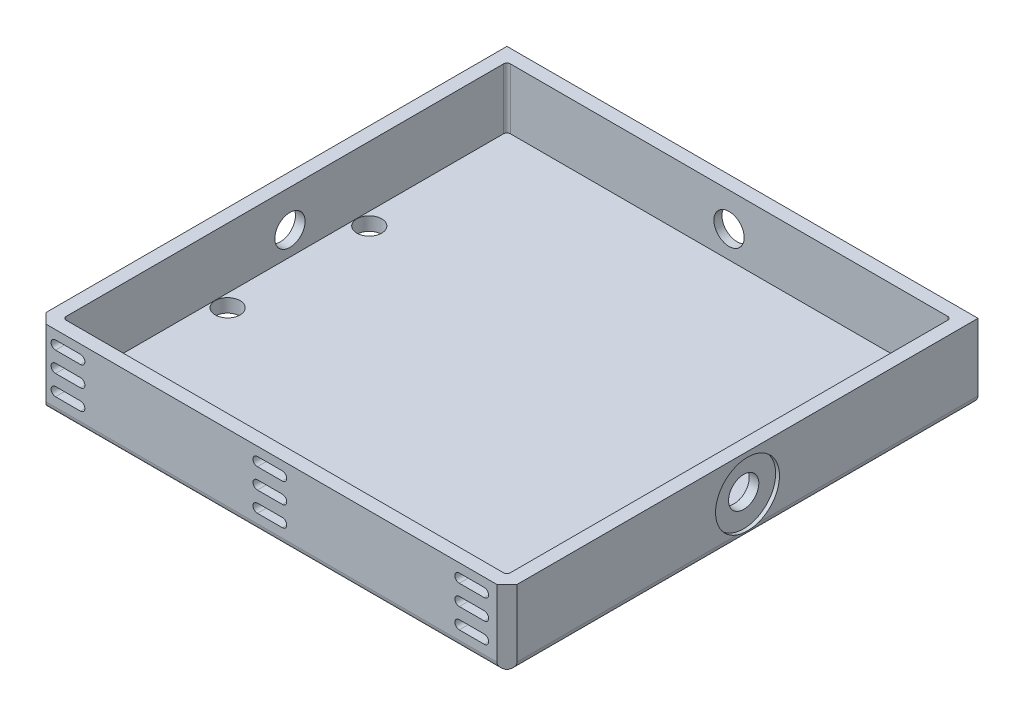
ISO-10303-21;
HEADER;
FILE_DESCRIPTION(('STEP AP214'),'2;1');
FILE_NAME('part.step','',(''),(''),'','','');
FILE_SCHEMA(('AUTOMOTIVE_DESIGN { 1 0 10303 214 1 1 1 1 }'));
ENDSEC;
DATA;
#1=APPLICATION_CONTEXT('core data for automotive mechanical design processes');
#2=APPLICATION_PROTOCOL_DEFINITION('international standard','automotive_design',2000,#1);
#3=PRODUCT_CONTEXT('',#1,'mechanical');
#4=PRODUCT('Part','Part','',(#3));
#5=PRODUCT_RELATED_PRODUCT_CATEGORY('part','',(#4));
#6=PRODUCT_DEFINITION_FORMATION('','',#4);
#7=PRODUCT_DEFINITION_CONTEXT('part definition',#1,'design');
#8=PRODUCT_DEFINITION('design','',#6,#7);
#9=PRODUCT_DEFINITION_SHAPE('','',#8);
#10=(LENGTH_UNIT() NAMED_UNIT(*) SI_UNIT(.MILLI.,.METRE.));
#11=(NAMED_UNIT(*) PLANE_ANGLE_UNIT() SI_UNIT($,.RADIAN.));
#12=(NAMED_UNIT(*) SI_UNIT($,.STERADIAN.) SOLID_ANGLE_UNIT());
#13=UNCERTAINTY_MEASURE_WITH_UNIT(LENGTH_MEASURE(1.E-05),#10,'distance_accuracy_value','');
#14=(GEOMETRIC_REPRESENTATION_CONTEXT(3) GLOBAL_UNCERTAINTY_ASSIGNED_CONTEXT((#13)) GLOBAL_UNIT_ASSIGNED_CONTEXT((#10,
#11,#12)) REPRESENTATION_CONTEXT('',''));
#15=CARTESIAN_POINT('',(0.,0.,0.));
#16=DIRECTION('',(0.,0.,1.));
#17=DIRECTION('',(1.,0.,0.));
#18=AXIS2_PLACEMENT_3D('',#15,#16,#17);
#19=CARTESIAN_POINT('',(0.00285583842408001,15.239999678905,-156.555538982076));
#20=DIRECTION('',(0.,0.,-1.));
#21=DIRECTION('',(-1.,0.,0.));
#22=AXIS2_PLACEMENT_3D('',#19,#20,#21);
#23=CYLINDRICAL_SURFACE('',#22,5.715);
#24=CARTESIAN_POINT('',(0.00285583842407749,15.239999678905,-172.72));
#25=DIRECTION('',(0.,0.,1.));
#26=DIRECTION('',(1.,0.,0.));
#27=AXIS2_PLACEMENT_3D('',#24,#25,#26);
#28=CIRCLE('',#27,5.715);
#29=CARTESIAN_POINT('',(5.71785583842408,15.239999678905,-172.72));
#30=VERTEX_POINT('',#29);
#31=EDGE_CURVE('E467',#30,#30,#28,.F.);
#32=ORIENTED_EDGE('',*,*,#31,.F.);
#33=EDGE_LOOP('',(#32));
#34=FACE_BOUND('',#33,.T.);
#35=CARTESIAN_POINT('',(0.00285583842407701,15.239999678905,-175.768));
#36=DIRECTION('',(0.,0.,-1.));
#37=DIRECTION('',(-1.,0.,0.));
#38=AXIS2_PLACEMENT_3D('',#35,#36,#37);
#39=CIRCLE('',#38,5.715);
#40=CARTESIAN_POINT('',(-5.71214416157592,15.239999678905,-175.768));
#41=VERTEX_POINT('',#40);
#42=EDGE_CURVE('E909',#41,#41,#39,.F.);
#43=ORIENTED_EDGE('',*,*,#42,.F.);
#44=EDGE_LOOP('',(#43));
#45=FACE_BOUND('',#44,.T.);
#46=ADVANCED_FACE('F55',(#34,#45),#23,.F.);
#47=CARTESIAN_POINT('',(-88.9,13.97,-90.805));
#48=DIRECTION('',(1.,0.,0.));
#49=DIRECTION('',(0.,0.,-1.));
#50=AXIS2_PLACEMENT_3D('',#47,#48,#49);
#51=CYLINDRICAL_SURFACE('',#50,5.71499999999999);
#52=CARTESIAN_POINT('',(-83.82,13.97,-90.805));
#53=DIRECTION('',(1.,0.,0.));
#54=DIRECTION('',(0.,0.,-1.));
#55=AXIS2_PLACEMENT_3D('',#52,#53,#54);
#56=CIRCLE('',#55,5.71499999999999);
#57=CARTESIAN_POINT('',(-83.82,13.97,-96.52));
#58=VERTEX_POINT('',#57);
#59=EDGE_CURVE('E494',#58,#58,#56,.T.);
#60=ORIENTED_EDGE('',*,*,#59,.T.);
#61=EDGE_LOOP('',(#60));
#62=FACE_BOUND('',#61,.T.);
#63=CARTESIAN_POINT('',(-87.4522,13.97,-90.805));
#64=DIRECTION('',(-1.,0.,0.));
#65=DIRECTION('',(0.,0.,1.));
#66=AXIS2_PLACEMENT_3D('',#63,#64,#65);
#67=CIRCLE('',#66,5.71499999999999);
#68=CARTESIAN_POINT('',(-87.4522,13.97,-85.09));
#69=VERTEX_POINT('',#68);
#70=EDGE_CURVE('E543',#69,#69,#67,.F.);
#71=ORIENTED_EDGE('',*,*,#70,.F.);
#72=EDGE_LOOP('',(#71));
#73=FACE_BOUND('',#72,.T.);
#74=ADVANCED_FACE('F867',(#62,#73),#51,.F.);
#75=CARTESIAN_POINT('',(83.82,13.97,-90.805));
#76=DIRECTION('',(-1.,0.,0.));
#77=DIRECTION('',(0.,0.,1.));
#78=AXIS2_PLACEMENT_3D('',#75,#76,#77);
#79=CIRCLE('',#78,5.71499999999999);
#80=CARTESIAN_POINT('',(83.82,13.97,-85.09));
#81=VERTEX_POINT('',#80);
#82=EDGE_CURVE('E506',#81,#81,#79,.T.);
#83=ORIENTED_EDGE('',*,*,#82,.T.);
#84=EDGE_LOOP('',(#83));
#85=FACE_BOUND('',#84,.T.);
#86=CARTESIAN_POINT('',(87.4522,13.97,-90.805));
#87=DIRECTION('',(1.,0.,0.));
#88=DIRECTION('',(0.,0.,-1.));
#89=AXIS2_PLACEMENT_3D('',#86,#87,#88);
#90=CIRCLE('',#89,5.71499999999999);
#91=CARTESIAN_POINT('',(87.4522,13.97,-96.52));
#92=VERTEX_POINT('',#91);
#93=EDGE_CURVE('E529',#92,#92,#90,.F.);
#94=ORIENTED_EDGE('',*,*,#93,.F.);
#95=EDGE_LOOP('',(#94));
#96=FACE_BOUND('',#95,.T.);
#97=ADVANCED_FACE('F864',(#85,#96),#51,.F.);
#98=CARTESIAN_POINT('',(0.,27.94,0.));
#99=DIRECTION('',(0.,1.,0.));
#100=DIRECTION('',(0.,0.,1.));
#101=AXIS2_PLACEMENT_3D('',#98,#99,#100);
#102=PLANE('',#101);
#103=DIRECTION('',(1.,0.,0.));
#104=VECTOR('',#103,1.);
#105=CARTESIAN_POINT('',(-88.9,27.94,0.));
#106=LINE('',#105,#104);
#107=CARTESIAN_POINT('',(-85.0899999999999,27.94,0.));
#108=VERTEX_POINT('',#107);
#109=CARTESIAN_POINT('',(85.09,27.94,0.));
#110=VERTEX_POINT('',#109);
#111=EDGE_CURVE('E1004',#108,#110,#106,.T.);
#112=ORIENTED_EDGE('',*,*,#111,.T.);
#113=DIRECTION('',(-0.707106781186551,0.,0.707106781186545));
#114=VECTOR('',#113,1.);
#115=CARTESIAN_POINT('',(42.5449999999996,27.94,42.545));
#116=LINE('',#115,#114);
#117=CARTESIAN_POINT('',(88.9,27.94,-3.81000000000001));
#118=VERTEX_POINT('',#117);
#119=EDGE_CURVE('E969',#110,#118,#116,.F.);
#120=ORIENTED_EDGE('',*,*,#119,.T.);
#121=DIRECTION('',(0.,0.,-1.));
#122=VECTOR('',#121,1.);
#123=CARTESIAN_POINT('',(88.8999999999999,27.94,-177.8));
#124=LINE('',#123,#122);
#125=CARTESIAN_POINT('',(88.8999999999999,27.94,-177.8));
#126=VERTEX_POINT('',#125);
#127=EDGE_CURVE('E1001',#118,#126,#124,.T.);
#128=ORIENTED_EDGE('',*,*,#127,.T.);
#129=DIRECTION('',(-1.,0.,0.));
#130=VECTOR('',#129,1.);
#131=CARTESIAN_POINT('',(-88.9,27.94,-177.8));
#132=LINE('',#131,#130);
#133=CARTESIAN_POINT('',(-88.9,27.94,-177.8));
#134=VERTEX_POINT('',#133);
#135=EDGE_CURVE('E998',#126,#134,#132,.T.);
#136=ORIENTED_EDGE('',*,*,#135,.T.);
#137=DIRECTION('',(0.,0.,1.));
#138=VECTOR('',#137,1.);
#139=CARTESIAN_POINT('',(-88.9,27.94,-177.8));
#140=LINE('',#139,#138);
#141=CARTESIAN_POINT('',(-88.9,27.94,-3.81000000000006));
#142=VERTEX_POINT('',#141);
#143=EDGE_CURVE('E1008',#134,#142,#140,.T.);
#144=ORIENTED_EDGE('',*,*,#143,.T.);
#145=DIRECTION('',(-0.707106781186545,0.,-0.70710678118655));
#146=VECTOR('',#145,1.);
#147=CARTESIAN_POINT('',(-42.5450000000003,27.94,42.545));
#148=LINE('',#147,#146);
#149=EDGE_CURVE('E974',#142,#108,#148,.F.);
#150=ORIENTED_EDGE('',*,*,#149,.T.);
#151=EDGE_LOOP('',(#112,#120,#128,#136,#144,#150));
#152=FACE_BOUND('',#151,.T.);
#153=DIRECTION('',(1.,0.,0.));
#154=VECTOR('',#153,1.);
#155=CARTESIAN_POINT('',(-83.82,27.94,-5.08));
#156=LINE('',#155,#154);
#157=CARTESIAN_POINT('',(-82.55,27.94,-5.08));
#158=VERTEX_POINT('',#157);
#159=CARTESIAN_POINT('',(82.55,27.94,-5.08));
#160=VERTEX_POINT('',#159);
#161=EDGE_CURVE('E1019',#158,#160,#156,.T.);
#162=ORIENTED_EDGE('',*,*,#161,.F.);
#163=CARTESIAN_POINT('',(-82.55,27.94,-6.34999999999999));
#164=DIRECTION('',(0.,1.,0.));
#165=DIRECTION('',(0.,0.,1.));
#166=AXIS2_PLACEMENT_3D('',#163,#164,#165);
#167=CIRCLE('',#166,1.27);
#168=CARTESIAN_POINT('',(-83.82,27.94,-6.34999999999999));
#169=VERTEX_POINT('',#168);
#170=EDGE_CURVE('E755',#158,#169,#167,.F.);
#171=ORIENTED_EDGE('',*,*,#170,.T.);
#172=DIRECTION('',(0.,0.,1.));
#173=VECTOR('',#172,1.);
#174=CARTESIAN_POINT('',(-83.82,27.94,-172.72));
#175=LINE('',#174,#173);
#176=CARTESIAN_POINT('',(-83.82,27.94,-171.45));
#177=VERTEX_POINT('',#176);
#178=EDGE_CURVE('E1023',#177,#169,#175,.T.);
#179=ORIENTED_EDGE('',*,*,#178,.F.);
#180=CARTESIAN_POINT('',(-82.55,27.94,-171.45));
#181=DIRECTION('',(0.,1.,0.));
#182=DIRECTION('',(0.,0.,1.));
#183=AXIS2_PLACEMENT_3D('',#180,#181,#182);
#184=CIRCLE('',#183,1.27);
#185=CARTESIAN_POINT('',(-82.55,27.94,-172.72));
#186=VERTEX_POINT('',#185);
#187=EDGE_CURVE('E752',#177,#186,#184,.F.);
#188=ORIENTED_EDGE('',*,*,#187,.T.);
#189=DIRECTION('',(-1.,0.,0.));
#190=VECTOR('',#189,1.);
#191=CARTESIAN_POINT('',(-83.82,27.94,-172.72));
#192=LINE('',#191,#190);
#193=CARTESIAN_POINT('',(82.55,27.94,-172.72));
#194=VERTEX_POINT('',#193);
#195=EDGE_CURVE('E1012',#194,#186,#192,.T.);
#196=ORIENTED_EDGE('',*,*,#195,.F.);
#197=CARTESIAN_POINT('',(82.55,27.94,-171.45));
#198=DIRECTION('',(0.,1.,0.));
#199=DIRECTION('',(0.,0.,1.));
#200=AXIS2_PLACEMENT_3D('',#197,#198,#199);
#201=CIRCLE('',#200,1.27);
#202=CARTESIAN_POINT('',(83.82,27.94,-171.45));
#203=VERTEX_POINT('',#202);
#204=EDGE_CURVE('E11',#194,#203,#201,.F.);
#205=ORIENTED_EDGE('',*,*,#204,.T.);
#206=DIRECTION('',(0.,0.,-1.));
#207=VECTOR('',#206,1.);
#208=CARTESIAN_POINT('',(83.82,27.94,-172.72));
#209=LINE('',#208,#207);
#210=CARTESIAN_POINT('',(83.82,27.94,-6.34999999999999));
#211=VERTEX_POINT('',#210);
#212=EDGE_CURVE('E1016',#211,#203,#209,.T.);
#213=ORIENTED_EDGE('',*,*,#212,.F.);
#214=CARTESIAN_POINT('',(82.55,27.94,-6.35));
#215=DIRECTION('',(0.,1.,0.));
#216=DIRECTION('',(0.,0.,1.));
#217=AXIS2_PLACEMENT_3D('',#214,#215,#216);
#218=CIRCLE('',#217,1.27);
#219=EDGE_CURVE('E71',#211,#160,#218,.F.);
#220=ORIENTED_EDGE('',*,*,#219,.T.);
#221=EDGE_LOOP('',(#162,#171,#179,#188,#196,#205,#213,#220));
#222=FACE_BOUND('',#221,.T.);
#223=ADVANCED_FACE('F676',(#152,#222),#102,.T.);
#224=CARTESIAN_POINT('',(0.,0.,0.));
#225=DIRECTION('',(0.,1.,0.));
#226=DIRECTION('',(0.,0.,1.));
#227=AXIS2_PLACEMENT_3D('',#224,#225,#226);
#228=PLANE('',#227);
#229=CARTESIAN_POINT('',(-79.022779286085,0.,-62.4874348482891));
#230=DIRECTION('',(0.,-1.,0.));
#231=DIRECTION('',(0.,0.,-1.));
#232=AXIS2_PLACEMENT_3D('',#229,#230,#231);
#233=CIRCLE('',#232,4.69899999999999);
#234=CARTESIAN_POINT('',(-79.022779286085,0.,-67.1864348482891));
#235=VERTEX_POINT('',#234);
#236=EDGE_CURVE('E533',#235,#235,#233,.T.);
#237=ORIENTED_EDGE('',*,*,#236,.F.);
#238=EDGE_LOOP('',(#237));
#239=FACE_BOUND('',#238,.T.);
#240=CARTESIAN_POINT('',(-79.022779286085,0.,-115.963111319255));
#241=DIRECTION('',(0.,-1.,0.));
#242=DIRECTION('',(0.,0.,-1.));
#243=AXIS2_PLACEMENT_3D('',#240,#241,#242);
#244=CIRCLE('',#243,4.69899999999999);
#245=CARTESIAN_POINT('',(-79.022779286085,0.,-120.662111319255));
#246=VERTEX_POINT('',#245);
#247=EDGE_CURVE('E1448',#246,#246,#244,.T.);
#248=ORIENTED_EDGE('',*,*,#247,.F.);
#249=EDGE_LOOP('',(#248));
#250=FACE_BOUND('',#249,.T.);
#251=CARTESIAN_POINT('',(78.8208898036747,0.,-115.963111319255));
#252=DIRECTION('',(0.,-1.,0.));
#253=DIRECTION('',(0.,0.,-1.));
#254=AXIS2_PLACEMENT_3D('',#251,#252,#253);
#255=CIRCLE('',#254,4.69899999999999);
#256=CARTESIAN_POINT('',(78.8208898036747,0.,-120.662111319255));
#257=VERTEX_POINT('',#256);
#258=EDGE_CURVE('E1444',#257,#257,#255,.T.);
#259=ORIENTED_EDGE('',*,*,#258,.F.);
#260=EDGE_LOOP('',(#259));
#261=FACE_BOUND('',#260,.T.);
#262=CARTESIAN_POINT('',(78.8208898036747,0.,-62.4874348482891));
#263=DIRECTION('',(0.,-1.,0.));
#264=DIRECTION('',(0.,0.,-1.));
#265=AXIS2_PLACEMENT_3D('',#262,#263,#264);
#266=CIRCLE('',#265,4.69899999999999);
#267=CARTESIAN_POINT('',(78.8208898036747,0.,-67.1864348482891));
#268=VERTEX_POINT('',#267);
#269=EDGE_CURVE('E516',#268,#268,#266,.T.);
#270=ORIENTED_EDGE('',*,*,#269,.F.);
#271=EDGE_LOOP('',(#270));
#272=FACE_BOUND('',#271,.T.);
#273=DIRECTION('',(0.,0.,-1.));
#274=VECTOR('',#273,1.);
#275=CARTESIAN_POINT('',(86.36,0.,0.));
#276=LINE('',#275,#274);
#277=CARTESIAN_POINT('',(86.36,0.,-175.26));
#278=VERTEX_POINT('',#277);
#279=CARTESIAN_POINT('',(86.36,0.,-2.54000000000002));
#280=VERTEX_POINT('',#279);
#281=EDGE_CURVE('E931',#278,#280,#276,.F.);
#282=ORIENTED_EDGE('',*,*,#281,.T.);
#283=DIRECTION('',(1.,0.,0.));
#284=VECTOR('',#283,1.);
#285=CARTESIAN_POINT('',(0.,0.,-2.54000000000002));
#286=LINE('',#285,#284);
#287=CARTESIAN_POINT('',(-86.36,0.,-2.54));
#288=VERTEX_POINT('',#287);
#289=EDGE_CURVE('E950',#280,#288,#286,.F.);
#290=ORIENTED_EDGE('',*,*,#289,.T.);
#291=DIRECTION('',(0.,0.,1.));
#292=VECTOR('',#291,1.);
#293=CARTESIAN_POINT('',(-86.36,0.,0.));
#294=LINE('',#293,#292);
#295=CARTESIAN_POINT('',(-86.36,0.,-175.26));
#296=VERTEX_POINT('',#295);
#297=EDGE_CURVE('E942',#288,#296,#294,.F.);
#298=ORIENTED_EDGE('',*,*,#297,.T.);
#299=DIRECTION('',(-1.,0.,0.));
#300=VECTOR('',#299,1.);
#301=CARTESIAN_POINT('',(0.,0.,-175.26));
#302=LINE('',#301,#300);
#303=EDGE_CURVE('E927',#296,#278,#302,.F.);
#304=ORIENTED_EDGE('',*,*,#303,.T.);
#305=EDGE_LOOP('',(#282,#290,#298,#304));
#306=FACE_BOUND('',#305,.T.);
#307=ADVANCED_FACE('F1650',(#239,#250,#261,#272,#306),#228,.F.);
#308=CARTESIAN_POINT('',(-88.9,27.94,-177.8));
#309=DIRECTION('',(1.,0.,0.));
#310=DIRECTION('',(0.,0.,-1.));
#311=AXIS2_PLACEMENT_3D('',#308,#309,#310);
#312=PLANE('',#311);
#313=DIRECTION('',(0.,0.,1.));
#314=VECTOR('',#313,1.);
#315=CARTESIAN_POINT('',(-88.9,2.54,-177.8));
#316=LINE('',#315,#314);
#317=CARTESIAN_POINT('',(-88.9,2.54,-177.8));
#318=VERTEX_POINT('',#317);
#319=CARTESIAN_POINT('',(-88.9,2.54,-95.0476364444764));
#320=VERTEX_POINT('',#319);
#321=EDGE_CURVE('E464',#318,#320,#316,.T.);
#322=ORIENTED_EDGE('',*,*,#321,.T.);
#323=CARTESIAN_POINT('',(-88.9,13.97,-90.805));
#324=DIRECTION('',(-1.,0.,0.));
#325=DIRECTION('',(0.,0.,1.));
#326=AXIS2_PLACEMENT_3D('',#323,#324,#325);
#327=CIRCLE('',#326,12.192);
#328=CARTESIAN_POINT('',(-88.9,2.54,-86.5623635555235));
#329=VERTEX_POINT('',#328);
#330=EDGE_CURVE('E450',#329,#320,#327,.T.);
#331=ORIENTED_EDGE('',*,*,#330,.F.);
#332=CARTESIAN_POINT('',(-88.9,2.54,-3.81000000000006));
#333=VERTEX_POINT('',#332);
#334=EDGE_CURVE('E461',#329,#333,#316,.T.);
#335=ORIENTED_EDGE('',*,*,#334,.T.);
#336=DIRECTION('',(0.,1.,0.));
#337=VECTOR('',#336,1.);
#338=CARTESIAN_POINT('',(-88.9,27.94,-3.81000000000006));
#339=LINE('',#338,#337);
#340=EDGE_CURVE('E957',#333,#142,#339,.T.);
#341=ORIENTED_EDGE('',*,*,#340,.T.);
#342=ORIENTED_EDGE('',*,*,#143,.F.);
#343=DIRECTION('',(0.,-1.,0.));
#344=VECTOR('',#343,1.);
#345=CARTESIAN_POINT('',(-88.9,27.94,-177.8));
#346=LINE('',#345,#344);
#347=EDGE_CURVE('E995',#134,#318,#346,.T.);
#348=ORIENTED_EDGE('',*,*,#347,.T.);
#349=EDGE_LOOP('',(#322,#331,#335,#341,#342,#348));
#350=FACE_BOUND('',#349,.T.);
#351=ADVANCED_FACE('F460',(#350),#312,.F.);
#352=CARTESIAN_POINT('',(-88.9,27.94,0.));
#353=DIRECTION('',(0.,0.,-1.));
#354=DIRECTION('',(-1.,0.,0.));
#355=AXIS2_PLACEMENT_3D('',#352,#353,#354);
#356=PLANE('',#355);
#357=CARTESIAN_POINT('',(4.11414891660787,7.6735141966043,0.));
#358=DIRECTION('',(0.,0.,1.));
#359=DIRECTION('',(1.,0.,0.));
#360=AXIS2_PLACEMENT_3D('',#357,#358,#359);
#361=CIRCLE('',#360,1.66894804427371);
#362=CARTESIAN_POINT('',(4.11414891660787,6.00456615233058,0.));
#363=VERTEX_POINT('',#362);
#364=CARTESIAN_POINT('',(4.11414891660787,9.34246224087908,0.));
#365=VERTEX_POINT('',#364);
#366=EDGE_CURVE('E1224',#363,#365,#361,.T.);
#367=ORIENTED_EDGE('',*,*,#366,.F.);
#368=DIRECTION('',(1.,0.,0.));
#369=VECTOR('',#368,1.);
#370=CARTESIAN_POINT('',(-5.29264915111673,6.00456615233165,0.));
#371=LINE('',#370,#369);
#372=CARTESIAN_POINT('',(-5.29264915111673,6.00456615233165,0.));
#373=VERTEX_POINT('',#372);
#374=EDGE_CURVE('E1229',#373,#363,#371,.T.);
#375=ORIENTED_EDGE('',*,*,#374,.F.);
#376=CARTESIAN_POINT('',(-5.29264915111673,7.6735141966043,0.));
#377=DIRECTION('',(0.,0.,1.));
#378=DIRECTION('',(1.,0.,0.));
#379=AXIS2_PLACEMENT_3D('',#376,#377,#378);
#380=CIRCLE('',#379,1.66894804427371);
#381=CARTESIAN_POINT('',(-5.29264915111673,9.34246224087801,0.));
#382=VERTEX_POINT('',#381);
#383=EDGE_CURVE('E1077',#382,#373,#380,.T.);
#384=ORIENTED_EDGE('',*,*,#383,.F.);
#385=DIRECTION('',(-1.,0.,0.));
#386=VECTOR('',#385,1.);
#387=CARTESIAN_POINT('',(-5.29264915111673,9.34246224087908,0.));
#388=LINE('',#387,#386);
#389=EDGE_CURVE('E1221',#365,#382,#388,.T.);
#390=ORIENTED_EDGE('',*,*,#389,.F.);
#391=EDGE_LOOP('',(#367,#375,#384,#390));
#392=FACE_BOUND('',#391,.T.);
#393=CARTESIAN_POINT('',(80.3141489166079,7.67351419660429,0.));
#394=DIRECTION('',(0.,0.,1.));
#395=DIRECTION('',(1.,0.,0.));
#396=AXIS2_PLACEMENT_3D('',#393,#394,#395);
#397=CIRCLE('',#396,1.66894804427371);
#398=CARTESIAN_POINT('',(80.3141489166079,6.00456615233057,0.));
#399=VERTEX_POINT('',#398);
#400=CARTESIAN_POINT('',(80.3141489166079,9.34246224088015,0.));
#401=VERTEX_POINT('',#400);
#402=EDGE_CURVE('E1180',#399,#401,#397,.T.);
#403=ORIENTED_EDGE('',*,*,#402,.F.);
#404=DIRECTION('',(1.,0.,0.));
#405=VECTOR('',#404,1.);
#406=CARTESIAN_POINT('',(70.9073508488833,6.00456615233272,0.));
#407=LINE('',#406,#405);
#408=CARTESIAN_POINT('',(70.9073508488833,6.00456615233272,0.));
#409=VERTEX_POINT('',#408);
#410=EDGE_CURVE('E1185',#409,#399,#407,.T.);
#411=ORIENTED_EDGE('',*,*,#410,.F.);
#412=CARTESIAN_POINT('',(70.9073508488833,7.67351419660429,0.));
#413=DIRECTION('',(0.,0.,1.));
#414=DIRECTION('',(1.,0.,0.));
#415=AXIS2_PLACEMENT_3D('',#412,#413,#414);
#416=CIRCLE('',#415,1.66894804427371);
#417=CARTESIAN_POINT('',(70.9073508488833,9.342462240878,0.));
#418=VERTEX_POINT('',#417);
#419=EDGE_CURVE('E1189',#418,#409,#416,.T.);
#420=ORIENTED_EDGE('',*,*,#419,.F.);
#421=DIRECTION('',(-1.,0.,0.));
#422=VECTOR('',#421,1.);
#423=CARTESIAN_POINT('',(70.9073508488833,9.34246224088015,0.));
#424=LINE('',#423,#422);
#425=EDGE_CURVE('E1177',#401,#418,#424,.T.);
#426=ORIENTED_EDGE('',*,*,#425,.F.);
#427=EDGE_LOOP('',(#403,#411,#420,#426));
#428=FACE_BOUND('',#427,.T.);
#429=CARTESIAN_POINT('',(4.11414891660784,15.2935141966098,0.));
#430=DIRECTION('',(0.,0.,1.));
#431=DIRECTION('',(1.,0.,0.));
#432=AXIS2_PLACEMENT_3D('',#429,#430,#431);
#433=CIRCLE('',#432,1.66894804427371);
#434=CARTESIAN_POINT('',(4.11414891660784,13.6245661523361,0.));
#435=VERTEX_POINT('',#434);
#436=CARTESIAN_POINT('',(4.11414891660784,16.9624622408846,0.));
#437=VERTEX_POINT('',#436);
#438=EDGE_CURVE('E1136',#435,#437,#433,.T.);
#439=ORIENTED_EDGE('',*,*,#438,.F.);
#440=DIRECTION('',(1.,0.,0.));
#441=VECTOR('',#440,1.);
#442=CARTESIAN_POINT('',(-5.29264915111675,13.6245661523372,0.));
#443=LINE('',#442,#441);
#444=CARTESIAN_POINT('',(-5.29264915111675,13.6245661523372,0.));
#445=VERTEX_POINT('',#444);
#446=EDGE_CURVE('E1141',#445,#435,#443,.T.);
#447=ORIENTED_EDGE('',*,*,#446,.F.);
#448=CARTESIAN_POINT('',(-5.29264915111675,15.2935141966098,0.));
#449=DIRECTION('',(0.,0.,1.));
#450=DIRECTION('',(1.,0.,0.));
#451=AXIS2_PLACEMENT_3D('',#448,#449,#450);
#452=CIRCLE('',#451,1.66894804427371);
#453=CARTESIAN_POINT('',(-5.29264915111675,16.9624622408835,0.));
#454=VERTEX_POINT('',#453);
#455=EDGE_CURVE('E1145',#454,#445,#452,.T.);
#456=ORIENTED_EDGE('',*,*,#455,.F.);
#457=DIRECTION('',(-1.,0.,0.));
#458=VECTOR('',#457,1.);
#459=CARTESIAN_POINT('',(-5.29264915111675,16.9624622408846,0.));
#460=LINE('',#459,#458);
#461=EDGE_CURVE('E1133',#437,#454,#460,.T.);
#462=ORIENTED_EDGE('',*,*,#461,.F.);
#463=EDGE_LOOP('',(#439,#447,#456,#462));
#464=FACE_BOUND('',#463,.T.);
#465=CARTESIAN_POINT('',(80.3141489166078,15.2935141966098,0.));
#466=DIRECTION('',(0.,0.,1.));
#467=DIRECTION('',(1.,0.,0.));
#468=AXIS2_PLACEMENT_3D('',#465,#466,#467);
#469=CIRCLE('',#468,1.66894804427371);
#470=CARTESIAN_POINT('',(80.3141489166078,13.6245661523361,0.));
#471=VERTEX_POINT('',#470);
#472=CARTESIAN_POINT('',(80.3141489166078,16.9624622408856,0.));
#473=VERTEX_POINT('',#472);
#474=EDGE_CURVE('E1090',#471,#473,#469,.T.);
#475=ORIENTED_EDGE('',*,*,#474,.F.);
#476=DIRECTION('',(1.,0.,0.));
#477=VECTOR('',#476,1.);
#478=CARTESIAN_POINT('',(70.9073508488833,13.6245661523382,0.));
#479=LINE('',#478,#477);
#480=CARTESIAN_POINT('',(70.9073508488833,13.6245661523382,0.));
#481=VERTEX_POINT('',#480);
#482=EDGE_CURVE('E1095',#481,#471,#479,.T.);
#483=ORIENTED_EDGE('',*,*,#482,.F.);
#484=CARTESIAN_POINT('',(70.9073508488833,15.2935141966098,0.));
#485=DIRECTION('',(0.,0.,1.));
#486=DIRECTION('',(1.,0.,0.));
#487=AXIS2_PLACEMENT_3D('',#484,#485,#486);
#488=CIRCLE('',#487,1.66894804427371);
#489=CARTESIAN_POINT('',(70.9073508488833,16.9624622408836,0.));
#490=VERTEX_POINT('',#489);
#491=EDGE_CURVE('E1099',#490,#481,#488,.T.);
#492=ORIENTED_EDGE('',*,*,#491,.F.);
#493=DIRECTION('',(-1.,0.,0.));
#494=VECTOR('',#493,1.);
#495=CARTESIAN_POINT('',(70.9073508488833,16.9624622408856,0.));
#496=LINE('',#495,#494);
#497=EDGE_CURVE('E1087',#473,#490,#496,.T.);
#498=ORIENTED_EDGE('',*,*,#497,.F.);
#499=EDGE_LOOP('',(#475,#483,#492,#498));
#500=FACE_BOUND('',#499,.T.);
#501=CARTESIAN_POINT('',(4.11414891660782,22.9135141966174,0.));
#502=DIRECTION('',(0.,0.,1.));
#503=DIRECTION('',(1.,0.,0.));
#504=AXIS2_PLACEMENT_3D('',#501,#502,#503);
#505=CIRCLE('',#504,1.66894804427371);
#506=CARTESIAN_POINT('',(4.11414891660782,21.2445661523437,0.));
#507=VERTEX_POINT('',#506);
#508=CARTESIAN_POINT('',(4.11414891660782,24.5824622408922,0.));
#509=VERTEX_POINT('',#508);
#510=EDGE_CURVE('E1402',#507,#509,#505,.T.);
#511=ORIENTED_EDGE('',*,*,#510,.F.);
#512=DIRECTION('',(1.,0.,0.));
#513=VECTOR('',#512,1.);
#514=CARTESIAN_POINT('',(-5.29264915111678,21.2445661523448,0.));
#515=LINE('',#514,#513);
#516=CARTESIAN_POINT('',(-5.29264915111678,21.2445661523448,0.));
#517=VERTEX_POINT('',#516);
#518=EDGE_CURVE('E1407',#517,#507,#515,.T.);
#519=ORIENTED_EDGE('',*,*,#518,.F.);
#520=CARTESIAN_POINT('',(-5.29264915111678,22.9135141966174,0.));
#521=DIRECTION('',(0.,0.,1.));
#522=DIRECTION('',(1.,0.,0.));
#523=AXIS2_PLACEMENT_3D('',#520,#521,#522);
#524=CIRCLE('',#523,1.66894804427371);
#525=CARTESIAN_POINT('',(-5.29264915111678,24.5824622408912,0.));
#526=VERTEX_POINT('',#525);
#527=EDGE_CURVE('E1132',#526,#517,#524,.T.);
#528=ORIENTED_EDGE('',*,*,#527,.F.);
#529=DIRECTION('',(-1.,0.,0.));
#530=VECTOR('',#529,1.);
#531=CARTESIAN_POINT('',(-5.29264915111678,24.5824622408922,0.));
#532=LINE('',#531,#530);
#533=EDGE_CURVE('E1399',#509,#526,#532,.T.);
#534=ORIENTED_EDGE('',*,*,#533,.F.);
#535=EDGE_LOOP('',(#511,#519,#528,#534));
#536=FACE_BOUND('',#535,.T.);
#537=CARTESIAN_POINT('',(80.3141489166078,22.9135141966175,0.));
#538=DIRECTION('',(0.,0.,1.));
#539=DIRECTION('',(1.,0.,0.));
#540=AXIS2_PLACEMENT_3D('',#537,#538,#539);
#541=CIRCLE('',#540,1.66894804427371);
#542=CARTESIAN_POINT('',(80.3141489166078,21.2445661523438,0.));
#543=VERTEX_POINT('',#542);
#544=CARTESIAN_POINT('',(80.3141489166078,24.5824622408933,0.));
#545=VERTEX_POINT('',#544);
#546=EDGE_CURVE('E1358',#543,#545,#541,.T.);
#547=ORIENTED_EDGE('',*,*,#546,.F.);
#548=DIRECTION('',(1.,0.,0.));
#549=VECTOR('',#548,1.);
#550=CARTESIAN_POINT('',(70.9073508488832,21.2445661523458,0.));
#551=LINE('',#550,#549);
#552=CARTESIAN_POINT('',(70.9073508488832,21.2445661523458,0.));
#553=VERTEX_POINT('',#552);
#554=EDGE_CURVE('E1363',#553,#543,#551,.T.);
#555=ORIENTED_EDGE('',*,*,#554,.F.);
#556=CARTESIAN_POINT('',(70.9073508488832,22.9135141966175,0.));
#557=DIRECTION('',(0.,0.,1.));
#558=DIRECTION('',(1.,0.,0.));
#559=AXIS2_PLACEMENT_3D('',#556,#557,#558);
#560=CIRCLE('',#559,1.66894804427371);
#561=CARTESIAN_POINT('',(70.9073508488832,24.5824622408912,0.));
#562=VERTEX_POINT('',#561);
#563=EDGE_CURVE('E1367',#562,#553,#560,.T.);
#564=ORIENTED_EDGE('',*,*,#563,.F.);
#565=DIRECTION('',(-1.,0.,0.));
#566=VECTOR('',#565,1.);
#567=CARTESIAN_POINT('',(70.9073508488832,24.5824622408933,0.));
#568=LINE('',#567,#566);
#569=EDGE_CURVE('E1355',#545,#562,#568,.T.);
#570=ORIENTED_EDGE('',*,*,#569,.F.);
#571=EDGE_LOOP('',(#547,#555,#564,#570));
#572=FACE_BOUND('',#571,.T.);
#573=CARTESIAN_POINT('',(-72.0858510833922,15.2935141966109,0.));
#574=DIRECTION('',(0.,0.,1.));
#575=DIRECTION('',(1.,0.,0.));
#576=AXIS2_PLACEMENT_3D('',#573,#574,#575);
#577=CIRCLE('',#576,1.66894804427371);
#578=CARTESIAN_POINT('',(-72.0858510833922,13.6245661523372,0.));
#579=VERTEX_POINT('',#578);
#580=CARTESIAN_POINT('',(-72.0858510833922,16.9624622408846,0.));
#581=VERTEX_POINT('',#580);
#582=EDGE_CURVE('E1312',#579,#581,#577,.T.);
#583=ORIENTED_EDGE('',*,*,#582,.F.);
#584=DIRECTION('',(1.,0.,0.));
#585=VECTOR('',#584,1.);
#586=CARTESIAN_POINT('',(-81.4926491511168,13.6245661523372,0.));
#587=LINE('',#586,#585);
#588=CARTESIAN_POINT('',(-81.4926491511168,13.6245661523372,0.));
#589=VERTEX_POINT('',#588);
#590=EDGE_CURVE('E1317',#589,#579,#587,.T.);
#591=ORIENTED_EDGE('',*,*,#590,.F.);
#592=CARTESIAN_POINT('',(-81.4926491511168,15.2935141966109,0.));
#593=DIRECTION('',(0.,0.,1.));
#594=DIRECTION('',(1.,0.,0.));
#595=AXIS2_PLACEMENT_3D('',#592,#593,#594);
#596=CIRCLE('',#595,1.66894804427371);
#597=CARTESIAN_POINT('',(-81.4926491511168,16.9624622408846,0.));
#598=VERTEX_POINT('',#597);
#599=EDGE_CURVE('E1321',#598,#589,#596,.T.);
#600=ORIENTED_EDGE('',*,*,#599,.F.);
#601=DIRECTION('',(-1.,0.,0.));
#602=VECTOR('',#601,1.);
#603=CARTESIAN_POINT('',(-81.4926491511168,16.9624622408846,0.));
#604=LINE('',#603,#602);
#605=EDGE_CURVE('E1309',#581,#598,#604,.T.);
#606=ORIENTED_EDGE('',*,*,#605,.F.);
#607=EDGE_LOOP('',(#583,#591,#600,#606));
#608=FACE_BOUND('',#607,.T.);
#609=CARTESIAN_POINT('',(-72.0858510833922,22.9135141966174,0.));
#610=DIRECTION('',(0.,0.,1.));
#611=DIRECTION('',(1.,0.,0.));
#612=AXIS2_PLACEMENT_3D('',#609,#610,#611);
#613=CIRCLE('',#612,1.66894804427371);
#614=CARTESIAN_POINT('',(-72.0858510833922,21.2445661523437,0.));
#615=VERTEX_POINT('',#614);
#616=CARTESIAN_POINT('',(-72.0858510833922,24.5824622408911,0.));
#617=VERTEX_POINT('',#616);
#618=EDGE_CURVE('E1266',#615,#617,#613,.T.);
#619=ORIENTED_EDGE('',*,*,#618,.F.);
#620=DIRECTION('',(1.,0.,0.));
#621=VECTOR('',#620,1.);
#622=CARTESIAN_POINT('',(-81.4926491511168,21.2445661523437,0.));
#623=LINE('',#622,#621);
#624=CARTESIAN_POINT('',(-81.4926491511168,21.2445661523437,0.));
#625=VERTEX_POINT('',#624);
#626=EDGE_CURVE('E1271',#625,#615,#623,.T.);
#627=ORIENTED_EDGE('',*,*,#626,.F.);
#628=CARTESIAN_POINT('',(-81.4926491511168,22.9135141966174,0.));
#629=DIRECTION('',(0.,0.,1.));
#630=DIRECTION('',(1.,0.,0.));
#631=AXIS2_PLACEMENT_3D('',#628,#629,#630);
#632=CIRCLE('',#631,1.66894804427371);
#633=CARTESIAN_POINT('',(-81.4926491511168,24.5824622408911,0.));
#634=VERTEX_POINT('',#633);
#635=EDGE_CURVE('E1275',#634,#625,#632,.T.);
#636=ORIENTED_EDGE('',*,*,#635,.F.);
#637=DIRECTION('',(-1.,0.,0.));
#638=VECTOR('',#637,1.);
#639=CARTESIAN_POINT('',(-81.4926491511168,24.5824622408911,0.));
#640=LINE('',#639,#638);
#641=EDGE_CURVE('E1263',#617,#634,#640,.T.);
#642=ORIENTED_EDGE('',*,*,#641,.F.);
#643=EDGE_LOOP('',(#619,#627,#636,#642));
#644=FACE_BOUND('',#643,.T.);
#645=CARTESIAN_POINT('',(-72.0858510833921,7.67351419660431,0.));
#646=DIRECTION('',(0.,0.,1.));
#647=DIRECTION('',(1.,0.,0.));
#648=AXIS2_PLACEMENT_3D('',#645,#646,#647);
#649=CIRCLE('',#648,1.66894804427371);
#650=CARTESIAN_POINT('',(-72.0858510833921,6.00456615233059,0.));
#651=VERTEX_POINT('',#650);
#652=CARTESIAN_POINT('',(-72.0858510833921,9.34246224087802,0.));
#653=VERTEX_POINT('',#652);
#654=EDGE_CURVE('E1081',#651,#653,#649,.T.);
#655=ORIENTED_EDGE('',*,*,#654,.F.);
#656=DIRECTION('',(1.,0.,0.));
#657=VECTOR('',#656,1.);
#658=CARTESIAN_POINT('',(-81.4926491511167,6.00456615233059,0.));
#659=LINE('',#658,#657);
#660=CARTESIAN_POINT('',(-81.4926491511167,6.00456615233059,0.));
#661=VERTEX_POINT('',#660);
#662=EDGE_CURVE('E1076',#661,#651,#659,.T.);
#663=ORIENTED_EDGE('',*,*,#662,.F.);
#664=CARTESIAN_POINT('',(-81.4926491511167,7.67351419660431,0.));
#665=DIRECTION('',(0.,0.,1.));
#666=DIRECTION('',(1.,0.,0.));
#667=AXIS2_PLACEMENT_3D('',#664,#665,#666);
#668=CIRCLE('',#667,1.66894804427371);
#669=CARTESIAN_POINT('',(-81.4926491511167,9.34246224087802,0.));
#670=VERTEX_POINT('',#669);
#671=EDGE_CURVE('E1072',#670,#661,#668,.T.);
#672=ORIENTED_EDGE('',*,*,#671,.F.);
#673=DIRECTION('',(-1.,0.,0.));
#674=VECTOR('',#673,1.);
#675=CARTESIAN_POINT('',(-81.4926491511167,9.34246224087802,0.));
#676=LINE('',#675,#674);
#677=EDGE_CURVE('E1071',#653,#670,#676,.T.);
#678=ORIENTED_EDGE('',*,*,#677,.F.);
#679=EDGE_LOOP('',(#655,#663,#672,#678));
#680=FACE_BOUND('',#679,.T.);
#681=DIRECTION('',(0.,-1.,0.));
#682=VECTOR('',#681,1.);
#683=CARTESIAN_POINT('',(-85.0899999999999,27.94,0.));
#684=LINE('',#683,#682);
#685=CARTESIAN_POINT('',(-85.0899999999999,2.54,0.));
#686=VERTEX_POINT('',#685);
#687=EDGE_CURVE('E980',#108,#686,#684,.T.);
#688=ORIENTED_EDGE('',*,*,#687,.T.);
#689=DIRECTION('',(1.,0.,0.));
#690=VECTOR('',#689,1.);
#691=CARTESIAN_POINT('',(-88.9,2.54,0.));
#692=LINE('',#691,#690);
#693=CARTESIAN_POINT('',(85.09,2.54,0.));
#694=VERTEX_POINT('',#693);
#695=EDGE_CURVE('E962',#686,#694,#692,.T.);
#696=ORIENTED_EDGE('',*,*,#695,.T.);
#697=DIRECTION('',(0.,1.,0.));
#698=VECTOR('',#697,1.);
#699=CARTESIAN_POINT('',(85.09,27.94,0.));
#700=LINE('',#699,#698);
#701=EDGE_CURVE('E977',#694,#110,#700,.T.);
#702=ORIENTED_EDGE('',*,*,#701,.T.);
#703=ORIENTED_EDGE('',*,*,#111,.F.);
#704=EDGE_LOOP('',(#688,#696,#702,#703));
#705=FACE_BOUND('',#704,.T.);
#706=ADVANCED_FACE('F1602',(#392,#428,#464,#500,#536,#572,#608,#644,#680,#705),#356,.F.);
#707=CARTESIAN_POINT('',(88.8999999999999,27.94,-177.8));
#708=DIRECTION('',(-1.,0.,0.));
#709=DIRECTION('',(0.,0.,1.));
#710=AXIS2_PLACEMENT_3D('',#707,#708,#709);
#711=PLANE('',#710);
#712=DIRECTION('',(0.,0.,-1.));
#713=VECTOR('',#712,1.);
#714=CARTESIAN_POINT('',(88.8999999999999,2.54,-177.8));
#715=LINE('',#714,#713);
#716=CARTESIAN_POINT('',(88.9,2.54,-3.81000000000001));
#717=VERTEX_POINT('',#716);
#718=CARTESIAN_POINT('',(88.9,2.54,-86.9424457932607));
#719=VERTEX_POINT('',#718);
#720=EDGE_CURVE('E485',#717,#719,#715,.T.);
#721=ORIENTED_EDGE('',*,*,#720,.T.);
#722=CARTESIAN_POINT('',(88.9,13.97,-90.805));
#723=DIRECTION('',(1.,0.,0.));
#724=DIRECTION('',(0.,0.,-1.));
#725=AXIS2_PLACEMENT_3D('',#722,#723,#724);
#726=CIRCLE('',#725,12.065);
#727=CARTESIAN_POINT('',(88.9,2.54,-94.6675542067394));
#728=VERTEX_POINT('',#727);
#729=EDGE_CURVE('E1455',#728,#719,#726,.T.);
#730=ORIENTED_EDGE('',*,*,#729,.F.);
#731=CARTESIAN_POINT('',(88.8999999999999,2.54,-177.8));
#732=VERTEX_POINT('',#731);
#733=EDGE_CURVE('E484',#728,#732,#715,.T.);
#734=ORIENTED_EDGE('',*,*,#733,.T.);
#735=DIRECTION('',(0.,-1.,0.));
#736=VECTOR('',#735,1.);
#737=CARTESIAN_POINT('',(88.8999999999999,27.94,-177.8));
#738=LINE('',#737,#736);
#739=EDGE_CURVE('E991',#126,#732,#738,.T.);
#740=ORIENTED_EDGE('',*,*,#739,.F.);
#741=ORIENTED_EDGE('',*,*,#127,.F.);
#742=DIRECTION('',(0.,-1.,0.));
#743=VECTOR('',#742,1.);
#744=CARTESIAN_POINT('',(88.9,27.94,-3.81000000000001));
#745=LINE('',#744,#743);
#746=EDGE_CURVE('E983',#118,#717,#745,.T.);
#747=ORIENTED_EDGE('',*,*,#746,.T.);
#748=EDGE_LOOP('',(#721,#730,#734,#740,#741,#747));
#749=FACE_BOUND('',#748,.T.);
#750=ADVANCED_FACE('F1496',(#749),#711,.F.);
#751=CARTESIAN_POINT('',(-88.9,27.94,-177.8));
#752=DIRECTION('',(0.,0.,1.));
#753=DIRECTION('',(1.,0.,0.));
#754=AXIS2_PLACEMENT_3D('',#751,#752,#753);
#755=PLANE('',#754);
#756=CARTESIAN_POINT('',(0.00285583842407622,15.239999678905,-177.8));
#757=DIRECTION('',(0.,0.,-1.));
#758=DIRECTION('',(-1.,0.,0.));
#759=AXIS2_PLACEMENT_3D('',#756,#757,#758);
#760=CIRCLE('',#759,12.065);
#761=CARTESIAN_POINT('',(-12.0621441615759,15.239999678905,-177.8));
#762=VERTEX_POINT('',#761);
#763=EDGE_CURVE('E1467',#762,#762,#760,.T.);
#764=ORIENTED_EDGE('',*,*,#763,.F.);
#765=EDGE_LOOP('',(#764));
#766=FACE_BOUND('',#765,.T.);
#767=ORIENTED_EDGE('',*,*,#739,.T.);
#768=DIRECTION('',(-1.,0.,0.));
#769=VECTOR('',#768,1.);
#770=CARTESIAN_POINT('',(-88.9,2.54,-177.8));
#771=LINE('',#770,#769);
#772=EDGE_CURVE('E478',#732,#318,#771,.T.);
#773=ORIENTED_EDGE('',*,*,#772,.T.);
#774=ORIENTED_EDGE('',*,*,#347,.F.);
#775=ORIENTED_EDGE('',*,*,#135,.F.);
#776=EDGE_LOOP('',(#767,#773,#774,#775));
#777=FACE_BOUND('',#776,.T.);
#778=ADVANCED_FACE('F674',(#766,#777),#755,.F.);
#779=CARTESIAN_POINT('',(-83.82,27.94,-172.72));
#780=DIRECTION('',(1.,0.,0.));
#781=DIRECTION('',(0.,0.,-1.));
#782=AXIS2_PLACEMENT_3D('',#779,#780,#781);
#783=PLANE('',#782);
#784=ORIENTED_EDGE('',*,*,#59,.F.);
#785=EDGE_LOOP('',(#784));
#786=FACE_BOUND('',#785,.T.);
#787=DIRECTION('',(0.,0.,1.));
#788=VECTOR('',#787,1.);
#789=CARTESIAN_POINT('',(-83.82,5.08,-172.72));
#790=LINE('',#789,#788);
#791=CARTESIAN_POINT('',(-83.82,5.08,-171.45));
#792=VERTEX_POINT('',#791);
#793=CARTESIAN_POINT('',(-83.82,5.08,-6.34999999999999));
#794=VERTEX_POINT('',#793);
#795=EDGE_CURVE('E1027',#792,#794,#790,.T.);
#796=ORIENTED_EDGE('',*,*,#795,.F.);
#797=DIRECTION('',(0.,-1.,0.));
#798=VECTOR('',#797,1.);
#799=CARTESIAN_POINT('',(-83.82,27.94,-171.45));
#800=LINE('',#799,#798);
#801=EDGE_CURVE('E727',#792,#177,#800,.F.);
#802=ORIENTED_EDGE('',*,*,#801,.T.);
#803=ORIENTED_EDGE('',*,*,#178,.T.);
#804=DIRECTION('',(0.,-1.,0.));
#805=VECTOR('',#804,1.);
#806=CARTESIAN_POINT('',(-83.82,5.08,-6.34999999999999));
#807=LINE('',#806,#805);
#808=CARTESIAN_POINT('',(-83.82,24.2047913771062,-6.34999999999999));
#809=VERTEX_POINT('',#808);
#810=EDGE_CURVE('E723',#169,#809,#807,.T.);
#811=ORIENTED_EDGE('',*,*,#810,.T.);
#812=CARTESIAN_POINT('',(-82.3444886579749,21.4783288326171,-5.08));
#813=CARTESIAN_POINT('',(-83.82,21.5451756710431,-4.84746129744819));
#814=CARTESIAN_POINT('',(-83.82,21.1320817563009,-6.28448248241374));
#815=CARTESIAN_POINT('',(-82.3615836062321,21.4885020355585,-5.08));
#816=CARTESIAN_POINT('',(-83.82,21.5413242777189,-4.86768040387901));
#817=CARTESIAN_POINT('',(-83.82,21.1804643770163,-6.29840563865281));
#818=CARTESIAN_POINT('',(-82.3797813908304,21.4996920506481,-5.08));
#819=CARTESIAN_POINT('',(-83.82,21.5406566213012,-4.88967454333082));
#820=CARTESIAN_POINT('',(-83.82,21.2294941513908,-6.30994258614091));
#821=CARTESIAN_POINT('',(-82.4184176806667,21.5246695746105,-5.08));
#822=CARTESIAN_POINT('',(-83.82,21.5465668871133,-4.93572828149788));
#823=CARTESIAN_POINT('',(-83.82,21.3282961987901,-6.32853023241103));
#824=CARTESIAN_POINT('',(-82.4388514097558,21.5384515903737,-5.08));
#825=CARTESIAN_POINT('',(-83.82,21.5530024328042,-4.95971110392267));
#826=CARTESIAN_POINT('',(-83.82,21.378066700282,-6.33559028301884));
#827=CARTESIAN_POINT('',(-82.4814890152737,21.5688041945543,-5.08));
#828=CARTESIAN_POINT('',(-83.82,21.5732905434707,-5.00796311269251));
#829=CARTESIAN_POINT('',(-83.82,21.4766713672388,-6.34543296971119));
#830=CARTESIAN_POINT('',(-82.5036310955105,21.5852905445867,-5.08));
#831=CARTESIAN_POINT('',(-83.82,21.586792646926,-5.03214718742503));
#832=CARTESIAN_POINT('',(-83.82,21.525495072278,-6.34832473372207));
#833=CARTESIAN_POINT('',(-82.5501327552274,21.6220049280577,-5.08));
#834=CARTESIAN_POINT('',(-83.82,21.6212671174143,-5.08033049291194));
#835=CARTESIAN_POINT('',(-83.82,21.6232418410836,-6.35057918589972));
#836=CARTESIAN_POINT('',(-82.57449356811,21.6422350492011,-5.08));
#837=CARTESIAN_POINT('',(-83.82,21.6420860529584,-5.10430400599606));
#838=CARTESIAN_POINT('',(-83.82,21.6721649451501,-6.34993989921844));
#839=CARTESIAN_POINT('',(-82.6261933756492,21.6880744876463,-5.08));
#840=CARTESIAN_POINT('',(-83.82,21.6920604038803,-5.15190505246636));
#841=CARTESIAN_POINT('',(-83.82,21.7716183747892,-6.34552604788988));
#842=CARTESIAN_POINT('',(-82.6536078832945,21.7138508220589,-5.08));
#843=CARTESIAN_POINT('',(-83.82,21.7213255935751,-5.175505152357));
#844=CARTESIAN_POINT('',(-83.82,21.8221433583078,-6.34163976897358));
#845=CARTESIAN_POINT('',(-82.7102592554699,21.7713918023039,-5.08));
#846=CARTESIAN_POINT('',(-83.82,21.7876946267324,-5.22052140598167));
#847=CARTESIAN_POINT('',(-83.82,21.9228858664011,-6.33122414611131));
#848=CARTESIAN_POINT('',(-82.7394953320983,21.8031538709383,-5.08));
#849=CARTESIAN_POINT('',(-83.82,21.8246169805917,-5.24196607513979));
#850=CARTESIAN_POINT('',(-83.82,21.9731035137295,-6.32469593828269));
#851=CARTESIAN_POINT('',(-82.799225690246,21.874087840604,-5.08));
#852=CARTESIAN_POINT('',(-83.82,21.9062092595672,-5.28207489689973));
#853=CARTESIAN_POINT('',(-83.82,22.0735077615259,-6.30971106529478));
#854=CARTESIAN_POINT('',(-82.8297257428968,21.9132975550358,-5.08));
#855=CARTESIAN_POINT('',(-83.82,21.9507677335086,-5.30078065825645));
#856=CARTESIAN_POINT('',(-83.82,22.123692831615,-6.30124451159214));
#857=CARTESIAN_POINT('',(-82.8906325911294,22.0003576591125,-5.08));
#858=CARTESIAN_POINT('',(-83.82,22.047147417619,-5.33481396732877));
#859=CARTESIAN_POINT('',(-83.82,22.2239480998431,-6.28329914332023));
#860=CARTESIAN_POINT('',(-82.9210391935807,22.048220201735,-5.08));
#861=CARTESIAN_POINT('',(-83.82,22.0988745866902,-5.35021258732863));
#862=CARTESIAN_POINT('',(-83.82,22.2740180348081,-6.27381891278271));
#863=CARTESIAN_POINT('',(-82.9759983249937,22.1468196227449,-5.08));
#864=CARTESIAN_POINT('',(-83.82,22.202014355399,-5.37563859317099));
#865=CARTESIAN_POINT('',(-83.82,22.3677582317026,-6.25615442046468));
#866=CARTESIAN_POINT('',(-83.0008017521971,22.1964025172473,-5.08));
#867=CARTESIAN_POINT('',(-83.82,22.2525015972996,-5.38613808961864));
#868=CARTESIAN_POINT('',(-83.82,22.4114265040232,-6.24795974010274));
#869=CARTESIAN_POINT('',(-83.0470430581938,22.303087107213,-5.08));
#870=CARTESIAN_POINT('',(-83.82,22.3579449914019,-5.40433243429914));
#871=CARTESIAN_POINT('',(-83.82,22.4989305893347,-6.23246654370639));
#872=CARTESIAN_POINT('',(-83.0684807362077,22.3601892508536,-5.08));
#873=CARTESIAN_POINT('',(-83.82,22.4129574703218,-5.41208360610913));
#874=CARTESIAN_POINT('',(-83.82,22.5427664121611,-6.22516808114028));
#875=CARTESIAN_POINT('',(-83.1058138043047,22.4810128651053,-5.08));
#876=CARTESIAN_POINT('',(-83.82,22.526370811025,-5.4248158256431));
#877=CARTESIAN_POINT('',(-83.82,22.6305363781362,-6.21237454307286));
#878=CARTESIAN_POINT('',(-83.1217306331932,22.5447074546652,-5.08));
#879=CARTESIAN_POINT('',(-83.82,22.5848962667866,-5.42985520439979));
#880=CARTESIAN_POINT('',(-83.82,22.6744694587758,-6.20687249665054));
#881=CARTESIAN_POINT('',(-83.1461134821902,22.6769753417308,-5.08));
#882=CARTESIAN_POINT('',(-83.82,22.7042271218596,-5.43731198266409));
#883=CARTESIAN_POINT('',(-83.82,22.7625794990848,-6.19842426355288));
#884=CARTESIAN_POINT('',(-83.1545818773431,22.7455470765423,-5.08));
#885=CARTESIAN_POINT('',(-83.82,22.7652584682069,-5.43976245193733));
#886=CARTESIAN_POINT('',(-83.82,22.8067563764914,-6.19547726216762));
#887=CARTESIAN_POINT('',(-83.1628026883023,22.8846274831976,-5.08));
#888=CARTESIAN_POINT('',(-83.82,22.8880839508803,-5.44213260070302));
#889=CARTESIAN_POINT('',(-83.82,22.8953391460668,-6.19261658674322));
#890=CARTESIAN_POINT('',(-83.1625303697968,22.9551410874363,-5.08));
#891=CARTESIAN_POINT('',(-83.82,22.9501654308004,-5.4420561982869));
#892=CARTESIAN_POINT('',(-83.82,22.9397453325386,-6.19271152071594));
#893=CARTESIAN_POINT('',(-83.1532516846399,23.0942120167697,-5.08));
#894=CARTESIAN_POINT('',(-83.82,23.0730676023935,-5.4393759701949));
#895=CARTESIAN_POINT('',(-83.82,23.0284488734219,-6.19593991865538));
#896=CARTESIAN_POINT('',(-83.1442437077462,23.1627689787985,-5.08));
#897=CARTESIAN_POINT('',(-83.82,23.1341718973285,-5.43675915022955));
#898=CARTESIAN_POINT('',(-83.82,23.0727462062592,-6.19907394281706));
#899=CARTESIAN_POINT('',(-83.1188038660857,23.2950606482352,-5.08));
#900=CARTESIAN_POINT('',(-83.82,23.2537690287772,-5.42893521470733));
#901=CARTESIAN_POINT('',(-83.82,23.1612554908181,-6.20788431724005));
#902=CARTESIAN_POINT('',(-83.1023420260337,23.3587746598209,-5.08));
#903=CARTESIAN_POINT('',(-83.82,23.3124746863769,-5.42368366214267));
#904=CARTESIAN_POINT('',(-83.82,23.205466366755,-6.21357093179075));
#905=CARTESIAN_POINT('',(-83.0640691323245,23.4792291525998,-5.08));
#906=CARTESIAN_POINT('',(-83.82,23.4259154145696,-5.41051125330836));
#907=CARTESIAN_POINT('',(-83.82,23.2936260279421,-6.22667166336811));
#908=CARTESIAN_POINT('',(-83.0422573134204,23.5359686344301,-5.08));
#909=CARTESIAN_POINT('',(-83.82,23.48078707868,-5.40254047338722));
#910=CARTESIAN_POINT('',(-83.82,23.337574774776,-6.23408602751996));
#911=CARTESIAN_POINT('',(-82.9971481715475,23.6379070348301,-5.08));
#912=CARTESIAN_POINT('',(-83.82,23.5818945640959,-5.38459884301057));
#913=CARTESIAN_POINT('',(-83.82,23.4220256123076,-6.24916537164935));
#914=CARTESIAN_POINT('',(-82.9740850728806,23.6836524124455,-5.08));
#915=CARTESIAN_POINT('',(-83.82,23.628558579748,-5.37476749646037));
#916=CARTESIAN_POINT('',(-83.82,23.4625389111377,-6.25676981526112));
#917=CARTESIAN_POINT('',(-82.9265789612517,23.7688583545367,-5.08));
#918=CARTESIAN_POINT('',(-83.82,23.7175918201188,-5.35281357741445));
#919=CARTESIAN_POINT('',(-83.82,23.54355607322,-6.27203791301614));
#920=CARTESIAN_POINT('',(-82.9021358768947,23.8083185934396,-5.08));
#921=CARTESIAN_POINT('',(-83.82,23.7599499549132,-5.34064521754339));
#922=CARTESIAN_POINT('',(-83.82,23.5840599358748,-6.27970157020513));
#923=CARTESIAN_POINT('',(-82.852979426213,23.8814132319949,-5.08));
#924=CARTESIAN_POINT('',(-83.82,23.8400661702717,-5.31414859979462));
#925=CARTESIAN_POINT('',(-83.82,23.6651064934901,-6.29449106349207));
#926=CARTESIAN_POINT('',(-82.8282665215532,23.9150563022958,-5.08));
#927=CARTESIAN_POINT('',(-83.82,23.8777836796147,-5.29978193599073));
#928=CARTESIAN_POINT('',(-83.82,23.705649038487,-6.30161769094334));
#929=CARTESIAN_POINT('',(-82.7792877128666,23.9772382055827,-5.08));
#930=CARTESIAN_POINT('',(-83.82,23.9485036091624,-5.2690818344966));
#931=CARTESIAN_POINT('',(-83.82,23.7869001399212,-6.31484162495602));
#932=CARTESIAN_POINT('',(-82.7550218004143,24.0057771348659,-5.08));
#933=CARTESIAN_POINT('',(-83.82,23.9814326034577,-5.25271479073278));
#934=CARTESIAN_POINT('',(-83.82,23.8276086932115,-6.32093895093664));
#935=CARTESIAN_POINT('',(-82.6842879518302,24.084130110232,-5.08));
#936=CARTESIAN_POINT('',(-83.82,24.0728727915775,-5.20111138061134));
#937=CARTESIAN_POINT('',(-83.82,23.9490456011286,-6.33687977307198));
#938=CARTESIAN_POINT('',(-82.6392443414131,24.127552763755,-5.08));
#939=CARTESIAN_POINT('',(-83.82,24.1230488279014,-5.16371586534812));
#940=CARTESIAN_POINT('',(-83.82,24.0300891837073,-6.34457837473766));
#941=CARTESIAN_POINT('',(-82.5550213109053,24.2018771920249,-5.08));
#942=CARTESIAN_POINT('',(-83.82,24.2038513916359,-5.08578784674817));
#943=CARTESIAN_POINT('',(-83.82,24.1925530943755,-6.35142445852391));
#944=CARTESIAN_POINT('',(-82.5158380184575,24.2327872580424,-5.08));
#945=CARTESIAN_POINT('',(-83.82,24.2337285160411,-5.04526791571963));
#946=CARTESIAN_POINT('',(-83.82,24.2739731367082,-6.35057761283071));
#947=CARTESIAN_POINT('',(-82.4434797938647,24.2858572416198,-5.08));
#948=CARTESIAN_POINT('',(-83.82,24.2742800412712,-4.96524916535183));
#949=CARTESIAN_POINT('',(-83.82,24.4364944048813,-6.33825857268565));
#950=CARTESIAN_POINT('',(-82.410332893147,24.3079768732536,-5.08));
#951=CARTESIAN_POINT('',(-83.82,24.2841794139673,-4.92595659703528));
#952=CARTESIAN_POINT('',(-83.82,24.5175925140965,-6.32673824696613));
#953=CARTESIAN_POINT('',(-82.3645765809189,24.3367014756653,-5.08));
#954=CARTESIAN_POINT('',(-83.82,24.2856813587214,-4.87140928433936));
#955=CARTESIAN_POINT('',(-83.82,24.6386138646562,-6.3001192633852));
#956=CARTESIAN_POINT('',(-82.3497727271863,24.3456436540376,-5.08));
#957=CARTESIAN_POINT('',(-83.82,24.2837077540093,-4.85358294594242));
#958=CARTESIAN_POINT('',(-83.82,24.6795300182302,-6.28942670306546));
#959=CARTESIAN_POINT('',(-82.3216632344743,24.3620947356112,-5.08));
#960=CARTESIAN_POINT('',(-83.82,24.2753609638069,-4.82025296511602));
#961=CARTESIAN_POINT('',(-83.82,24.7603957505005,-6.26469829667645));
#962=CARTESIAN_POINT('',(-82.3083596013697,24.369601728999,-5.08));
#963=CARTESIAN_POINT('',(-83.82,24.2689275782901,-4.80480424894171));
#964=CARTESIAN_POINT('',(-83.82,24.8003439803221,-6.25065805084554));
#965=CARTESIAN_POINT('',(-82.2957712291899,24.3765188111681,-5.08));
#966=CARTESIAN_POINT('',(-83.82,24.2606096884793,-4.79095005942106));
#967=CARTESIAN_POINT('',(-83.82,24.8396337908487,-6.23489923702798));
#968=(BOUNDED_SURFACE() B_SPLINE_SURFACE(3,2,((#812,#813,#814),(#815,#816,#817),(#818,#819,
#820),(#821,#822,#823),(#824,#825,#826),(#827,#828,#829),(#830,#831,#832),(#833,#834,#835),
(#836,#837,#838),(#839,#840,#841),(#842,#843,#844),(#845,#846,#847),(#848,#849,#850),(#851,#852,
#853),(#854,#855,#856),(#857,#858,#859),(#860,#861,#862),(#863,#864,#865),(#866,#867,#868),
(#869,#870,#871),(#872,#873,#874),(#875,#876,#877),(#878,#879,#880),(#881,#882,#883),(#884,#885,
#886),(#887,#888,#889),(#890,#891,#892),(#893,#894,#895),(#896,#897,#898),(#899,#900,#901),
(#902,#903,#904),(#905,#906,#907),(#908,#909,#910),(#911,#912,#913),(#914,#915,#916),(#917,#918,
#919),(#920,#921,#922),(#923,#924,#925),(#926,#927,#928),(#929,#930,#931),(#932,#933,#934),
(#935,#936,#937),(#938,#939,#940),(#941,#942,#943),(#944,#945,#946),(#947,#948,#949),(#950,#951,
#952),(#953,#954,#955),(#956,#957,#958),(#959,#960,#961),(#962,#963,#964),(#965,#966,#967)),
.UNSPECIFIED.,.F.,.F.,.F.) B_SPLINE_SURFACE_WITH_KNOTS((4,2,2,2,2,2,2,2,2,2,2,2,2,2,2,2,2,2,2,2,
2,2,2,2,2,4),(3,3),(0.,0.15092353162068,0.301530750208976,0.448118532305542,0.594788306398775,
0.746722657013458,0.898591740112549,1.05125356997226,1.20413150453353,1.33742198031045,
1.47072040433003,1.60349524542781,1.73622773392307,1.86933585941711,2.00246852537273,
2.1361413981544,2.2698334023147,2.39349513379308,2.51716326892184,2.64064545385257,
2.76412530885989,3.00801530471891,3.2517434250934,3.49657599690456,3.62331770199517,
3.75022690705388),(0.,1.),
.UNSPECIFIED.) GEOMETRIC_REPRESENTATION_ITEM() RATIONAL_B_SPLINE_SURFACE(((1.,0.647371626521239,
1.),(1.,0.652569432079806,1.),(1.,0.658040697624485,1.),(1.,0.669498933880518,1.),(1.,
0.675484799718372,1.),(1.,0.687796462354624,1.),(1.,0.694108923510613,1.),(1.,0.707173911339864,
1.),(1.,0.713926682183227,1.),(1.,0.728044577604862,1.),(1.,0.735422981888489,1.),(1.,
0.750433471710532,1.),(1.,0.758065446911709,1.),(1.,0.773420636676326,1.),(1.,0.781144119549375,
1.),(1.,0.796344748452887,1.),(1.,0.803821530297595,1.),(1.,0.817162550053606,1.),(1.,
0.823110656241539,1.),(1.,0.834096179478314,1.),(1.,0.839133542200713,1.),(1.,0.847846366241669,
1.),(1.,0.851527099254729,1.),(1.,0.857145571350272,1.),(1.,0.859083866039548,1.),(1.,
0.860965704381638,1.),(1.,0.860903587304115,1.),(1.,0.858779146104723,1.),(1.,0.856716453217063,
1.),(1.,0.850850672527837,1.),(1.,0.847040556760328,1.),(1.,0.838098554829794,1.),(1.,
0.832966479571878,1.),(1.,0.822234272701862,1.),(1.,0.816698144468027,1.),(1.,0.805166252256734,
1.),(1.,0.799170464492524,1.),(1.,0.786969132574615,1.),(1.,0.780763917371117,1.),(1.,
0.768316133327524,1.),(1.,0.762073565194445,1.),(1.,0.743651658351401,1.),(1.,0.731619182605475,
1.),(1.,0.70859778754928,1.),(1.,0.69760818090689,1.),(1.,0.676883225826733,1.),(1.,
0.667153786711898,1.),(1.,0.653468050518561,1.),(1.,0.648990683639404,1.),(1.,0.640407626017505,
1.),(1.,0.636302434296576,1.),(1.,0.632384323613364,1.))) REPRESENTATION_ITEM('') SURFACE());
#969=CARTESIAN_POINT('',(-83.82,24.8396337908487,-6.23489923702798));
#970=CARTESIAN_POINT('',(-83.82,24.8003439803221,-6.25065805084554));
#971=CARTESIAN_POINT('',(-83.82,24.7603957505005,-6.26469829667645));
#972=CARTESIAN_POINT('',(-83.82,24.6795300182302,-6.28942670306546));
#973=CARTESIAN_POINT('',(-83.82,24.6386138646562,-6.3001192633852));
#974=CARTESIAN_POINT('',(-83.82,24.5175925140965,-6.32673824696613));
#975=CARTESIAN_POINT('',(-83.82,24.4364944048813,-6.33825857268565));
#976=CARTESIAN_POINT('',(-83.82,24.2739731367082,-6.35057761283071));
#977=CARTESIAN_POINT('',(-83.82,24.1925530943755,-6.35142445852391));
#978=CARTESIAN_POINT('',(-83.82,24.0300891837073,-6.34457837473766));
#979=CARTESIAN_POINT('',(-83.82,23.9490456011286,-6.33687977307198));
#980=CARTESIAN_POINT('',(-83.82,23.8276086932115,-6.32093895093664));
#981=CARTESIAN_POINT('',(-83.82,23.7869001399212,-6.31484162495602));
#982=CARTESIAN_POINT('',(-83.82,23.705649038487,-6.30161769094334));
#983=CARTESIAN_POINT('',(-83.82,23.6651064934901,-6.29449106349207));
#984=CARTESIAN_POINT('',(-83.82,23.5840599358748,-6.27970157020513));
#985=CARTESIAN_POINT('',(-83.82,23.5435560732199,-6.27203791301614));
#986=CARTESIAN_POINT('',(-83.82,23.4625389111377,-6.25676981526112));
#987=CARTESIAN_POINT('',(-83.82,23.4220256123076,-6.24916537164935));
#988=CARTESIAN_POINT('',(-83.82,23.337574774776,-6.23408602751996));
#989=CARTESIAN_POINT('',(-83.82,23.2936260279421,-6.22667166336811));
#990=CARTESIAN_POINT('',(-83.82,23.205466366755,-6.21357093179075));
#991=CARTESIAN_POINT('',(-83.82,23.1612554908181,-6.20788431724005));
#992=CARTESIAN_POINT('',(-83.82,23.0727462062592,-6.19907394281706));
#993=CARTESIAN_POINT('',(-83.82,23.0284488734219,-6.19593991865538));
#994=CARTESIAN_POINT('',(-83.82,22.9397453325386,-6.19271152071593));
#995=CARTESIAN_POINT('',(-83.82,22.8953391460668,-6.19261658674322));
#996=CARTESIAN_POINT('',(-83.82,22.8067563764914,-6.19547726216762));
#997=CARTESIAN_POINT('',(-83.82,22.7625794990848,-6.19842426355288));
#998=CARTESIAN_POINT('',(-83.82,22.6744694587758,-6.20687249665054));
#999=CARTESIAN_POINT('',(-83.82,22.6305363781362,-6.21237454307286));
#1000=CARTESIAN_POINT('',(-83.82,22.5427664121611,-6.22516808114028));
#1001=CARTESIAN_POINT('',(-83.82,22.4989305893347,-6.23246654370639));
#1002=CARTESIAN_POINT('',(-83.82,22.4114265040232,-6.24795974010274));
#1003=CARTESIAN_POINT('',(-83.82,22.3677582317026,-6.25615442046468));
#1004=CARTESIAN_POINT('',(-83.82,22.2740180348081,-6.27381891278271));
#1005=CARTESIAN_POINT('',(-83.82,22.2239480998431,-6.28329914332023));
#1006=CARTESIAN_POINT('',(-83.82,22.1236928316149,-6.30124451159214));
#1007=CARTESIAN_POINT('',(-83.82,22.0735077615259,-6.30971106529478));
#1008=CARTESIAN_POINT('',(-83.82,21.9731035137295,-6.32469593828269));
#1009=CARTESIAN_POINT('',(-83.82,21.9228858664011,-6.33122414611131));
#1010=CARTESIAN_POINT('',(-83.82,21.8221433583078,-6.34163976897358));
#1011=CARTESIAN_POINT('',(-83.82,21.7716183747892,-6.34552604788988));
#1012=CARTESIAN_POINT('',(-83.82,21.6721649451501,-6.34993989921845));
#1013=CARTESIAN_POINT('',(-83.82,21.6232418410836,-6.35057918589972));
#1014=CARTESIAN_POINT('',(-83.82,21.525495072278,-6.34832473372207));
#1015=CARTESIAN_POINT('',(-83.82,21.4766713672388,-6.34543296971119));
#1016=CARTESIAN_POINT('',(-83.82,21.378066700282,-6.33559028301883));
#1017=CARTESIAN_POINT('',(-83.82,21.3282961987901,-6.32853023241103));
#1018=CARTESIAN_POINT('',(-83.82,21.2294941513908,-6.30994258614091));
#1019=CARTESIAN_POINT('',(-83.82,21.1804643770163,-6.29840563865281));
#1020=CARTESIAN_POINT('',(-83.82,21.1320817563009,-6.28448248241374));
#1021=B_SPLINE_CURVE_WITH_KNOTS('',3,(#969,#970,#971,#972,#973,#974,#975,#976,#977,#978,#979,
#980,#981,#982,#983,#984,#985,#986,#987,#988,#989,#990,#991,#992,#993,#994,#995,#996,#997,#998,
#999,#1000,#1001,#1002,#1003,#1004,#1005,#1006,#1007,#1008,#1009,#1010,#1011,#1012,#1013,#1014,
#1015,#1016,#1017,#1018,#1019,#1020),.UNSPECIFIED.,.F.,.F.,(4,2,2,2,2,2,2,2,2,2,2,2,2,2,2,2,2,2,
2,2,2,2,2,2,2,4),(0.,0.126909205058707,0.253650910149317,0.49848348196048,0.742211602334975,
0.986101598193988,1.10958145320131,1.23306363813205,1.3567317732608,1.48039350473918,
1.61408550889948,1.74775838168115,1.88089104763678,2.01399917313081,2.14673166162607,
2.27950650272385,2.41280492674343,2.54609540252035,2.69897333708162,2.85163516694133,
3.00350425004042,3.15543860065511,3.30210837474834,3.4486961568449,3.5993033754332,
3.75022690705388),.UNSPECIFIED.);
#1022=CARTESIAN_POINT('',(-83.82,21.6222370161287,-6.34999999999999));
#1023=VERTEX_POINT('',#1022);
#1024=EDGE_CURVE('E716',#809,#1023,#1021,.T.);
#1025=ORIENTED_EDGE('',*,*,#1024,.T.);
#1026=DIRECTION('',(0.,-1.,0.));
#1027=VECTOR('',#1026,1.);
#1028=CARTESIAN_POINT('',(-83.82,5.08,-6.34999999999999));
#1029=LINE('',#1028,#1027);
#1030=CARTESIAN_POINT('',(-83.82,16.5847913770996,-6.34999999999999));
#1031=VERTEX_POINT('',#1030);
#1032=EDGE_CURVE('E707',#1023,#1031,#1029,.T.);
#1033=ORIENTED_EDGE('',*,*,#1032,.T.);
#1034=CARTESIAN_POINT('',(-82.3444886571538,13.8583288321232,-5.08));
#1035=CARTESIAN_POINT('',(-83.82,13.9251756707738,-4.84746129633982));
#1036=CARTESIAN_POINT('',(-83.82,13.5120817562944,-6.28448248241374));
#1037=CARTESIAN_POINT('',(-82.3615836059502,13.8685020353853,-5.08));
#1038=CARTESIAN_POINT('',(-83.82,13.9213242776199,-4.86768040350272));
#1039=CARTESIAN_POINT('',(-83.82,13.560464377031,-6.298405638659));
#1040=CARTESIAN_POINT('',(-82.3797813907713,13.8796920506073,-5.08));
#1041=CARTESIAN_POINT('',(-83.82,13.9206566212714,-4.88967454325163));
#1042=CARTESIAN_POINT('',(-83.82,13.6094941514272,-6.30994258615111));
#1043=CARTESIAN_POINT('',(-82.418417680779,13.9046695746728,-5.08));
#1044=CARTESIAN_POINT('',(-83.82,13.9265668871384,-4.93572828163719));
#1045=CARTESIAN_POINT('',(-83.82,13.7082961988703,-6.32853023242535));
#1046=CARTESIAN_POINT('',(-82.4388514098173,13.918451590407,-5.08));
#1047=CARTESIAN_POINT('',(-83.82,13.9330024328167,-4.95971110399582));
#1048=CARTESIAN_POINT('',(-83.82,13.7580667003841,-6.33559028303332));
#1049=CARTESIAN_POINT('',(-82.481489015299,13.9488041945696,-5.08));
#1050=CARTESIAN_POINT('',(-83.82,13.953290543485,-5.00796311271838));
#1051=CARTESIAN_POINT('',(-83.82,13.8566713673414,-6.34543296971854));
#1052=CARTESIAN_POINT('',(-82.5036310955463,13.9652905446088,-5.08));
#1053=CARTESIAN_POINT('',(-83.82,13.9667926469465,-5.0321471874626));
#1054=CARTESIAN_POINT('',(-83.82,13.9054950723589,-6.34832473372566));
#1055=CARTESIAN_POINT('',(-82.5501327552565,14.0020049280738,-5.08));
#1056=CARTESIAN_POINT('',(-83.82,14.001267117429,-5.08033049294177));
#1057=CARTESIAN_POINT('',(-83.82,14.0032418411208,-6.35057918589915));
#1058=CARTESIAN_POINT('',(-82.5744935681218,14.0222350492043,-5.08));
#1059=CARTESIAN_POINT('',(-83.82,14.0220860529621,-5.10430400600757));
#1060=CARTESIAN_POINT('',(-83.82,14.0521649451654,-6.34993989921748));
#1061=CARTESIAN_POINT('',(-82.6261933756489,14.0680744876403,-5.08));
#1062=CARTESIAN_POINT('',(-83.82,14.0720604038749,-5.15190505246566));
#1063=CARTESIAN_POINT('',(-83.82,14.1516183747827,-6.34552604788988));
#1064=CARTESIAN_POINT('',(-82.6536078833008,14.0938508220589,-5.08));
#1065=CARTESIAN_POINT('',(-83.82,14.1013255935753,-5.17550515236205));
#1066=CARTESIAN_POINT('',(-83.82,14.2021433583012,-6.34163976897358));
#1067=CARTESIAN_POINT('',(-82.7102592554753,14.1513918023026,-5.08));
#1068=CARTESIAN_POINT('',(-83.82,14.1676946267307,-5.22052140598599));
#1069=CARTESIAN_POINT('',(-83.82,14.3028858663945,-6.33122414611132));
#1070=CARTESIAN_POINT('',(-82.7394953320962,14.1831538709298,-5.08));
#1071=CARTESIAN_POINT('',(-83.82,14.2046169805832,-5.24196607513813));
#1072=CARTESIAN_POINT('',(-83.82,14.3531035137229,-6.3246959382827));
#1073=CARTESIAN_POINT('',(-82.7992256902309,14.254087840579,-5.08));
#1074=CARTESIAN_POINT('',(-83.82,14.2862092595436,-5.28207489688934));
#1075=CARTESIAN_POINT('',(-83.82,14.4535077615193,-6.3097110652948));
#1076=CARTESIAN_POINT('',(-82.8297257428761,14.2932975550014,-5.08));
#1077=CARTESIAN_POINT('',(-83.82,14.3307677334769,-5.30078065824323));
#1078=CARTESIAN_POINT('',(-83.82,14.5036928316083,-6.30124451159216));
#1079=CARTESIAN_POINT('',(-82.890632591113,14.3803576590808,-5.08));
#1080=CARTESIAN_POINT('',(-83.82,14.4271474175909,-5.33481396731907));
#1081=CARTESIAN_POINT('',(-83.82,14.6039480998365,-6.28329914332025));
#1082=CARTESIAN_POINT('',(-82.9210391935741,14.4282202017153,-5.08));
#1083=CARTESIAN_POINT('',(-83.82,14.4788745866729,-5.35021258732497));
#1084=CARTESIAN_POINT('',(-83.82,14.6540180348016,-6.27381891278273));
#1085=CARTESIAN_POINT('',(-82.9759983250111,14.5268196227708,-5.08));
#1086=CARTESIAN_POINT('',(-83.82,14.582014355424,-5.37563859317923));
#1087=CARTESIAN_POINT('',(-83.82,14.7477582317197,-6.25615442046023));
#1088=CARTESIAN_POINT('',(-83.0008017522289,14.5764025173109,-5.08));
#1089=CARTESIAN_POINT('',(-83.82,14.6325015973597,-5.38613808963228));
#1090=CARTESIAN_POINT('',(-83.82,14.7914265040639,-6.24795974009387));
#1091=CARTESIAN_POINT('',(-83.0470430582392,14.6830871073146,-5.08));
#1092=CARTESIAN_POINT('',(-83.82,14.7379449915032,-5.40433243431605));
#1093=CARTESIAN_POINT('',(-83.82,14.878930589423,-6.23246654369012));
#1094=CARTESIAN_POINT('',(-83.0684807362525,14.7401892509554,-5.08));
#1095=CARTESIAN_POINT('',(-83.82,14.7929574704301,-5.41208360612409));
#1096=CARTESIAN_POINT('',(-83.82,14.9227664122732,-6.22516808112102));
#1097=CARTESIAN_POINT('',(-83.1058138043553,14.8610128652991,-5.08));
#1098=CARTESIAN_POINT('',(-83.82,14.906370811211,-5.42481582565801));
#1099=CARTESIAN_POINT('',(-83.82,15.0105363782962,-6.21237454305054));
#1100=CARTESIAN_POINT('',(-83.1217306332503,14.9247074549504,-5.08));
#1101=CARTESIAN_POINT('',(-83.82,14.9648962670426,-5.42985520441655));
#1102=CARTESIAN_POINT('',(-83.82,15.0544694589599,-6.20687249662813));
#1103=CARTESIAN_POINT('',(-83.1461134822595,15.0569753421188,-5.08));
#1104=CARTESIAN_POINT('',(-83.82,15.0842271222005,-5.43731198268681));
#1105=CARTESIAN_POINT('',(-83.82,15.142579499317,-6.19842426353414));
#1106=CARTESIAN_POINT('',(-83.1545818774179,15.1255470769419,-5.08));
#1107=CARTESIAN_POINT('',(-83.82,15.1452584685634,-5.43976245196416));
#1108=CARTESIAN_POINT('',(-83.82,15.1867563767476,-6.19547726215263));
#1109=CARTESIAN_POINT('',(-83.1628026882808,15.2646274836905,-5.08));
#1110=CARTESIAN_POINT('',(-83.82,15.2680839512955,-5.44213260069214));
#1111=CARTESIAN_POINT('',(-83.82,15.275339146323,-6.19261658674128));
#1112=CARTESIAN_POINT('',(-83.1625303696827,15.3351410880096,-5.08));
#1113=CARTESIAN_POINT('',(-83.82,15.3301654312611,-5.44205619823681));
#1114=CARTESIAN_POINT('',(-83.82,15.3197453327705,-6.19271152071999));
#1115=CARTESIAN_POINT('',(-83.1532516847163,15.4742120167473,-5.08));
#1116=CARTESIAN_POINT('',(-83.82,15.4530676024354,-5.43937597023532));
#1117=CARTESIAN_POINT('',(-83.82,15.4084488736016,-6.1959399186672));
#1118=CARTESIAN_POINT('',(-83.1442437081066,15.5427689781,-5.08));
#1119=CARTESIAN_POINT('',(-83.82,15.5141718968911,-5.43675915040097));
#1120=CARTESIAN_POINT('',(-83.82,15.4527462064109,-6.1990739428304));
#1121=CARTESIAN_POINT('',(-83.1188038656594,15.6750606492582,-5.08));
#1122=CARTESIAN_POINT('',(-83.82,15.6337690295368,-5.42893521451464));
#1123=CARTESIAN_POINT('',(-83.82,15.54125549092,-6.20788431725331));
#1124=CARTESIAN_POINT('',(-83.1023420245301,15.7387746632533,-5.08));
#1125=CARTESIAN_POINT('',(-83.82,15.6924746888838,-5.42368366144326));
#1126=CARTESIAN_POINT('',(-83.82,15.585466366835,-6.21357093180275));
#1127=CARTESIAN_POINT('',(-83.0640691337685,15.8592291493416,-5.08));
#1128=CARTESIAN_POINT('',(-83.82,15.8059154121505,-5.41051125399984));
#1129=CARTESIAN_POINT('',(-83.82,15.6736260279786,-6.22667166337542));
#1130=CARTESIAN_POINT('',(-83.0422573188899,15.9159686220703,-5.08));
#1131=CARTESIAN_POINT('',(-83.82,15.8607870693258,-5.40254047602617));
#1132=CARTESIAN_POINT('',(-83.82,15.7175747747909,-6.23408602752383));
#1133=CARTESIAN_POINT('',(-82.9971481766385,16.0179070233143,-5.08));
#1134=CARTESIAN_POINT('',(-83.82,15.961894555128,-5.38459884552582));
#1135=CARTESIAN_POINT('',(-83.82,15.8020256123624,-6.24916537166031));
#1136=CARTESIAN_POINT('',(-82.9740850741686,16.0636524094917,-5.08));
#1137=CARTESIAN_POINT('',(-83.82,16.0085585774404,-5.37476749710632));
#1138=CARTESIAN_POINT('',(-83.82,15.8425389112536,-6.25676981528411));
#1139=CARTESIAN_POINT('',(-82.9265789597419,16.1488583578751,-5.08));
#1140=CARTESIAN_POINT('',(-83.82,16.097591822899,-5.35281357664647));
#1141=CARTESIAN_POINT('',(-83.82,15.9235560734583,-6.2720379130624));
#1142=CARTESIAN_POINT('',(-82.9021358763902,16.1883185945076,-5.08));
#1143=CARTESIAN_POINT('',(-83.82,16.1399499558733,-5.34064521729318));
#1144=CARTESIAN_POINT('',(-83.82,15.9640599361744,-6.27970157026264));
#1145=CARTESIAN_POINT('',(-82.8529794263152,16.2614132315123,-5.08));
#1146=CARTESIAN_POINT('',(-83.82,16.2200661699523,-5.31414859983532));
#1147=CARTESIAN_POINT('',(-83.82,16.0451064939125,-6.29449106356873));
#1148=CARTESIAN_POINT('',(-82.8282665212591,16.2950563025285,-5.08));
#1149=CARTESIAN_POINT('',(-83.82,16.2577836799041,-5.29978193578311));
#1150=CARTESIAN_POINT('',(-83.82,16.0856490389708,-6.30161769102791));
#1151=CARTESIAN_POINT('',(-82.7792877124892,16.3572382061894,-5.08));
#1152=CARTESIAN_POINT('',(-83.82,16.3285036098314,-5.26908183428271));
#1153=CARTESIAN_POINT('',(-83.82,16.1669001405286,-6.31484162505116));
#1154=CARTESIAN_POINT('',(-82.7550218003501,16.3857771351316,-5.08));
#1155=CARTESIAN_POINT('',(-83.82,16.3614326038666,-5.25271479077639));
#1156=CARTESIAN_POINT('',(-83.82,16.2076086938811,-6.32093895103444));
#1157=CARTESIAN_POINT('',(-82.6842879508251,16.4641301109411,-5.08));
#1158=CARTESIAN_POINT('',(-83.82,16.4528727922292,-5.20111137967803));
#1159=CARTESIAN_POINT('',(-83.82,16.3290456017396,-6.33687977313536));
#1160=CARTESIAN_POINT('',(-82.6392443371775,16.5075527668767,-5.08));
#1161=CARTESIAN_POINT('',(-83.82,16.5030488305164,-5.16371586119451));
#1162=CARTESIAN_POINT('',(-83.82,16.4100891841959,-6.34457837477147));
#1163=CARTESIAN_POINT('',(-82.5550213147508,16.581877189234,-5.08));
#1164=CARTESIAN_POINT('',(-83.82,16.58385138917,-5.08578785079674));
#1165=CARTESIAN_POINT('',(-83.82,16.572553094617,-6.3514244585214));
#1166=CARTESIAN_POINT('',(-82.5158380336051,16.6127872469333,-5.08));
#1167=CARTESIAN_POINT('',(-83.82,16.6137285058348,-5.04526793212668));
#1168=CARTESIAN_POINT('',(-83.82,16.6539731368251,-6.35057761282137));
#1169=CARTESIAN_POINT('',(-82.4434798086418,16.6658572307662,-5.08));
#1170=CARTESIAN_POINT('',(-83.82,16.6542800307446,-4.96524918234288));
#1171=CARTESIAN_POINT('',(-83.82,16.8164944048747,-6.33825857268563));
#1172=CARTESIAN_POINT('',(-82.410332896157,16.6879768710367,-5.08));
#1173=CARTESIAN_POINT('',(-83.82,16.6641794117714,-4.92595660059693));
#1174=CARTESIAN_POINT('',(-83.82,16.89759251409,-6.32673824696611));
#1175=CARTESIAN_POINT('',(-82.364576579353,16.7167014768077,-5.08));
#1176=CARTESIAN_POINT('',(-83.82,16.6656813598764,-4.87140928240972));
#1177=CARTESIAN_POINT('',(-83.82,17.0186138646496,-6.3001192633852));
#1178=CARTESIAN_POINT('',(-82.349772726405,16.7256436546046,-5.08));
#1179=CARTESIAN_POINT('',(-83.82,16.6637077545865,-4.85358294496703));
#1180=CARTESIAN_POINT('',(-83.82,17.0595300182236,-6.28942670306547));
#1181=CARTESIAN_POINT('',(-82.3216632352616,16.7420947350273,-5.08));
#1182=CARTESIAN_POINT('',(-83.82,16.6553609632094,-4.82025296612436));
#1183=CARTESIAN_POINT('',(-83.82,17.1403957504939,-6.26469829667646));
#1184=CARTESIAN_POINT('',(-82.3083596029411,16.7496017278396,-5.08));
#1185=CARTESIAN_POINT('',(-83.82,16.6489275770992,-4.8048042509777));
#1186=CARTESIAN_POINT('',(-83.82,17.1803439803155,-6.25065805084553));
#1187=CARTESIAN_POINT('',(-82.2957712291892,16.7565188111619,-5.08));
#1188=CARTESIAN_POINT('',(-83.82,16.6406096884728,-4.79095005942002));
#1189=CARTESIAN_POINT('',(-83.82,17.2196337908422,-6.23489923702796));
#1190=(BOUNDED_SURFACE() B_SPLINE_SURFACE(3,2,((#1034,#1035,#1036),(#1037,#1038,#1039),(#1040,
#1041,#1042),(#1043,#1044,#1045),(#1046,#1047,#1048),(#1049,#1050,#1051),(#1052,#1053,#1054),
(#1055,#1056,#1057),(#1058,#1059,#1060),(#1061,#1062,#1063),(#1064,#1065,#1066),(#1067,#1068,
#1069),(#1070,#1071,#1072),(#1073,#1074,#1075),(#1076,#1077,#1078),(#1079,#1080,#1081),(#1082,
#1083,#1084),(#1085,#1086,#1087),(#1088,#1089,#1090),(#1091,#1092,#1093),(#1094,#1095,#1096),
(#1097,#1098,#1099),(#1100,#1101,#1102),(#1103,#1104,#1105),(#1106,#1107,#1108),(#1109,#1110,
#1111),(#1112,#1113,#1114),(#1115,#1116,#1117),(#1118,#1119,#1120),(#1121,#1122,#1123),(#1124,
#1125,#1126),(#1127,#1128,#1129),(#1130,#1131,#1132),(#1133,#1134,#1135),(#1136,#1137,#1138),
(#1139,#1140,#1141),(#1142,#1143,#1144),(#1145,#1146,#1147),(#1148,#1149,#1150),(#1151,#1152,
#1153),(#1154,#1155,#1156),(#1157,#1158,#1159),(#1160,#1161,#1162),(#1163,#1164,#1165),(#1166,
#1167,#1168),(#1169,#1170,#1171),(#1172,#1173,#1174),(#1175,#1176,#1177),(#1178,#1179,#1180),
(#1181,#1182,#1183),(#1184,#1185,#1186),(#1187,#1188,#1189)),.UNSPECIFIED.,.F.,.F.,
.F.) B_SPLINE_SURFACE_WITH_KNOTS((4,2,2,2,2,2,2,2,2,2,2,2,2,2,2,2,2,2,2,2,2,2,2,2,2,4),(3,3),
(0.,0.150923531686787,0.301530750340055,0.448118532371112,0.594788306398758,0.746722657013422,
0.898591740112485,1.05125356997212,1.20413150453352,1.33742198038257,1.47072040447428,
1.60349524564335,1.73622773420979,1.86933585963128,2.00246852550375,2.13614139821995,
2.26983340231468,2.39349513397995,2.51716326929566,2.64064545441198,2.76412530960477,
3.00801530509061,3.2517434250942,3.49657599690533,3.62331770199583,3.75022690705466),(0.,1.),
.UNSPECIFIED.) GEOMETRIC_REPRESENTATION_ITEM() RATIONAL_B_SPLINE_SURFACE(((1.,0.647371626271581,
1.),(1.,0.652569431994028,1.),(1.,0.658040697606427,1.),(1.,0.669498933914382,1.),(1.,
0.675484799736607,1.),(1.,0.687796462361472,1.),(1.,0.694108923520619,1.),(1.,0.707173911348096,
1.),(1.,0.713926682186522,1.),(1.,0.728044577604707,1.),(1.,0.735422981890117,1.),(1.,
0.750433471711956,1.),(1.,0.758065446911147,1.),(1.,0.773420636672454,1.),(1.,0.781144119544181,
1.),(1.,0.796344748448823,1.),(1.,0.803821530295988,1.),(1.,0.817162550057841,1.),(1.,
0.823110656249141,1.),(1.,0.834096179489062,1.),(1.,0.839133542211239,1.),(1.,0.847846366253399,
1.),(1.,0.851527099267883,1.),(1.,0.85714557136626,1.),(1.,0.859083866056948,1.),(1.,
0.860965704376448,1.),(1.,0.860903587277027,1.),(1.,0.858779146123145,1.),(1.,0.85671645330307,
1.),(1.,0.85085067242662,1.),(1.,0.84704055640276,1.),(1.,0.838098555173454,1.),(1.,
0.832966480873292,1.),(1.,0.822234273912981,1.),(1.,0.8166981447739,1.),(1.,0.805166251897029,
1.),(1.,0.799170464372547,1.),(1.,0.786969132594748,1.),(1.,0.780763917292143,1.),(1.,
0.768316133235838,1.),(1.,0.76207356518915,1.),(1.,0.743651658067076,1.),(1.,0.731619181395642,
1.),(1.,0.708597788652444,1.),(1.,0.697608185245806,1.),(1.,0.676883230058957,1.),(1.,
0.667153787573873,1.),(1.,0.65346805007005,1.),(1.,0.648990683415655,1.),(1.,0.640407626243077,
1.),(1.,0.636302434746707,1.),(1.,0.632384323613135,1.))) REPRESENTATION_ITEM('') SURFACE());
#1191=CARTESIAN_POINT('',(-83.82,17.2196337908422,-6.23489923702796));
#1192=CARTESIAN_POINT('',(-83.82,17.1803439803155,-6.25065805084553));
#1193=CARTESIAN_POINT('',(-83.82,17.1403957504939,-6.26469829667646));
#1194=CARTESIAN_POINT('',(-83.82,17.0595300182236,-6.28942670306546));
#1195=CARTESIAN_POINT('',(-83.82,17.0186138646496,-6.3001192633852));
#1196=CARTESIAN_POINT('',(-83.82,16.89759251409,-6.32673824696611));
#1197=CARTESIAN_POINT('',(-83.82,16.8164944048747,-6.33825857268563));
#1198=CARTESIAN_POINT('',(-83.82,16.6539731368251,-6.35057761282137));
#1199=CARTESIAN_POINT('',(-83.82,16.572553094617,-6.3514244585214));
#1200=CARTESIAN_POINT('',(-83.82,16.4100891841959,-6.34457837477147));
#1201=CARTESIAN_POINT('',(-83.82,16.3290456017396,-6.33687977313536));
#1202=CARTESIAN_POINT('',(-83.82,16.2076086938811,-6.32093895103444));
#1203=CARTESIAN_POINT('',(-83.82,16.1669001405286,-6.31484162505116));
#1204=CARTESIAN_POINT('',(-83.82,16.0856490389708,-6.30161769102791));
#1205=CARTESIAN_POINT('',(-83.82,16.0451064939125,-6.29449106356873));
#1206=CARTESIAN_POINT('',(-83.82,15.9640599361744,-6.27970157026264));
#1207=CARTESIAN_POINT('',(-83.82,15.9235560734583,-6.2720379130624));
#1208=CARTESIAN_POINT('',(-83.82,15.8425389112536,-6.25676981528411));
#1209=CARTESIAN_POINT('',(-83.82,15.8020256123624,-6.24916537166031));
#1210=CARTESIAN_POINT('',(-83.82,15.7175747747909,-6.23408602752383));
#1211=CARTESIAN_POINT('',(-83.82,15.6736260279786,-6.22667166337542));
#1212=CARTESIAN_POINT('',(-83.82,15.585466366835,-6.21357093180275));
#1213=CARTESIAN_POINT('',(-83.82,15.54125549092,-6.20788431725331));
#1214=CARTESIAN_POINT('',(-83.82,15.4527462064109,-6.1990739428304));
#1215=CARTESIAN_POINT('',(-83.82,15.4084488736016,-6.1959399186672));
#1216=CARTESIAN_POINT('',(-83.82,15.3197453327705,-6.19271152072));
#1217=CARTESIAN_POINT('',(-83.82,15.275339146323,-6.19261658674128));
#1218=CARTESIAN_POINT('',(-83.82,15.1867563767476,-6.19547726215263));
#1219=CARTESIAN_POINT('',(-83.82,15.142579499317,-6.19842426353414));
#1220=CARTESIAN_POINT('',(-83.82,15.0544694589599,-6.20687249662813));
#1221=CARTESIAN_POINT('',(-83.82,15.0105363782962,-6.21237454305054));
#1222=CARTESIAN_POINT('',(-83.82,14.9227664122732,-6.22516808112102));
#1223=CARTESIAN_POINT('',(-83.82,14.878930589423,-6.23246654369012));
#1224=CARTESIAN_POINT('',(-83.82,14.7914265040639,-6.24795974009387));
#1225=CARTESIAN_POINT('',(-83.82,14.7477582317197,-6.25615442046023));
#1226=CARTESIAN_POINT('',(-83.82,14.6540180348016,-6.27381891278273));
#1227=CARTESIAN_POINT('',(-83.82,14.6039480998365,-6.28329914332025));
#1228=CARTESIAN_POINT('',(-83.82,14.5036928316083,-6.30124451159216));
#1229=CARTESIAN_POINT('',(-83.82,14.4535077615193,-6.3097110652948));
#1230=CARTESIAN_POINT('',(-83.82,14.3531035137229,-6.3246959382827));
#1231=CARTESIAN_POINT('',(-83.82,14.3028858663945,-6.33122414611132));
#1232=CARTESIAN_POINT('',(-83.82,14.2021433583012,-6.34163976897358));
#1233=CARTESIAN_POINT('',(-83.82,14.1516183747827,-6.34552604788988));
#1234=CARTESIAN_POINT('',(-83.82,14.0521649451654,-6.34993989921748));
#1235=CARTESIAN_POINT('',(-83.82,14.0032418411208,-6.35057918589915));
#1236=CARTESIAN_POINT('',(-83.82,13.9054950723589,-6.34832473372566));
#1237=CARTESIAN_POINT('',(-83.82,13.8566713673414,-6.34543296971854));
#1238=CARTESIAN_POINT('',(-83.82,13.7580667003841,-6.33559028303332));
#1239=CARTESIAN_POINT('',(-83.82,13.7082961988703,-6.32853023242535));
#1240=CARTESIAN_POINT('',(-83.82,13.6094941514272,-6.30994258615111));
#1241=CARTESIAN_POINT('',(-83.82,13.560464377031,-6.298405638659));
#1242=CARTESIAN_POINT('',(-83.82,13.5120817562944,-6.28448248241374));
#1243=B_SPLINE_CURVE_WITH_KNOTS('',3,(#1191,#1192,#1193,#1194,#1195,#1196,#1197,#1198,#1199,
#1200,#1201,#1202,#1203,#1204,#1205,#1206,#1207,#1208,#1209,#1210,#1211,#1212,#1213,#1214,#1215,
#1216,#1217,#1218,#1219,#1220,#1221,#1222,#1223,#1224,#1225,#1226,#1227,#1228,#1229,#1230,#1231,
#1232,#1233,#1234,#1235,#1236,#1237,#1238,#1239,#1240,#1241,#1242),.UNSPECIFIED.,.F.,.F.,(4,2,2,
2,2,2,2,2,2,2,2,2,2,2,2,2,2,2,2,2,2,2,2,2,2,4),(0.,0.126909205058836,0.253650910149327,
0.498483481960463,0.742211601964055,0.986101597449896,1.10958145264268,1.23306363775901,
1.35673177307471,1.48039350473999,1.61408550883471,1.74775838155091,1.88089104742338,
2.01399917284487,2.14673166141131,2.27950650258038,2.41280492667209,2.54609540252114,
2.69897333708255,2.85163516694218,3.00350425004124,3.1554386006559,3.30210837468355,
3.44869615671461,3.59930337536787,3.75022690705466),.UNSPECIFIED.);
#1244=CARTESIAN_POINT('',(-83.82,14.0022370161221,-6.34999999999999));
#1245=VERTEX_POINT('',#1244);
#1246=EDGE_CURVE('E699',#1031,#1245,#1243,.T.);
#1247=ORIENTED_EDGE('',*,*,#1246,.T.);
#1248=DIRECTION('',(0.,-1.,0.));
#1249=VECTOR('',#1248,1.);
#1250=CARTESIAN_POINT('',(-83.82,5.08,-6.34999999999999));
#1251=LINE('',#1250,#1249);
#1252=CARTESIAN_POINT('',(-83.82,8.96479137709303,-6.34999999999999));
#1253=VERTEX_POINT('',#1252);
#1254=EDGE_CURVE('E708',#1245,#1253,#1251,.T.);
#1255=ORIENTED_EDGE('',*,*,#1254,.T.);
#1256=CARTESIAN_POINT('',(-82.3444886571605,6.23832883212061,-5.08));
#1257=CARTESIAN_POINT('',(-83.82,6.30517567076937,-4.84746129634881));
#1258=CARTESIAN_POINT('',(-83.82,5.89208175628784,-6.28448248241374));
#1259=CARTESIAN_POINT('',(-82.3615836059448,6.24850203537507,-5.08));
#1260=CARTESIAN_POINT('',(-83.82,6.3013242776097,-4.86768040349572));
#1261=CARTESIAN_POINT('',(-83.82,5.94046437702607,-6.29840563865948));
#1262=CARTESIAN_POINT('',(-82.3797813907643,6.25969205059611,-5.08));
#1263=CARTESIAN_POINT('',(-83.82,6.30065662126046,-4.88967454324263));
#1264=CARTESIAN_POINT('',(-83.82,5.98949415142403,-6.3099425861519));
#1265=CARTESIAN_POINT('',(-82.4184176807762,6.28466957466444,-5.08));
#1266=CARTESIAN_POINT('',(-83.82,6.30656688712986,-4.93572828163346));
#1267=CARTESIAN_POINT('',(-83.82,6.08829619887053,-6.32853023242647));
#1268=CARTESIAN_POINT('',(-82.4388514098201,6.29845159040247,-5.08));
#1269=CARTESIAN_POINT('',(-83.82,6.31300243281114,-4.95971110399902));
#1270=CARTESIAN_POINT('',(-83.82,6.13806670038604,-6.33559028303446));
#1271=CARTESIAN_POINT('',(-82.4814890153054,6.32880419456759,-5.08));
#1272=CARTESIAN_POINT('',(-83.82,6.33329054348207,-5.00796311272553));
#1273=CARTESIAN_POINT('',(-83.82,6.23667136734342,-6.34543296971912));
#1274=CARTESIAN_POINT('',(-82.5036310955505,6.34529054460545,-5.08));
#1275=CARTESIAN_POINT('',(-83.82,6.3467926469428,-5.03214718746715));
#1276=CARTESIAN_POINT('',(-83.82,6.28549507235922,-6.34832473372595));
#1277=CARTESIAN_POINT('',(-82.5501327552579,6.38200492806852,-5.08));
#1278=CARTESIAN_POINT('',(-83.82,6.38126711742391,-5.08033049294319));
#1279=CARTESIAN_POINT('',(-83.82,6.38324184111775,-6.35057918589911));
#1280=CARTESIAN_POINT('',(-82.5744935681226,6.40223504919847,-5.08));
#1281=CARTESIAN_POINT('',(-83.82,6.40208605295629,-5.10430400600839));
#1282=CARTESIAN_POINT('',(-83.82,6.43216494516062,-6.3499398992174));
#1283=CARTESIAN_POINT('',(-82.6261933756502,6.44807448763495,-5.08));
#1284=CARTESIAN_POINT('',(-83.82,6.45206040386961,-5.1519050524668));
#1285=CARTESIAN_POINT('',(-83.82,6.53161837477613,-6.34552604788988));
#1286=CARTESIAN_POINT('',(-82.6536078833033,6.47385082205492,-5.08));
#1287=CARTESIAN_POINT('',(-83.82,6.4813255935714,-5.17550515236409));
#1288=CARTESIAN_POINT('',(-83.82,6.58214335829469,-6.34163976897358));
#1289=CARTESIAN_POINT('',(-82.7102592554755,6.53139180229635,-5.08));
#1290=CARTESIAN_POINT('',(-83.82,6.54769462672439,-5.22052140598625));
#1291=CARTESIAN_POINT('',(-83.82,6.68288586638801,-6.33122414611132));
#1292=CARTESIAN_POINT('',(-82.7394953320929,6.56315387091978,-5.08));
#1293=CARTESIAN_POINT('',(-83.82,6.58461698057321,-5.24196607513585));
#1294=CARTESIAN_POINT('',(-83.82,6.73310351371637,-6.3246959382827));
#1295=CARTESIAN_POINT('',(-82.799225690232,6.63408784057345,-5.08));
#1296=CARTESIAN_POINT('',(-83.82,6.66620925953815,-5.28207489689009));
#1297=CARTESIAN_POINT('',(-83.82,6.83350776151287,-6.30971106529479));
#1298=CARTESIAN_POINT('',(-82.8297257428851,6.67329755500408,-5.08));
#1299=CARTESIAN_POINT('',(-83.82,6.71076773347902,-5.30078065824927));
#1300=CARTESIAN_POINT('',(-83.82,6.88369283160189,-6.30124451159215));
#1301=CARTESIAN_POINT('',(-82.890632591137,6.76035765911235,-5.08));
#1302=CARTESIAN_POINT('',(-83.82,6.80714741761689,-5.33481396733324));
#1303=CARTESIAN_POINT('',(-83.82,6.98394809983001,-6.28329914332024));
#1304=CARTESIAN_POINT('',(-82.9210391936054,6.8082202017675,-5.08));
#1305=CARTESIAN_POINT('',(-83.82,6.85887458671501,-5.35021258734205));
#1306=CARTESIAN_POINT('',(-83.82,7.03401803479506,-6.27381891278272));
#1307=CARTESIAN_POINT('',(-82.9759983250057,6.90681962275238,-5.08));
#1308=CARTESIAN_POINT('',(-83.82,6.96201435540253,-5.37563859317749));
#1309=CARTESIAN_POINT('',(-83.82,7.12775823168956,-6.25615442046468));
#1310=CARTESIAN_POINT('',(-83.0008017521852,6.95640251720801,-5.08));
#1311=CARTESIAN_POINT('',(-83.82,7.01250159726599,-5.38613808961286));
#1312=CARTESIAN_POINT('',(-83.82,7.17142650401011,-6.24795974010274));
#1313=CARTESIAN_POINT('',(-83.0470430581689,7.06308710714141,-5.08));
#1314=CARTESIAN_POINT('',(-83.82,7.11794499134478,-5.40433243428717));
#1315=CARTESIAN_POINT('',(-83.82,7.2589305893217,-6.23246654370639));
#1316=CARTESIAN_POINT('',(-83.0684807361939,7.12018925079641,-5.08));
#1317=CARTESIAN_POINT('',(-83.82,7.17295747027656,-5.4120836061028));
#1318=CARTESIAN_POINT('',(-83.82,7.30276641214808,-6.22516808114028));
#1319=CARTESIAN_POINT('',(-83.1058138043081,7.24101286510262,-5.08));
#1320=CARTESIAN_POINT('',(-83.82,7.28637081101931,-5.42481582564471));
#1321=CARTESIAN_POINT('',(-83.82,7.39053637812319,-6.21237454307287));
#1322=CARTESIAN_POINT('',(-83.1217306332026,7.30470745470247,-5.08));
#1323=CARTESIAN_POINT('',(-83.82,7.34489626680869,-5.4298552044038));
#1324=CARTESIAN_POINT('',(-83.82,7.43446945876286,-6.20687249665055));
#1325=CARTESIAN_POINT('',(-83.1461134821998,7.43697534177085,-5.08));
#1326=CARTESIAN_POINT('',(-83.82,7.46422712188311,-5.43731198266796));
#1327=CARTESIAN_POINT('',(-83.82,7.5225794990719,-6.1984242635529));
#1328=CARTESIAN_POINT('',(-83.1545818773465,7.50554707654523,-5.08));
#1329=CARTESIAN_POINT('',(-83.82,7.52525846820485,-5.43976245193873));
#1330=CARTESIAN_POINT('',(-83.82,7.56675637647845,-6.19547726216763));
#1331=CARTESIAN_POINT('',(-83.1628026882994,7.64462748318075,-5.08));
#1332=CARTESIAN_POINT('',(-83.82,7.64808395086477,-5.44213260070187));
#1333=CARTESIAN_POINT('',(-83.82,7.65533914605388,-6.19261658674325));
#1334=CARTESIAN_POINT('',(-83.1625303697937,7.71514108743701,-5.08));
#1335=CARTESIAN_POINT('',(-83.82,7.7101654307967,-5.44205619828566));
#1336=CARTESIAN_POINT('',(-83.82,7.6997453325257,-6.19271152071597));
#1337=CARTESIAN_POINT('',(-83.1532516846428,7.85421201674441,-5.08));
#1338=CARTESIAN_POINT('',(-83.82,7.83306760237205,-5.43937597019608));
#1339=CARTESIAN_POINT('',(-83.82,7.78844887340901,-6.19593991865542));
#1340=CARTESIAN_POINT('',(-83.1442437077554,7.92276897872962,-5.08));
#1341=CARTESIAN_POINT('',(-83.82,7.89417189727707,-5.43675915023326));
#1342=CARTESIAN_POINT('',(-83.82,7.83274620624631,-6.19907394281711));
#1343=CARTESIAN_POINT('',(-83.1188038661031,8.05506064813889,-5.08));
#1344=CARTESIAN_POINT('',(-83.82,8.01376902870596,-5.42893521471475));
#1345=CARTESIAN_POINT('',(-83.82,7.92125549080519,-6.2078843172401));
#1346=CARTESIAN_POINT('',(-83.1023420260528,8.11877465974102,-5.08));
#1347=CARTESIAN_POINT('',(-83.82,8.07247468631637,-5.42368366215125));
#1348=CARTESIAN_POINT('',(-83.82,7.96546636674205,-6.2135709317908));
#1349=CARTESIAN_POINT('',(-83.0640691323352,8.23922915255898,-5.08));
#1350=CARTESIAN_POINT('',(-83.82,8.18591541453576,-5.41051125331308));
#1351=CARTESIAN_POINT('',(-83.82,8.05362602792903,-6.22667166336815));
#1352=CARTESIAN_POINT('',(-83.0422573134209,8.29596863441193,-5.08));
#1353=CARTESIAN_POINT('',(-83.82,8.24078707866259,-5.40254047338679));
#1354=CARTESIAN_POINT('',(-83.82,8.0975747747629,-6.23408602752));
#1355=CARTESIAN_POINT('',(-82.9971481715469,8.3979070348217,-5.08));
#1356=CARTESIAN_POINT('',(-83.82,8.34189456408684,-5.38459884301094));
#1357=CARTESIAN_POINT('',(-83.82,8.18202561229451,-6.24916537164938));
#1358=CARTESIAN_POINT('',(-82.9740850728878,8.44365241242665,-5.08));
#1359=CARTESIAN_POINT('',(-83.82,8.38855857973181,-5.3747674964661));
#1360=CARTESIAN_POINT('',(-83.82,8.22253891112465,-6.25676981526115));
#1361=CARTESIAN_POINT('',(-82.926578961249,8.52885835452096,-5.08));
#1362=CARTESIAN_POINT('',(-83.82,8.47759182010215,-5.35281357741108));
#1363=CARTESIAN_POINT('',(-83.82,8.3035560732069,-6.27203791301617));
#1364=CARTESIAN_POINT('',(-82.9021358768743,8.56831859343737,-5.08));
#1365=CARTESIAN_POINT('',(-83.82,8.51994995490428,-5.34064521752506));
#1366=CARTESIAN_POINT('',(-83.82,8.34405993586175,-6.27970157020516));
#1367=CARTESIAN_POINT('',(-82.8529794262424,8.64141323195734,-5.08));
#1368=CARTESIAN_POINT('',(-83.82,8.60006617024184,-5.3141485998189));
#1369=CARTESIAN_POINT('',(-83.82,8.42510649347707,-6.2944910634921));
#1370=CARTESIAN_POINT('',(-82.82826652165,8.67505630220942,-5.08));
#1371=CARTESIAN_POINT('',(-83.82,8.63778367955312,-5.29978193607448));
#1372=CARTESIAN_POINT('',(-83.82,8.465649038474,-6.30161769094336));
#1373=CARTESIAN_POINT('',(-82.7792877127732,8.73723820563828,-5.08));
#1374=CARTESIAN_POINT('',(-83.82,8.70850360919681,-5.26908183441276));
#1375=CARTESIAN_POINT('',(-83.82,8.54690013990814,-6.31484162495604));
#1376=CARTESIAN_POINT('',(-82.7550218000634,8.76577713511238,-5.08));
#1377=CARTESIAN_POINT('',(-83.82,8.74143260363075,-5.2527147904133));
#1378=CARTESIAN_POINT('',(-83.82,8.58760869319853,-6.32093895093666));
#1379=CARTESIAN_POINT('',(-82.6842879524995,8.84413010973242,-5.08));
#1380=CARTESIAN_POINT('',(-83.82,8.83287279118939,-5.20111138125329));
#1381=CARTESIAN_POINT('',(-83.82,8.70904560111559,-6.336879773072));
#1382=CARTESIAN_POINT('',(-82.6392443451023,8.88755276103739,-5.08));
#1383=CARTESIAN_POINT('',(-83.82,8.8830488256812,-5.16371586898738));
#1384=CARTESIAN_POINT('',(-83.82,8.79008918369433,-6.34457837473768));
#1385=CARTESIAN_POINT('',(-82.5550213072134,8.96187719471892,-5.08));
#1386=CARTESIAN_POINT('',(-83.82,8.96385139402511,-5.08578784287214));
#1387=CARTESIAN_POINT('',(-83.82,8.95255309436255,-6.35142445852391));
#1388=CARTESIAN_POINT('',(-82.5158380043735,8.99278726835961,-5.08));
#1389=CARTESIAN_POINT('',(-83.82,8.99372852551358,-5.04526790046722));
#1390=CARTESIAN_POINT('',(-83.82,9.03397313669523,-6.35057761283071));
#1391=CARTESIAN_POINT('',(-82.4434797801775,9.04585725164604,-5.08));
#1392=CARTESIAN_POINT('',(-83.82,9.0342800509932,-4.96524914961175));
#1393=CARTESIAN_POINT('',(-83.82,9.19649440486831,-6.33825857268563));
#1394=CARTESIAN_POINT('',(-82.4103328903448,9.06797687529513,-5.08));
#1395=CARTESIAN_POINT('',(-83.82,9.04417941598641,-4.9259565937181));
#1396=CARTESIAN_POINT('',(-83.82,9.27759251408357,-6.32673824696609));
#1397=CARTESIAN_POINT('',(-82.3645765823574,9.09670147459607,-5.08));
#1398=CARTESIAN_POINT('',(-83.82,9.04568135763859,-4.87140928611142));
#1399=CARTESIAN_POINT('',(-83.82,9.39861386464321,-6.30011926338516));
#1400=CARTESIAN_POINT('',(-82.3497727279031,9.10564365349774,-5.08));
#1401=CARTESIAN_POINT('',(-83.82,9.04370775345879,-4.8535829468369));
#1402=CARTESIAN_POINT('',(-83.82,9.43953001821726,-6.28942670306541));
#1403=CARTESIAN_POINT('',(-82.3216632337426,9.12209473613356,-5.08));
#1404=CARTESIAN_POINT('',(-83.82,9.03536096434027,-4.82025296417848));
#1405=CARTESIAN_POINT('',(-83.82,9.52039575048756,-6.26469829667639));
#1406=CARTESIAN_POINT('',(-82.3083595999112,9.1296017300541,-5.08));
#1407=CARTESIAN_POINT('',(-83.82,9.0289275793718,-4.80480424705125));
#1408=CARTESIAN_POINT('',(-83.82,9.56034398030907,-6.25065805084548));
#1409=CARTESIAN_POINT('',(-82.2957712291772,9.13651881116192,-5.08));
#1410=CARTESIAN_POINT('',(-83.82,9.02060968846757,-4.79095005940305));
#1411=CARTESIAN_POINT('',(-83.82,9.59963379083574,-6.23489923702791));
#1412=(BOUNDED_SURFACE() B_SPLINE_SURFACE(3,2,((#1256,#1257,#1258),(#1259,#1260,#1261),(#1262,
#1263,#1264),(#1265,#1266,#1267),(#1268,#1269,#1270),(#1271,#1272,#1273),(#1274,#1275,#1276),
(#1277,#1278,#1279),(#1280,#1281,#1282),(#1283,#1284,#1285),(#1286,#1287,#1288),(#1289,#1290,
#1291),(#1292,#1293,#1294),(#1295,#1296,#1297),(#1298,#1299,#1300),(#1301,#1302,#1303),(#1304,
#1305,#1306),(#1307,#1308,#1309),(#1310,#1311,#1312),(#1313,#1314,#1315),(#1316,#1317,#1318),
(#1319,#1320,#1321),(#1322,#1323,#1324),(#1325,#1326,#1327),(#1328,#1329,#1330),(#1331,#1332,
#1333),(#1334,#1335,#1336),(#1337,#1338,#1339),(#1340,#1341,#1342),(#1343,#1344,#1345),(#1346,
#1347,#1348),(#1349,#1350,#1351),(#1352,#1353,#1354),(#1355,#1356,#1357),(#1358,#1359,#1360),
(#1361,#1362,#1363),(#1364,#1365,#1366),(#1367,#1368,#1369),(#1370,#1371,#1372),(#1373,#1374,
#1375),(#1376,#1377,#1378),(#1379,#1380,#1381),(#1382,#1383,#1384),(#1385,#1386,#1387),(#1388,
#1389,#1390),(#1391,#1392,#1393),(#1394,#1395,#1396),(#1397,#1398,#1399),(#1400,#1401,#1402),
(#1403,#1404,#1405),(#1406,#1407,#1408),(#1409,#1410,#1411)),.UNSPECIFIED.,.F.,.F.,
.F.) B_SPLINE_SURFACE_WITH_KNOTS((4,2,2,2,2,2,2,2,2,2,2,2,2,2,2,2,2,2,2,2,2,2,2,2,2,4),(3,3),
(0.,0.150923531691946,0.301530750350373,0.448118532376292,0.594788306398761,0.746722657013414,
0.898591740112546,1.05125356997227,1.20413150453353,1.33742198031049,1.4707204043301,
1.60349524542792,1.73622773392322,1.86933585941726,2.00246852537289,2.13614139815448,
2.26983340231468,2.39349513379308,2.51716326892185,2.64064545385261,2.76412530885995,
3.00801530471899,3.25174342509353,3.49657599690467,3.62331770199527,3.75022690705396),(0.,1.),
.UNSPECIFIED.) GEOMETRIC_REPRESENTATION_ITEM() RATIONAL_B_SPLINE_SURFACE(((1.,0.647371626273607,
1.),(1.,0.652569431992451,1.),(1.,0.658040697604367,1.),(1.,0.669498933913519,1.),(1.,
0.675484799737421,1.),(1.,0.687796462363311,1.),(1.,0.694108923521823,1.),(1.,0.707173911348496,
1.),(1.,0.713926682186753,1.),(1.,0.728044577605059,1.),(1.,0.735422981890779,1.),(1.,
0.750433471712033,1.),(1.,0.758065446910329,1.),(1.,0.77342063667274,1.),(1.,0.78114411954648,
1.),(1.,0.796344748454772,1.),(1.,0.803821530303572,1.),(1.,0.817162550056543,1.),(1.,
0.823110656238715,1.),(1.,0.834096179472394,1.),(1.,0.83913354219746,1.),(1.,0.847846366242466,
1.),(1.,0.851527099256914,1.),(1.,0.857145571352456,1.),(1.,0.859083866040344,1.),(1.,
0.860965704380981,1.),(1.,0.860903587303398,1.),(1.,0.85877914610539,1.),(1.,0.856716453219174,
1.),(1.,0.850850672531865,1.),(1.,0.847040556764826,1.),(1.,0.838098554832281,1.),(1.,
0.832966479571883,1.),(1.,0.822234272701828,1.),(1.,0.81669814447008,1.),(1.,0.805166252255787,
1.),(1.,0.799170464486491,1.),(1.,0.786969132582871,1.),(1.,0.780763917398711,1.),(1.,
0.768316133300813,1.),(1.,0.762073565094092,1.),(1.,0.74365165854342,1.),(1.,0.731619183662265,
1.),(1.,0.708597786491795,1.),(1.,0.697608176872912,1.),(1.,0.676883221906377,1.),(1.,
0.66715378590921,1.),(1.,0.653468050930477,1.),(1.,0.64899068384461,1.),(1.,0.64040762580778,
1.),(1.,0.636302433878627,1.),(1.,0.632384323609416,1.))) REPRESENTATION_ITEM('') SURFACE());
#1413=CARTESIAN_POINT('',(-83.82,9.59963379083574,-6.23489923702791));
#1414=CARTESIAN_POINT('',(-83.82,9.56034398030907,-6.25065805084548));
#1415=CARTESIAN_POINT('',(-83.82,9.52039575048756,-6.26469829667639));
#1416=CARTESIAN_POINT('',(-83.82,9.43953001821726,-6.28942670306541));
#1417=CARTESIAN_POINT('',(-83.82,9.39861386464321,-6.30011926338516));
#1418=CARTESIAN_POINT('',(-83.82,9.27759251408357,-6.32673824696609));
#1419=CARTESIAN_POINT('',(-83.82,9.19649440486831,-6.33825857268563));
#1420=CARTESIAN_POINT('',(-83.82,9.03397313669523,-6.35057761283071));
#1421=CARTESIAN_POINT('',(-83.82,8.95255309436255,-6.35142445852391));
#1422=CARTESIAN_POINT('',(-83.82,8.79008918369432,-6.34457837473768));
#1423=CARTESIAN_POINT('',(-83.82,8.70904560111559,-6.336879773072));
#1424=CARTESIAN_POINT('',(-83.82,8.58760869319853,-6.32093895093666));
#1425=CARTESIAN_POINT('',(-83.82,8.54690013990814,-6.31484162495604));
#1426=CARTESIAN_POINT('',(-83.82,8.465649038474,-6.30161769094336));
#1427=CARTESIAN_POINT('',(-83.82,8.42510649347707,-6.2944910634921));
#1428=CARTESIAN_POINT('',(-83.82,8.34405993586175,-6.27970157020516));
#1429=CARTESIAN_POINT('',(-83.82,8.3035560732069,-6.27203791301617));
#1430=CARTESIAN_POINT('',(-83.82,8.22253891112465,-6.25676981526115));
#1431=CARTESIAN_POINT('',(-83.82,8.18202561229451,-6.24916537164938));
#1432=CARTESIAN_POINT('',(-83.82,8.0975747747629,-6.23408602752));
#1433=CARTESIAN_POINT('',(-83.82,8.05362602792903,-6.22667166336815));
#1434=CARTESIAN_POINT('',(-83.82,7.96546636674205,-6.2135709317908));
#1435=CARTESIAN_POINT('',(-83.82,7.92125549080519,-6.2078843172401));
#1436=CARTESIAN_POINT('',(-83.82,7.83274620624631,-6.19907394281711));
#1437=CARTESIAN_POINT('',(-83.82,7.78844887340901,-6.19593991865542));
#1438=CARTESIAN_POINT('',(-83.82,7.6997453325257,-6.19271152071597));
#1439=CARTESIAN_POINT('',(-83.82,7.65533914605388,-6.19261658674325));
#1440=CARTESIAN_POINT('',(-83.82,7.56675637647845,-6.19547726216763));
#1441=CARTESIAN_POINT('',(-83.82,7.5225794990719,-6.1984242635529));
#1442=CARTESIAN_POINT('',(-83.82,7.43446945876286,-6.20687249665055));
#1443=CARTESIAN_POINT('',(-83.82,7.3905363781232,-6.21237454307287));
#1444=CARTESIAN_POINT('',(-83.82,7.30276641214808,-6.22516808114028));
#1445=CARTESIAN_POINT('',(-83.82,7.2589305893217,-6.23246654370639));
#1446=CARTESIAN_POINT('',(-83.82,7.17142650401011,-6.24795974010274));
#1447=CARTESIAN_POINT('',(-83.82,7.12775823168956,-6.25615442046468));
#1448=CARTESIAN_POINT('',(-83.82,7.03401803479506,-6.27381891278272));
#1449=CARTESIAN_POINT('',(-83.82,6.98394809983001,-6.28329914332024));
#1450=CARTESIAN_POINT('',(-83.82,6.88369283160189,-6.30124451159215));
#1451=CARTESIAN_POINT('',(-83.82,6.83350776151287,-6.30971106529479));
#1452=CARTESIAN_POINT('',(-83.82,6.73310351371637,-6.3246959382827));
#1453=CARTESIAN_POINT('',(-83.82,6.68288586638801,-6.33122414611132));
#1454=CARTESIAN_POINT('',(-83.82,6.58214335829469,-6.34163976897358));
#1455=CARTESIAN_POINT('',(-83.82,6.53161837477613,-6.34552604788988));
#1456=CARTESIAN_POINT('',(-83.82,6.43216494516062,-6.3499398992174));
#1457=CARTESIAN_POINT('',(-83.82,6.38324184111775,-6.35057918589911));
#1458=CARTESIAN_POINT('',(-83.82,6.28549507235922,-6.34832473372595));
#1459=CARTESIAN_POINT('',(-83.82,6.23667136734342,-6.34543296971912));
#1460=CARTESIAN_POINT('',(-83.82,6.13806670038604,-6.33559028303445));
#1461=CARTESIAN_POINT('',(-83.82,6.08829619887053,-6.32853023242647));
#1462=CARTESIAN_POINT('',(-83.82,5.98949415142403,-6.3099425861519));
#1463=CARTESIAN_POINT('',(-83.82,5.94046437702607,-6.29840563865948));
#1464=CARTESIAN_POINT('',(-83.82,5.89208175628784,-6.28448248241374));
#1465=B_SPLINE_CURVE_WITH_KNOTS('',3,(#1413,#1414,#1415,#1416,#1417,#1418,#1419,#1420,#1421,
#1422,#1423,#1424,#1425,#1426,#1427,#1428,#1429,#1430,#1431,#1432,#1433,#1434,#1435,#1436,#1437,
#1438,#1439,#1440,#1441,#1442,#1443,#1444,#1445,#1446,#1447,#1448,#1449,#1450,#1451,#1452,#1453,
#1454,#1455,#1456,#1457,#1458,#1459,#1460,#1461,#1462,#1463,#1464),.UNSPECIFIED.,.F.,.F.,(4,2,2,
2,2,2,2,2,2,2,2,2,2,2,2,2,2,2,2,2,2,2,2,2,2,4),(0.,0.126909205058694,0.253650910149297,
0.498483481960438,0.742211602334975,0.98610159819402,1.10958145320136,1.23306363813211,
1.35673177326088,1.48039350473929,1.61408550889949,1.74775838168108,1.88089104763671,
2.01399917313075,2.14673166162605,2.27950650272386,2.41280492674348,2.54609540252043,
2.6989733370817,2.85163516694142,3.00350425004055,3.1554386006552,3.30210837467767,
3.44869615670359,3.59930337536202,3.75022690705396),.UNSPECIFIED.);
#1466=CARTESIAN_POINT('',(-83.82,6.38223701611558,-6.34999999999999));
#1467=VERTEX_POINT('',#1466);
#1468=EDGE_CURVE('E691',#1253,#1467,#1465,.T.);
#1469=ORIENTED_EDGE('',*,*,#1468,.T.);
#1470=DIRECTION('',(0.,-1.,0.));
#1471=VECTOR('',#1470,1.);
#1472=CARTESIAN_POINT('',(-83.82,5.08,-6.34999999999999));
#1473=LINE('',#1472,#1471);
#1474=EDGE_CURVE('E1523',#1467,#794,#1473,.T.);
#1475=ORIENTED_EDGE('',*,*,#1474,.T.);
#1476=EDGE_LOOP('',(#796,#802,#803,#811,#1025,#1033,#1247,#1255,#1469,#1475));
#1477=FACE_BOUND('',#1476,.T.);
#1478=ADVANCED_FACE('F670',(#786,#1477),#783,.T.);
#1479=CARTESIAN_POINT('',(-83.82,27.94,-5.08));
#1480=DIRECTION('',(0.,0.,-1.));
#1481=DIRECTION('',(-1.,0.,0.));
#1482=AXIS2_PLACEMENT_3D('',#1479,#1480,#1481);
#1483=PLANE('',#1482);
#1484=DIRECTION('',(1.,0.,0.));
#1485=VECTOR('',#1484,1.);
#1486=CARTESIAN_POINT('',(-5.29264915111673,6.00456615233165,-5.08));
#1487=LINE('',#1486,#1485);
#1488=CARTESIAN_POINT('',(-5.29264915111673,6.00456615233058,-5.08));
#1489=VERTEX_POINT('',#1488);
#1490=CARTESIAN_POINT('',(4.11414891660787,6.00456615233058,-5.08));
#1491=VERTEX_POINT('',#1490);
#1492=EDGE_CURVE('E1225',#1489,#1491,#1487,.T.);
#1493=ORIENTED_EDGE('',*,*,#1492,.T.);
#1494=CARTESIAN_POINT('',(4.11414891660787,7.6735141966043,-5.08));
#1495=DIRECTION('',(0.,0.,-1.));
#1496=DIRECTION('',(-1.,0.,0.));
#1497=AXIS2_PLACEMENT_3D('',#1494,#1495,#1496);
#1498=CIRCLE('',#1497,1.66894804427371);
#1499=CARTESIAN_POINT('',(4.11414891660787,9.34246224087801,-5.08));
#1500=VERTEX_POINT('',#1499);
#1501=EDGE_CURVE('E1250',#1491,#1500,#1498,.F.);
#1502=ORIENTED_EDGE('',*,*,#1501,.T.);
#1503=DIRECTION('',(-1.,0.,0.));
#1504=VECTOR('',#1503,1.);
#1505=CARTESIAN_POINT('',(-5.29264915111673,9.34246224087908,-5.08));
#1506=LINE('',#1505,#1504);
#1507=CARTESIAN_POINT('',(-5.29264915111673,9.34246224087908,-5.08));
#1508=VERTEX_POINT('',#1507);
#1509=EDGE_CURVE('E1245',#1500,#1508,#1506,.T.);
#1510=ORIENTED_EDGE('',*,*,#1509,.T.);
#1511=CARTESIAN_POINT('',(-5.29264915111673,7.6735141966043,-5.08));
#1512=DIRECTION('',(0.,0.,-1.));
#1513=DIRECTION('',(-1.,0.,0.));
#1514=AXIS2_PLACEMENT_3D('',#1511,#1512,#1513);
#1515=CIRCLE('',#1514,1.66894804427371);
#1516=EDGE_CURVE('E1240',#1508,#1489,#1515,.F.);
#1517=ORIENTED_EDGE('',*,*,#1516,.T.);
#1518=EDGE_LOOP('',(#1493,#1502,#1510,#1517));
#1519=FACE_BOUND('',#1518,.T.);
#1520=DIRECTION('',(1.,0.,0.));
#1521=VECTOR('',#1520,1.);
#1522=CARTESIAN_POINT('',(70.9073508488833,6.00456615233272,-5.08));
#1523=LINE('',#1522,#1521);
#1524=CARTESIAN_POINT('',(70.9073508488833,6.00456615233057,-5.08));
#1525=VERTEX_POINT('',#1524);
#1526=CARTESIAN_POINT('',(80.3141489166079,6.00456615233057,-5.08));
#1527=VERTEX_POINT('',#1526);
#1528=EDGE_CURVE('E1181',#1525,#1527,#1523,.T.);
#1529=ORIENTED_EDGE('',*,*,#1528,.T.);
#1530=CARTESIAN_POINT('',(80.3141489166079,7.67351419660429,-5.08));
#1531=DIRECTION('',(0.,0.,-1.));
#1532=DIRECTION('',(-1.,0.,0.));
#1533=AXIS2_PLACEMENT_3D('',#1530,#1531,#1532);
#1534=CIRCLE('',#1533,1.66894804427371);
#1535=CARTESIAN_POINT('',(80.3141489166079,9.342462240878,-5.08));
#1536=VERTEX_POINT('',#1535);
#1537=EDGE_CURVE('E1208',#1527,#1536,#1534,.F.);
#1538=ORIENTED_EDGE('',*,*,#1537,.T.);
#1539=DIRECTION('',(-1.,0.,0.));
#1540=VECTOR('',#1539,1.);
#1541=CARTESIAN_POINT('',(70.9073508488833,9.34246224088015,-5.08));
#1542=LINE('',#1541,#1540);
#1543=CARTESIAN_POINT('',(70.9073508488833,9.34246224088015,-5.08));
#1544=VERTEX_POINT('',#1543);
#1545=EDGE_CURVE('E1203',#1536,#1544,#1542,.T.);
#1546=ORIENTED_EDGE('',*,*,#1545,.T.);
#1547=CARTESIAN_POINT('',(70.9073508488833,7.67351419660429,-5.08));
#1548=DIRECTION('',(0.,0.,-1.));
#1549=DIRECTION('',(-1.,0.,0.));
#1550=AXIS2_PLACEMENT_3D('',#1547,#1548,#1549);
#1551=CIRCLE('',#1550,1.66894804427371);
#1552=EDGE_CURVE('E1198',#1544,#1525,#1551,.F.);
#1553=ORIENTED_EDGE('',*,*,#1552,.T.);
#1554=EDGE_LOOP('',(#1529,#1538,#1546,#1553));
#1555=FACE_BOUND('',#1554,.T.);
#1556=DIRECTION('',(1.,0.,0.));
#1557=VECTOR('',#1556,1.);
#1558=CARTESIAN_POINT('',(-5.29264915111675,13.6245661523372,-5.08));
#1559=LINE('',#1558,#1557);
#1560=CARTESIAN_POINT('',(-5.29264915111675,13.6245661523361,-5.08));
#1561=VERTEX_POINT('',#1560);
#1562=CARTESIAN_POINT('',(4.11414891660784,13.6245661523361,-5.08));
#1563=VERTEX_POINT('',#1562);
#1564=EDGE_CURVE('E1137',#1561,#1563,#1559,.T.);
#1565=ORIENTED_EDGE('',*,*,#1564,.T.);
#1566=CARTESIAN_POINT('',(4.11414891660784,15.2935141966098,-5.08));
#1567=DIRECTION('',(0.,0.,-1.));
#1568=DIRECTION('',(-1.,0.,0.));
#1569=AXIS2_PLACEMENT_3D('',#1566,#1567,#1568);
#1570=CIRCLE('',#1569,1.66894804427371);
#1571=CARTESIAN_POINT('',(4.11414891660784,16.9624622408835,-5.08));
#1572=VERTEX_POINT('',#1571);
#1573=EDGE_CURVE('E1164',#1563,#1572,#1570,.F.);
#1574=ORIENTED_EDGE('',*,*,#1573,.T.);
#1575=DIRECTION('',(-1.,0.,0.));
#1576=VECTOR('',#1575,1.);
#1577=CARTESIAN_POINT('',(-5.29264915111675,16.9624622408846,-5.08));
#1578=LINE('',#1577,#1576);
#1579=CARTESIAN_POINT('',(-5.29264915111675,16.9624622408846,-5.08));
#1580=VERTEX_POINT('',#1579);
#1581=EDGE_CURVE('E1159',#1572,#1580,#1578,.T.);
#1582=ORIENTED_EDGE('',*,*,#1581,.T.);
#1583=CARTESIAN_POINT('',(-5.29264915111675,15.2935141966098,-5.08));
#1584=DIRECTION('',(0.,0.,-1.));
#1585=DIRECTION('',(-1.,0.,0.));
#1586=AXIS2_PLACEMENT_3D('',#1583,#1584,#1585);
#1587=CIRCLE('',#1586,1.66894804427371);
#1588=EDGE_CURVE('E1154',#1580,#1561,#1587,.F.);
#1589=ORIENTED_EDGE('',*,*,#1588,.T.);
#1590=EDGE_LOOP('',(#1565,#1574,#1582,#1589));
#1591=FACE_BOUND('',#1590,.T.);
#1592=DIRECTION('',(1.,0.,0.));
#1593=VECTOR('',#1592,1.);
#1594=CARTESIAN_POINT('',(70.9073508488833,13.6245661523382,-5.08));
#1595=LINE('',#1594,#1593);
#1596=CARTESIAN_POINT('',(70.9073508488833,13.6245661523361,-5.08));
#1597=VERTEX_POINT('',#1596);
#1598=CARTESIAN_POINT('',(80.3141489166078,13.6245661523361,-5.08));
#1599=VERTEX_POINT('',#1598);
#1600=EDGE_CURVE('E1091',#1597,#1599,#1595,.T.);
#1601=ORIENTED_EDGE('',*,*,#1600,.T.);
#1602=CARTESIAN_POINT('',(80.3141489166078,15.2935141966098,-5.08));
#1603=DIRECTION('',(0.,0.,-1.));
#1604=DIRECTION('',(-1.,0.,0.));
#1605=AXIS2_PLACEMENT_3D('',#1602,#1603,#1604);
#1606=CIRCLE('',#1605,1.66894804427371);
#1607=CARTESIAN_POINT('',(80.3141489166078,16.9624622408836,-5.08));
#1608=VERTEX_POINT('',#1607);
#1609=EDGE_CURVE('E1119',#1599,#1608,#1606,.F.);
#1610=ORIENTED_EDGE('',*,*,#1609,.T.);
#1611=DIRECTION('',(-1.,0.,0.));
#1612=VECTOR('',#1611,1.);
#1613=CARTESIAN_POINT('',(70.9073508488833,16.9624622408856,-5.08));
#1614=LINE('',#1613,#1612);
#1615=CARTESIAN_POINT('',(70.9073508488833,16.9624622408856,-5.08));
#1616=VERTEX_POINT('',#1615);
#1617=EDGE_CURVE('E1114',#1608,#1616,#1614,.T.);
#1618=ORIENTED_EDGE('',*,*,#1617,.T.);
#1619=CARTESIAN_POINT('',(70.9073508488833,15.2935141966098,-5.08));
#1620=DIRECTION('',(0.,0.,-1.));
#1621=DIRECTION('',(-1.,0.,0.));
#1622=AXIS2_PLACEMENT_3D('',#1619,#1620,#1621);
#1623=CIRCLE('',#1622,1.66894804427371);
#1624=EDGE_CURVE('E1108',#1616,#1597,#1623,.F.);
#1625=ORIENTED_EDGE('',*,*,#1624,.T.);
#1626=EDGE_LOOP('',(#1601,#1610,#1618,#1625));
#1627=FACE_BOUND('',#1626,.T.);
#1628=DIRECTION('',(1.,0.,0.));
#1629=VECTOR('',#1628,1.);
#1630=CARTESIAN_POINT('',(-5.29264915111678,21.2445661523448,-5.08));
#1631=LINE('',#1630,#1629);
#1632=CARTESIAN_POINT('',(-5.29264915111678,21.2445661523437,-5.08));
#1633=VERTEX_POINT('',#1632);
#1634=CARTESIAN_POINT('',(4.11414891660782,21.2445661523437,-5.08));
#1635=VERTEX_POINT('',#1634);
#1636=EDGE_CURVE('E1403',#1633,#1635,#1631,.T.);
#1637=ORIENTED_EDGE('',*,*,#1636,.T.);
#1638=CARTESIAN_POINT('',(4.11414891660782,22.9135141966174,-5.08));
#1639=DIRECTION('',(0.,0.,-1.));
#1640=DIRECTION('',(-1.,0.,0.));
#1641=AXIS2_PLACEMENT_3D('',#1638,#1639,#1640);
#1642=CIRCLE('',#1641,1.66894804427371);
#1643=CARTESIAN_POINT('',(4.11414891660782,24.5824622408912,-5.08));
#1644=VERTEX_POINT('',#1643);
#1645=EDGE_CURVE('E1428',#1635,#1644,#1642,.F.);
#1646=ORIENTED_EDGE('',*,*,#1645,.T.);
#1647=DIRECTION('',(-1.,0.,0.));
#1648=VECTOR('',#1647,1.);
#1649=CARTESIAN_POINT('',(-5.29264915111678,24.5824622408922,-5.08));
#1650=LINE('',#1649,#1648);
#1651=CARTESIAN_POINT('',(-5.29264915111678,24.5824622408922,-5.08));
#1652=VERTEX_POINT('',#1651);
#1653=EDGE_CURVE('E1423',#1644,#1652,#1650,.T.);
#1654=ORIENTED_EDGE('',*,*,#1653,.T.);
#1655=CARTESIAN_POINT('',(-5.29264915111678,22.9135141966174,-5.08));
#1656=DIRECTION('',(0.,0.,-1.));
#1657=DIRECTION('',(-1.,0.,0.));
#1658=AXIS2_PLACEMENT_3D('',#1655,#1656,#1657);
#1659=CIRCLE('',#1658,1.66894804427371);
#1660=EDGE_CURVE('E1418',#1652,#1633,#1659,.F.);
#1661=ORIENTED_EDGE('',*,*,#1660,.T.);
#1662=EDGE_LOOP('',(#1637,#1646,#1654,#1661));
#1663=FACE_BOUND('',#1662,.T.);
#1664=DIRECTION('',(1.,0.,0.));
#1665=VECTOR('',#1664,1.);
#1666=CARTESIAN_POINT('',(70.9073508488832,21.2445661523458,-5.08));
#1667=LINE('',#1666,#1665);
#1668=CARTESIAN_POINT('',(70.9073508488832,21.2445661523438,-5.08));
#1669=VERTEX_POINT('',#1668);
#1670=CARTESIAN_POINT('',(80.3141489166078,21.2445661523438,-5.08));
#1671=VERTEX_POINT('',#1670);
#1672=EDGE_CURVE('E1359',#1669,#1671,#1667,.T.);
#1673=ORIENTED_EDGE('',*,*,#1672,.T.);
#1674=CARTESIAN_POINT('',(80.3141489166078,22.9135141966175,-5.08));
#1675=DIRECTION('',(0.,0.,-1.));
#1676=DIRECTION('',(-1.,0.,0.));
#1677=AXIS2_PLACEMENT_3D('',#1674,#1675,#1676);
#1678=CIRCLE('',#1677,1.66894804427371);
#1679=CARTESIAN_POINT('',(80.3141489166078,24.5824622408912,-5.08));
#1680=VERTEX_POINT('',#1679);
#1681=EDGE_CURVE('E1386',#1671,#1680,#1678,.F.);
#1682=ORIENTED_EDGE('',*,*,#1681,.T.);
#1683=DIRECTION('',(-1.,0.,0.));
#1684=VECTOR('',#1683,1.);
#1685=CARTESIAN_POINT('',(70.9073508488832,24.5824622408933,-5.08));
#1686=LINE('',#1685,#1684);
#1687=CARTESIAN_POINT('',(70.9073508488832,24.5824622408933,-5.08));
#1688=VERTEX_POINT('',#1687);
#1689=EDGE_CURVE('E1381',#1680,#1688,#1686,.T.);
#1690=ORIENTED_EDGE('',*,*,#1689,.T.);
#1691=CARTESIAN_POINT('',(70.9073508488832,22.9135141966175,-5.08));
#1692=DIRECTION('',(0.,0.,-1.));
#1693=DIRECTION('',(-1.,0.,0.));
#1694=AXIS2_PLACEMENT_3D('',#1691,#1692,#1693);
#1695=CIRCLE('',#1694,1.66894804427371);
#1696=EDGE_CURVE('E1376',#1688,#1669,#1695,.F.);
#1697=ORIENTED_EDGE('',*,*,#1696,.T.);
#1698=EDGE_LOOP('',(#1673,#1682,#1690,#1697));
#1699=FACE_BOUND('',#1698,.T.);
#1700=DIRECTION('',(1.,0.,0.));
#1701=VECTOR('',#1700,1.);
#1702=CARTESIAN_POINT('',(-83.82,5.08,-5.08));
#1703=LINE('',#1702,#1701);
#1704=CARTESIAN_POINT('',(-82.55,5.08,-5.08));
#1705=VERTEX_POINT('',#1704);
#1706=CARTESIAN_POINT('',(82.55,5.08,-5.08));
#1707=VERTEX_POINT('',#1706);
#1708=EDGE_CURVE('E1031',#1705,#1707,#1703,.T.);
#1709=ORIENTED_EDGE('',*,*,#1708,.F.);
#1710=DIRECTION('',(0.,-1.,0.));
#1711=VECTOR('',#1710,1.);
#1712=CARTESIAN_POINT('',(-82.55,27.94,-5.08));
#1713=LINE('',#1712,#1711);
#1714=CARTESIAN_POINT('',(-82.55,6.38223701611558,-5.08));
#1715=VERTEX_POINT('',#1714);
#1716=EDGE_CURVE('E743',#1705,#1715,#1713,.F.);
#1717=ORIENTED_EDGE('',*,*,#1716,.T.);
#1718=CARTESIAN_POINT('',(-81.4926491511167,7.67351419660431,-5.08));
#1719=DIRECTION('',(0.,0.,-1.));
#1720=DIRECTION('',(-1.,0.,0.));
#1721=AXIS2_PLACEMENT_3D('',#1718,#1719,#1720);
#1722=CIRCLE('',#1721,1.66894804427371);
#1723=CARTESIAN_POINT('',(-81.4926491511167,6.00456615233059,-5.08));
#1724=VERTEX_POINT('',#1723);
#1725=EDGE_CURVE('E1057',#1715,#1724,#1722,.F.);
#1726=ORIENTED_EDGE('',*,*,#1725,.T.);
#1727=DIRECTION('',(1.,0.,0.));
#1728=VECTOR('',#1727,1.);
#1729=CARTESIAN_POINT('',(-81.4926491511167,6.00456615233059,-5.08));
#1730=LINE('',#1729,#1728);
#1731=CARTESIAN_POINT('',(-72.0858510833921,6.00456615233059,-5.08));
#1732=VERTEX_POINT('',#1731);
#1733=EDGE_CURVE('E1048',#1724,#1732,#1730,.T.);
#1734=ORIENTED_EDGE('',*,*,#1733,.T.);
#1735=CARTESIAN_POINT('',(-72.0858510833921,7.67351419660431,-5.08));
#1736=DIRECTION('',(0.,0.,-1.));
#1737=DIRECTION('',(-1.,0.,0.));
#1738=AXIS2_PLACEMENT_3D('',#1735,#1736,#1737);
#1739=CIRCLE('',#1738,1.66894804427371);
#1740=CARTESIAN_POINT('',(-72.0858510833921,9.34246224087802,-5.08));
#1741=VERTEX_POINT('',#1740);
#1742=EDGE_CURVE('E1047',#1732,#1741,#1739,.F.);
#1743=ORIENTED_EDGE('',*,*,#1742,.T.);
#1744=DIRECTION('',(-1.,0.,0.));
#1745=VECTOR('',#1744,1.);
#1746=CARTESIAN_POINT('',(-81.4926491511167,9.34246224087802,-5.08));
#1747=LINE('',#1746,#1745);
#1748=CARTESIAN_POINT('',(-81.4926491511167,9.34246224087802,-5.08));
#1749=VERTEX_POINT('',#1748);
#1750=EDGE_CURVE('E1052',#1741,#1749,#1747,.T.);
#1751=ORIENTED_EDGE('',*,*,#1750,.T.);
#1752=CARTESIAN_POINT('',(-82.55,8.96479137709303,-5.08));
#1753=VERTEX_POINT('',#1752);
#1754=EDGE_CURVE('E1043',#1749,#1753,#1722,.F.);
#1755=ORIENTED_EDGE('',*,*,#1754,.T.);
#1756=DIRECTION('',(0.,-1.,0.));
#1757=VECTOR('',#1756,1.);
#1758=CARTESIAN_POINT('',(-82.55,27.94,-5.08));
#1759=LINE('',#1758,#1757);
#1760=CARTESIAN_POINT('',(-82.55,14.0022370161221,-5.08));
#1761=VERTEX_POINT('',#1760);
#1762=EDGE_CURVE('E740',#1753,#1761,#1759,.F.);
#1763=ORIENTED_EDGE('',*,*,#1762,.T.);
#1764=CARTESIAN_POINT('',(-81.4926491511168,15.2935141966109,-5.08));
#1765=DIRECTION('',(0.,0.,-1.));
#1766=DIRECTION('',(-1.,0.,0.));
#1767=AXIS2_PLACEMENT_3D('',#1764,#1765,#1766);
#1768=CIRCLE('',#1767,1.66894804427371);
#1769=CARTESIAN_POINT('',(-81.4926491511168,13.6245661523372,-5.08));
#1770=VERTEX_POINT('',#1769);
#1771=EDGE_CURVE('E1336',#1761,#1770,#1768,.F.);
#1772=ORIENTED_EDGE('',*,*,#1771,.T.);
#1773=DIRECTION('',(1.,0.,0.));
#1774=VECTOR('',#1773,1.);
#1775=CARTESIAN_POINT('',(-81.4926491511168,13.6245661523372,-5.08));
#1776=LINE('',#1775,#1774);
#1777=CARTESIAN_POINT('',(-72.0858510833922,13.6245661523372,-5.08));
#1778=VERTEX_POINT('',#1777);
#1779=EDGE_CURVE('E1313',#1770,#1778,#1776,.T.);
#1780=ORIENTED_EDGE('',*,*,#1779,.T.);
#1781=CARTESIAN_POINT('',(-72.0858510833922,15.2935141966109,-5.08));
#1782=DIRECTION('',(0.,0.,-1.));
#1783=DIRECTION('',(-1.,0.,0.));
#1784=AXIS2_PLACEMENT_3D('',#1781,#1782,#1783);
#1785=CIRCLE('',#1784,1.66894804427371);
#1786=CARTESIAN_POINT('',(-72.0858510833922,16.9624622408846,-5.08));
#1787=VERTEX_POINT('',#1786);
#1788=EDGE_CURVE('E1342',#1778,#1787,#1785,.F.);
#1789=ORIENTED_EDGE('',*,*,#1788,.T.);
#1790=DIRECTION('',(-1.,0.,0.));
#1791=VECTOR('',#1790,1.);
#1792=CARTESIAN_POINT('',(-81.4926491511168,16.9624622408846,-5.08));
#1793=LINE('',#1792,#1791);
#1794=CARTESIAN_POINT('',(-81.4926491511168,16.9624622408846,-5.08));
#1795=VERTEX_POINT('',#1794);
#1796=EDGE_CURVE('E1337',#1787,#1795,#1793,.T.);
#1797=ORIENTED_EDGE('',*,*,#1796,.T.);
#1798=CARTESIAN_POINT('',(-82.55,16.5847913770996,-5.08));
#1799=VERTEX_POINT('',#1798);
#1800=EDGE_CURVE('E1330',#1795,#1799,#1768,.F.);
#1801=ORIENTED_EDGE('',*,*,#1800,.T.);
#1802=DIRECTION('',(0.,-1.,0.));
#1803=VECTOR('',#1802,1.);
#1804=CARTESIAN_POINT('',(-82.55,27.94,-5.08));
#1805=LINE('',#1804,#1803);
#1806=CARTESIAN_POINT('',(-82.55,21.6222370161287,-5.08));
#1807=VERTEX_POINT('',#1806);
#1808=EDGE_CURVE('E737',#1799,#1807,#1805,.F.);
#1809=ORIENTED_EDGE('',*,*,#1808,.T.);
#1810=CARTESIAN_POINT('',(-81.4926491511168,22.9135141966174,-5.08));
#1811=DIRECTION('',(0.,0.,-1.));
#1812=DIRECTION('',(-1.,0.,0.));
#1813=AXIS2_PLACEMENT_3D('',#1810,#1811,#1812);
#1814=CIRCLE('',#1813,1.66894804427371);
#1815=CARTESIAN_POINT('',(-81.4926491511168,21.2445661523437,-5.08));
#1816=VERTEX_POINT('',#1815);
#1817=EDGE_CURVE('E1290',#1807,#1816,#1814,.F.);
#1818=ORIENTED_EDGE('',*,*,#1817,.T.);
#1819=DIRECTION('',(1.,0.,0.));
#1820=VECTOR('',#1819,1.);
#1821=CARTESIAN_POINT('',(-81.4926491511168,21.2445661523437,-5.08));
#1822=LINE('',#1821,#1820);
#1823=CARTESIAN_POINT('',(-72.0858510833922,21.2445661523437,-5.08));
#1824=VERTEX_POINT('',#1823);
#1825=EDGE_CURVE('E1267',#1816,#1824,#1822,.T.);
#1826=ORIENTED_EDGE('',*,*,#1825,.T.);
#1827=CARTESIAN_POINT('',(-72.0858510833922,22.9135141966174,-5.08));
#1828=DIRECTION('',(0.,0.,-1.));
#1829=DIRECTION('',(-1.,0.,0.));
#1830=AXIS2_PLACEMENT_3D('',#1827,#1828,#1829);
#1831=CIRCLE('',#1830,1.66894804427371);
#1832=CARTESIAN_POINT('',(-72.0858510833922,24.5824622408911,-5.08));
#1833=VERTEX_POINT('',#1832);
#1834=EDGE_CURVE('E1296',#1824,#1833,#1831,.F.);
#1835=ORIENTED_EDGE('',*,*,#1834,.T.);
#1836=DIRECTION('',(-1.,0.,0.));
#1837=VECTOR('',#1836,1.);
#1838=CARTESIAN_POINT('',(-81.4926491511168,24.5824622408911,-5.08));
#1839=LINE('',#1838,#1837);
#1840=CARTESIAN_POINT('',(-81.4926491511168,24.5824622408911,-5.08));
#1841=VERTEX_POINT('',#1840);
#1842=EDGE_CURVE('E1291',#1833,#1841,#1839,.T.);
#1843=ORIENTED_EDGE('',*,*,#1842,.T.);
#1844=CARTESIAN_POINT('',(-82.55,24.2047913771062,-5.08));
#1845=VERTEX_POINT('',#1844);
#1846=EDGE_CURVE('E1284',#1841,#1845,#1814,.F.);
#1847=ORIENTED_EDGE('',*,*,#1846,.T.);
#1848=DIRECTION('',(0.,-1.,0.));
#1849=VECTOR('',#1848,1.);
#1850=CARTESIAN_POINT('',(-82.55,27.94,-5.08));
#1851=LINE('',#1850,#1849);
#1852=EDGE_CURVE('E734',#1845,#158,#1851,.F.);
#1853=ORIENTED_EDGE('',*,*,#1852,.T.);
#1854=ORIENTED_EDGE('',*,*,#161,.T.);
#1855=DIRECTION('',(0.,-1.,0.));
#1856=VECTOR('',#1855,1.);
#1857=CARTESIAN_POINT('',(82.55,5.08,-5.08));
#1858=LINE('',#1857,#1856);
#1859=EDGE_CURVE('E730',#160,#1707,#1858,.T.);
#1860=ORIENTED_EDGE('',*,*,#1859,.T.);
#1861=EDGE_LOOP('',(#1709,#1717,#1726,#1734,#1743,#1751,#1755,#1763,#1772,#1780,#1789,#1797,
#1801,#1809,#1818,#1826,#1835,#1843,#1847,#1853,#1854,#1860));
#1862=FACE_BOUND('',#1861,.T.);
#1863=ADVANCED_FACE('F640',(#1519,#1555,#1591,#1627,#1663,#1699,#1862),#1483,.T.);
#1864=CARTESIAN_POINT('',(83.82,27.94,-172.72));
#1865=DIRECTION('',(-1.,0.,0.));
#1866=DIRECTION('',(0.,0.,1.));
#1867=AXIS2_PLACEMENT_3D('',#1864,#1865,#1866);
#1868=PLANE('',#1867);
#1869=ORIENTED_EDGE('',*,*,#82,.F.);
#1870=EDGE_LOOP('',(#1869));
#1871=FACE_BOUND('',#1870,.T.);
#1872=DIRECTION('',(0.,0.,-1.));
#1873=VECTOR('',#1872,1.);
#1874=CARTESIAN_POINT('',(83.82,5.08,-172.72));
#1875=LINE('',#1874,#1873);
#1876=CARTESIAN_POINT('',(83.82,5.08,-6.34999999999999));
#1877=VERTEX_POINT('',#1876);
#1878=CARTESIAN_POINT('',(83.82,5.08,-171.45));
#1879=VERTEX_POINT('',#1878);
#1880=EDGE_CURVE('E505',#1877,#1879,#1875,.T.);
#1881=ORIENTED_EDGE('',*,*,#1880,.F.);
#1882=DIRECTION('',(0.,-1.,0.));
#1883=VECTOR('',#1882,1.);
#1884=CARTESIAN_POINT('',(83.82,27.94,-6.35));
#1885=LINE('',#1884,#1883);
#1886=EDGE_CURVE('E84',#1877,#211,#1885,.F.);
#1887=ORIENTED_EDGE('',*,*,#1886,.T.);
#1888=ORIENTED_EDGE('',*,*,#212,.T.);
#1889=DIRECTION('',(0.,-1.,0.));
#1890=VECTOR('',#1889,1.);
#1891=CARTESIAN_POINT('',(83.82,5.08,-171.45));
#1892=LINE('',#1891,#1890);
#1893=EDGE_CURVE('E746',#203,#1879,#1892,.T.);
#1894=ORIENTED_EDGE('',*,*,#1893,.T.);
#1895=EDGE_LOOP('',(#1881,#1887,#1888,#1894));
#1896=FACE_BOUND('',#1895,.T.);
#1897=ADVANCED_FACE('F876',(#1871,#1896),#1868,.T.);
#1898=CARTESIAN_POINT('',(-83.82,27.94,-172.72));
#1899=DIRECTION('',(0.,0.,1.));
#1900=DIRECTION('',(1.,0.,0.));
#1901=AXIS2_PLACEMENT_3D('',#1898,#1899,#1900);
#1902=PLANE('',#1901);
#1903=ORIENTED_EDGE('',*,*,#31,.T.);
#1904=EDGE_LOOP('',(#1903));
#1905=FACE_BOUND('',#1904,.T.);
#1906=ORIENTED_EDGE('',*,*,#195,.T.);
#1907=DIRECTION('',(0.,-1.,0.));
#1908=VECTOR('',#1907,1.);
#1909=CARTESIAN_POINT('',(-82.55,5.08,-172.72));
#1910=LINE('',#1909,#1908);
#1911=CARTESIAN_POINT('',(-82.55,5.08,-172.72));
#1912=VERTEX_POINT('',#1911);
#1913=EDGE_CURVE('E1508',#186,#1912,#1910,.T.);
#1914=ORIENTED_EDGE('',*,*,#1913,.T.);
#1915=DIRECTION('',(-1.,0.,0.));
#1916=VECTOR('',#1915,1.);
#1917=CARTESIAN_POINT('',(-83.82,5.08,-172.72));
#1918=LINE('',#1917,#1916);
#1919=CARTESIAN_POINT('',(82.55,5.08,-172.72));
#1920=VERTEX_POINT('',#1919);
#1921=EDGE_CURVE('E987',#1920,#1912,#1918,.T.);
#1922=ORIENTED_EDGE('',*,*,#1921,.F.);
#1923=DIRECTION('',(0.,-1.,0.));
#1924=VECTOR('',#1923,1.);
#1925=CARTESIAN_POINT('',(82.55,27.94,-172.72));
#1926=LINE('',#1925,#1924);
#1927=EDGE_CURVE('E456',#1920,#194,#1926,.F.);
#1928=ORIENTED_EDGE('',*,*,#1927,.T.);
#1929=EDGE_LOOP('',(#1906,#1914,#1922,#1928));
#1930=FACE_BOUND('',#1929,.T.);
#1931=ADVANCED_FACE('F873',(#1905,#1930),#1902,.T.);
#1932=CARTESIAN_POINT('',(0.,5.08,0.));
#1933=DIRECTION('',(0.,1.,0.));
#1934=DIRECTION('',(0.,0.,1.));
#1935=AXIS2_PLACEMENT_3D('',#1932,#1933,#1934);
#1936=PLANE('',#1935);
#1937=CARTESIAN_POINT('',(-79.022779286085,5.08,-62.4874348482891));
#1938=DIRECTION('',(0.,1.,0.));
#1939=DIRECTION('',(0.,0.,1.));
#1940=AXIS2_PLACEMENT_3D('',#1937,#1938,#1939);
#1941=CIRCLE('',#1940,4.69899999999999);
#1942=CARTESIAN_POINT('',(-79.022779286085,5.08,-57.7884348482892));
#1943=VERTEX_POINT('',#1942);
#1944=EDGE_CURVE('E524',#1943,#1943,#1941,.T.);
#1945=ORIENTED_EDGE('',*,*,#1944,.F.);
#1946=EDGE_LOOP('',(#1945));
#1947=FACE_BOUND('',#1946,.T.);
#1948=CARTESIAN_POINT('',(-79.022779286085,5.08,-115.963111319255));
#1949=DIRECTION('',(0.,1.,0.));
#1950=DIRECTION('',(0.,0.,1.));
#1951=AXIS2_PLACEMENT_3D('',#1948,#1949,#1950);
#1952=CIRCLE('',#1951,4.69899999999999);
#1953=CARTESIAN_POINT('',(-79.022779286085,5.08,-111.264111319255));
#1954=VERTEX_POINT('',#1953);
#1955=EDGE_CURVE('E520',#1954,#1954,#1952,.T.);
#1956=ORIENTED_EDGE('',*,*,#1955,.F.);
#1957=EDGE_LOOP('',(#1956));
#1958=FACE_BOUND('',#1957,.T.);
#1959=CARTESIAN_POINT('',(78.8208898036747,5.08,-115.963111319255));
#1960=DIRECTION('',(0.,1.,0.));
#1961=DIRECTION('',(0.,0.,1.));
#1962=AXIS2_PLACEMENT_3D('',#1959,#1960,#1961);
#1963=CIRCLE('',#1962,4.69899999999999);
#1964=CARTESIAN_POINT('',(78.8208898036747,5.08,-111.264111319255));
#1965=VERTEX_POINT('',#1964);
#1966=EDGE_CURVE('E515',#1965,#1965,#1963,.T.);
#1967=ORIENTED_EDGE('',*,*,#1966,.F.);
#1968=EDGE_LOOP('',(#1967));
#1969=FACE_BOUND('',#1968,.T.);
#1970=CARTESIAN_POINT('',(78.8208898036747,5.08,-62.4874348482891));
#1971=DIRECTION('',(0.,1.,0.));
#1972=DIRECTION('',(0.,0.,1.));
#1973=AXIS2_PLACEMENT_3D('',#1970,#1971,#1972);
#1974=CIRCLE('',#1973,4.69899999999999);
#1975=CARTESIAN_POINT('',(78.8208898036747,5.08,-57.7884348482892));
#1976=VERTEX_POINT('',#1975);
#1977=EDGE_CURVE('E511',#1976,#1976,#1974,.T.);
#1978=ORIENTED_EDGE('',*,*,#1977,.F.);
#1979=EDGE_LOOP('',(#1978));
#1980=FACE_BOUND('',#1979,.T.);
#1981=ORIENTED_EDGE('',*,*,#1921,.T.);
#1982=CARTESIAN_POINT('',(-82.55,5.08,-171.45));
#1983=DIRECTION('',(0.,1.,0.));
#1984=DIRECTION('',(0.,0.,1.));
#1985=AXIS2_PLACEMENT_3D('',#1982,#1983,#1984);
#1986=CIRCLE('',#1985,1.27);
#1987=EDGE_CURVE('E1520',#1912,#792,#1986,.T.);
#1988=ORIENTED_EDGE('',*,*,#1987,.T.);
#1989=ORIENTED_EDGE('',*,*,#795,.T.);
#1990=CARTESIAN_POINT('',(-82.55,5.08,-6.34999999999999));
#1991=DIRECTION('',(0.,1.,0.));
#1992=DIRECTION('',(0.,0.,1.));
#1993=AXIS2_PLACEMENT_3D('',#1990,#1991,#1992);
#1994=CIRCLE('',#1993,1.27);
#1995=EDGE_CURVE('E1517',#794,#1705,#1994,.T.);
#1996=ORIENTED_EDGE('',*,*,#1995,.T.);
#1997=ORIENTED_EDGE('',*,*,#1708,.T.);
#1998=CARTESIAN_POINT('',(82.55,5.08,-6.35));
#1999=DIRECTION('',(0.,1.,0.));
#2000=DIRECTION('',(0.,0.,1.));
#2001=AXIS2_PLACEMENT_3D('',#1998,#1999,#2000);
#2002=CIRCLE('',#2001,1.27);
#2003=EDGE_CURVE('E1514',#1707,#1877,#2002,.T.);
#2004=ORIENTED_EDGE('',*,*,#2003,.T.);
#2005=ORIENTED_EDGE('',*,*,#1880,.T.);
#2006=CARTESIAN_POINT('',(82.55,5.08,-171.45));
#2007=DIRECTION('',(0.,1.,0.));
#2008=DIRECTION('',(0.,0.,1.));
#2009=AXIS2_PLACEMENT_3D('',#2006,#2007,#2008);
#2010=CIRCLE('',#2009,1.27);
#2011=EDGE_CURVE('E1511',#1879,#1920,#2010,.T.);
#2012=ORIENTED_EDGE('',*,*,#2011,.T.);
#2013=EDGE_LOOP('',(#1981,#1988,#1989,#1996,#1997,#2004,#2005,#2012));
#2014=FACE_BOUND('',#2013,.T.);
#2015=ADVANCED_FACE('F869',(#1947,#1958,#1969,#1980,#2014),#1936,.T.);
#2016=CARTESIAN_POINT('',(88.9,27.94,-3.81000000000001));
#2017=DIRECTION('',(-0.707106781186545,0.,-0.707106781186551));
#2018=DIRECTION('',(0.,-1.,0.));
#2019=AXIS2_PLACEMENT_3D('',#2016,#2017,#2018);
#2020=PLANE('',#2019);
#2021=ORIENTED_EDGE('',*,*,#701,.F.);
#2022=CARTESIAN_POINT('',(87.63,2.54,-2.54000000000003));
#2023=DIRECTION('',(-0.707106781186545,0.,-0.707106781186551));
#2024=DIRECTION('',(0.707106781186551,0.,-0.707106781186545));
#2025=AXIS2_PLACEMENT_3D('',#2022,#2023,#2024);
#2026=ELLIPSE('',#2025,3.59210244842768,2.54);
#2027=CARTESIAN_POINT('',(86.995,0.0806555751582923,-1.90500000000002));
#2028=VERTEX_POINT('',#2027);
#2029=EDGE_CURVE('E938',#694,#2028,#2026,.F.);
#2030=ORIENTED_EDGE('',*,*,#2029,.T.);
#2031=CARTESIAN_POINT('',(86.36,2.54,-1.27000000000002));
#2032=DIRECTION('',(-0.707106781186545,0.,-0.707106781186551));
#2033=DIRECTION('',(0.707106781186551,0.,-0.707106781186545));
#2034=AXIS2_PLACEMENT_3D('',#2031,#2032,#2033);
#2035=ELLIPSE('',#2034,3.59210244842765,2.54);
#2036=EDGE_CURVE('E944',#2028,#717,#2035,.F.);
#2037=ORIENTED_EDGE('',*,*,#2036,.T.);
#2038=ORIENTED_EDGE('',*,*,#746,.F.);
#2039=ORIENTED_EDGE('',*,*,#119,.F.);
#2040=EDGE_LOOP('',(#2021,#2030,#2037,#2038,#2039));
#2041=FACE_BOUND('',#2040,.T.);
#2042=ADVANCED_FACE('F872',(#2041),#2020,.F.);
#2043=CARTESIAN_POINT('',(-85.0899999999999,27.94,0.));
#2044=DIRECTION('',(0.70710678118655,0.,-0.707106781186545));
#2045=DIRECTION('',(0.,-1.,0.));
#2046=AXIS2_PLACEMENT_3D('',#2043,#2044,#2045);
#2047=PLANE('',#2046);
#2048=CARTESIAN_POINT('',(-86.36,2.54,-1.27000000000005));
#2049=DIRECTION('',(0.70710678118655,0.,-0.707106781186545));
#2050=DIRECTION('',(0.707106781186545,0.,0.70710678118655));
#2051=AXIS2_PLACEMENT_3D('',#2048,#2049,#2050);
#2052=ELLIPSE('',#2051,3.59210244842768,2.54);
#2053=CARTESIAN_POINT('',(-86.9949999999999,0.0806555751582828,-1.90500000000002));
#2054=VERTEX_POINT('',#2053);
#2055=EDGE_CURVE('E472',#333,#2054,#2052,.F.);
#2056=ORIENTED_EDGE('',*,*,#2055,.T.);
#2057=CARTESIAN_POINT('',(-87.6299999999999,2.54,-2.54));
#2058=DIRECTION('',(0.70710678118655,0.,-0.707106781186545));
#2059=DIRECTION('',(0.707106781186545,0.,0.70710678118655));
#2060=AXIS2_PLACEMENT_3D('',#2057,#2058,#2059);
#2061=ELLIPSE('',#2060,3.59210244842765,2.54);
#2062=EDGE_CURVE('E474',#2054,#686,#2061,.F.);
#2063=ORIENTED_EDGE('',*,*,#2062,.T.);
#2064=ORIENTED_EDGE('',*,*,#687,.F.);
#2065=ORIENTED_EDGE('',*,*,#149,.F.);
#2066=ORIENTED_EDGE('',*,*,#340,.F.);
#2067=EDGE_LOOP('',(#2056,#2063,#2064,#2065,#2066));
#2068=FACE_BOUND('',#2067,.T.);
#2069=ADVANCED_FACE('F915',(#2068),#2047,.F.);
#2070=CARTESIAN_POINT('',(-88.9,2.54,-175.26));
#2071=DIRECTION('',(-1.,0.,0.));
#2072=DIRECTION('',(0.,0.,1.));
#2073=AXIS2_PLACEMENT_3D('',#2070,#2071,#2072);
#2074=CYLINDRICAL_SURFACE('',#2073,2.54);
#2075=CARTESIAN_POINT('',(86.36,2.54,-175.26));
#2076=DIRECTION('',(-0.707106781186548,0.,-0.707106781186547));
#2077=DIRECTION('',(0.707106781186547,0.,-0.707106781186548));
#2078=AXIS2_PLACEMENT_3D('',#2075,#2076,#2077);
#2079=ELLIPSE('',#2078,3.59210244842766,2.54);
#2080=EDGE_CURVE('E497',#278,#732,#2079,.F.);
#2081=ORIENTED_EDGE('',*,*,#2080,.F.);
#2082=ORIENTED_EDGE('',*,*,#303,.F.);
#2083=CARTESIAN_POINT('',(-86.36,2.54,-175.26));
#2084=DIRECTION('',(-0.707106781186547,0.,0.707106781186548));
#2085=DIRECTION('',(-0.707106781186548,0.,-0.707106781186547));
#2086=AXIS2_PLACEMENT_3D('',#2083,#2084,#2085);
#2087=ELLIPSE('',#2086,3.59210244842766,2.54);
#2088=EDGE_CURVE('E501',#318,#296,#2087,.T.);
#2089=ORIENTED_EDGE('',*,*,#2088,.F.);
#2090=ORIENTED_EDGE('',*,*,#772,.F.);
#2091=EDGE_LOOP('',(#2081,#2082,#2089,#2090));
#2092=FACE_BOUND('',#2091,.T.);
#2093=ADVANCED_FACE('F913',(#2092),#2074,.T.);
#2094=CARTESIAN_POINT('',(-86.36,2.54,-177.8));
#2095=DIRECTION('',(0.,0.,1.));
#2096=DIRECTION('',(1.,0.,0.));
#2097=AXIS2_PLACEMENT_3D('',#2094,#2095,#2096);
#2098=CYLINDRICAL_SURFACE('',#2097,2.54);
#2099=CARTESIAN_POINT('',(-88.9,2.54,-95.0476364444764));
#2100=CARTESIAN_POINT('',(-88.8999741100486,2.48162971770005,-94.8903892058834));
#2101=CARTESIAN_POINT('',(-88.8979881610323,2.42651683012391,-94.7319573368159));
#2102=CARTESIAN_POINT('',(-88.8912436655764,2.32289478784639,-94.4130321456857));
#2103=CARTESIAN_POINT('',(-88.886485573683,2.27438455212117,-94.2525391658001));
#2104=CARTESIAN_POINT('',(-88.8753421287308,2.18402602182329,-93.9297065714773));
#2105=CARTESIAN_POINT('',(-88.8689563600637,2.1421794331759,-93.7673664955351));
#2106=CARTESIAN_POINT('',(-88.8555380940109,2.06521798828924,-93.4411181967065));
#2107=CARTESIAN_POINT('',(-88.8485055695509,2.03010341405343,-93.2772099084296));
#2108=CARTESIAN_POINT('',(-88.8346650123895,1.9666894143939,-92.9482300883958));
#2109=CARTESIAN_POINT('',(-88.8278567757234,1.93838364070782,-92.7831597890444));
#2110=CARTESIAN_POINT('',(-88.8151837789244,1.88859134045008,-92.4519582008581));
#2111=CARTESIAN_POINT('',(-88.8093190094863,1.86710474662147,-92.285826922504));
#2112=CARTESIAN_POINT('',(-88.7991116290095,1.83099587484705,-91.9528173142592));
#2113=CARTESIAN_POINT('',(-88.7947686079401,1.81637174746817,-91.7859391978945));
#2114=CARTESIAN_POINT('',(-88.7880107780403,1.79401039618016,-91.4516820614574));
#2115=CARTESIAN_POINT('',(-88.7855959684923,1.78627316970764,-91.2843030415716));
#2116=CARTESIAN_POINT('',(-88.7829137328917,1.77769461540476,-90.9490023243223));
#2117=CARTESIAN_POINT('',(-88.7826507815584,1.77686765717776,-90.7810802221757));
#2118=CARTESIAN_POINT('',(-88.7843081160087,1.78214929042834,-90.4453557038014));
#2119=CARTESIAN_POINT('',(-88.7862284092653,1.78825790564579,-90.2775532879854));
#2120=CARTESIAN_POINT('',(-88.7920765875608,1.80739962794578,-89.9423222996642));
#2121=CARTESIAN_POINT('',(-88.7960051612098,1.820435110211,-89.7748938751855));
#2122=CARTESIAN_POINT('',(-88.8055017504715,1.85340335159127,-89.440766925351));
#2123=CARTESIAN_POINT('',(-88.8110697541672,1.87333606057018,-89.2740683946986));
#2124=CARTESIAN_POINT('',(-88.8232858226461,1.91999798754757,-88.9421167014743));
#2125=CARTESIAN_POINT('',(-88.8299309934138,1.94670909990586,-88.776860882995));
#2126=CARTESIAN_POINT('',(-88.8436204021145,2.0069123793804,-88.4475831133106));
#2127=CARTESIAN_POINT('',(-88.8506646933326,2.04040545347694,-88.2835613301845));
#2128=CARTESIAN_POINT('',(-88.8643173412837,2.114092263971,-87.9571428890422));
#2129=CARTESIAN_POINT('',(-88.8709260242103,2.15428090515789,-87.7947450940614));
#2130=CARTESIAN_POINT('',(-88.8827603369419,2.2413203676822,-87.471695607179));
#2131=CARTESIAN_POINT('',(-88.8879860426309,2.28817082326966,-87.3110438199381));
#2132=CARTESIAN_POINT('',(-88.8944578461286,2.36942261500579,-87.0523683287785));
#2133=CARTESIAN_POINT('',(-88.8964615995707,2.40179749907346,-86.9537233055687));
#2134=CARTESIAN_POINT('',(-88.8992303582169,2.46903472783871,-86.7573556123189));
#2135=CARTESIAN_POINT('',(-88.8999963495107,2.50389506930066,-86.6596322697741));
#2136=CARTESIAN_POINT('',(-88.9,2.54,-86.5623635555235));
#2137=B_SPLINE_CURVE_WITH_KNOTS('',3,(#2099,#2100,#2101,#2102,#2103,#2104,#2105,#2106,#2107,
#2108,#2109,#2110,#2111,#2112,#2113,#2114,#2115,#2116,#2117,#2118,#2119,#2120,#2121,#2122,#2123,
#2124,#2125,#2126,#2127,#2128,#2129,#2130,#2131,#2132,#2133,#2134,#2135,#2136),.UNSPECIFIED.,
.F.,.F.,(4,2,2,2,2,2,2,2,2,2,2,2,2,2,2,2,2,2,4),(0.,0.503114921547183,1.0061473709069,
1.50930839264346,2.01249048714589,2.51520159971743,3.01790775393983,3.52047835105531,
4.02304876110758,4.5266639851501,5.03028093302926,5.534070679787,6.03785676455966,
6.54031110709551,7.0428326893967,7.54497359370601,8.04708693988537,8.35857271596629,
8.66981021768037),.UNSPECIFIED.);
#2138=EDGE_CURVE('E446',#320,#329,#2137,.T.);
#2139=ORIENTED_EDGE('',*,*,#2138,.F.);
#2140=ORIENTED_EDGE('',*,*,#321,.F.);
#2141=ORIENTED_EDGE('',*,*,#2088,.T.);
#2142=ORIENTED_EDGE('',*,*,#297,.F.);
#2143=CARTESIAN_POINT('',(-86.36,2.54,-2.53999999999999));
#2144=DIRECTION('',(0.707106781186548,0.,0.707106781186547));
#2145=DIRECTION('',(-0.707106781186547,0.,0.707106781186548));
#2146=AXIS2_PLACEMENT_3D('',#2143,#2144,#2145);
#2147=ELLIPSE('',#2146,3.59210244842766,2.54);
#2148=EDGE_CURVE('E493',#2054,#288,#2147,.T.);
#2149=ORIENTED_EDGE('',*,*,#2148,.F.);
#2150=ORIENTED_EDGE('',*,*,#2055,.F.);
#2151=ORIENTED_EDGE('',*,*,#334,.F.);
#2152=EDGE_LOOP('',(#2139,#2140,#2141,#2142,#2149,#2150,#2151));
#2153=FACE_BOUND('',#2152,.T.);
#2154=ADVANCED_FACE('F470',(#2153),#2098,.T.);
#2155=CARTESIAN_POINT('',(86.36,2.54,-177.8));
#2156=DIRECTION('',(0.,0.,-1.));
#2157=DIRECTION('',(-1.,0.,0.));
#2158=AXIS2_PLACEMENT_3D('',#2155,#2156,#2157);
#2159=CYLINDRICAL_SURFACE('',#2158,2.54);
#2160=CARTESIAN_POINT('',(88.9,2.54,-86.9424457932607));
#2161=CARTESIAN_POINT('',(88.8999721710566,2.4856516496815,-87.1032650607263));
#2162=CARTESIAN_POINT('',(88.8982555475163,2.4347075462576,-87.2652156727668));
#2163=CARTESIAN_POINT('',(88.8925450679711,2.33970922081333,-87.5910702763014));
#2164=CARTESIAN_POINT('',(88.8885514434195,2.29565429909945,-87.7549740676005));
#2165=CARTESIAN_POINT('',(88.8793856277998,2.21449368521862,-88.084503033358));
#2166=CARTESIAN_POINT('',(88.8742131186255,2.17738987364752,-88.2501286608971));
#2167=CARTESIAN_POINT('',(88.8636040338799,2.11020175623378,-88.5827929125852));
#2168=CARTESIAN_POINT('',(88.8581674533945,2.08011758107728,-88.7498315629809));
#2169=CARTESIAN_POINT('',(88.8479462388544,2.027734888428,-89.0805302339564));
#2170=CARTESIAN_POINT('',(88.843147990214,2.00524851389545,-89.2441600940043));
#2171=CARTESIAN_POINT('',(88.8346042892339,1.96700948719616,-89.5722322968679));
#2172=CARTESIAN_POINT('',(88.8308588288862,1.95125678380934,-89.7366746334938));
#2173=CARTESIAN_POINT('',(88.8248332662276,1.92651880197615,-90.0660466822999));
#2174=CARTESIAN_POINT('',(88.8225527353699,1.91753154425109,-90.230976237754));
#2175=CARTESIAN_POINT('',(88.8196957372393,1.90633551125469,-90.5610801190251));
#2176=CARTESIAN_POINT('',(88.8191192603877,1.90412669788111,-90.726254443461));
#2177=CARTESIAN_POINT('',(88.8197163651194,1.90644186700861,-91.0495397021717));
#2178=CARTESIAN_POINT('',(88.8208167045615,1.91068405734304,-91.2076528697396));
#2179=CARTESIAN_POINT('',(88.8245283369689,1.92538016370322,-91.5235874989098));
#2180=CARTESIAN_POINT('',(88.8271397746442,1.93583467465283,-91.6814089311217));
#2181=CARTESIAN_POINT('',(88.8336196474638,1.96293870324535,-91.9965181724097));
#2182=CARTESIAN_POINT('',(88.8374882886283,1.97958923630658,-92.1538058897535));
#2183=CARTESIAN_POINT('',(88.8460863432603,2.01905657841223,-92.4675824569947));
#2184=CARTESIAN_POINT('',(88.8508157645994,2.04187344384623,-92.6240712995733));
#2185=CARTESIAN_POINT('',(88.8607409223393,2.09432447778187,-92.94015734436));
#2186=CARTESIAN_POINT('',(88.8659456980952,2.12412336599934,-93.0997269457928));
#2187=CARTESIAN_POINT('',(88.8760102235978,2.1901359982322,-93.4175410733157));
#2188=CARTESIAN_POINT('',(88.8808699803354,2.22634961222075,-93.5757856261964));
#2189=CARTESIAN_POINT('',(88.8894300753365,2.30513480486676,-93.8906892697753));
#2190=CARTESIAN_POINT('',(88.8931306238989,2.34770522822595,-94.0473486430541));
#2191=CARTESIAN_POINT('',(88.8984039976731,2.43914536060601,-94.3588688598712));
#2192=CARTESIAN_POINT('',(88.8999766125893,2.48801569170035,-94.5137295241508));
#2193=CARTESIAN_POINT('',(88.9,2.54,-94.6675542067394));
#2194=B_SPLINE_CURVE_WITH_KNOTS('',3,(#2160,#2161,#2162,#2163,#2164,#2165,#2166,#2167,#2168,
#2169,#2170,#2171,#2172,#2173,#2174,#2175,#2176,#2177,#2178,#2179,#2180,#2181,#2182,#2183,#2184,
#2185,#2186,#2187,#2188,#2189,#2190,#2191,#2192,#2193),.UNSPECIFIED.,.F.,.F.,(4,2,2,2,2,2,2,2,2,
2,2,2,2,2,2,2,4),(0.,0.509192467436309,1.01833318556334,1.52761145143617,2.03689919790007,
2.53247124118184,3.02803951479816,3.52346275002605,4.01888320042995,4.49327568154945,
4.96771360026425,5.44222930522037,5.91674934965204,6.40385131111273,6.89094340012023,
7.37794707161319,7.86499886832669),.UNSPECIFIED.);
#2195=EDGE_CURVE('E457',#719,#728,#2194,.T.);
#2196=ORIENTED_EDGE('',*,*,#2195,.F.);
#2197=ORIENTED_EDGE('',*,*,#720,.F.);
#2198=ORIENTED_EDGE('',*,*,#2036,.F.);
#2199=CARTESIAN_POINT('',(86.36,2.54,-2.54000000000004));
#2200=DIRECTION('',(0.707106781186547,0.,-0.707106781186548));
#2201=DIRECTION('',(0.707106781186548,0.,0.707106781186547));
#2202=AXIS2_PLACEMENT_3D('',#2199,#2200,#2201);
#2203=ELLIPSE('',#2202,3.59210244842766,2.54);
#2204=EDGE_CURVE('E489',#280,#2028,#2203,.F.);
#2205=ORIENTED_EDGE('',*,*,#2204,.F.);
#2206=ORIENTED_EDGE('',*,*,#281,.F.);
#2207=ORIENTED_EDGE('',*,*,#2080,.T.);
#2208=ORIENTED_EDGE('',*,*,#733,.F.);
#2209=EDGE_LOOP('',(#2196,#2197,#2198,#2205,#2206,#2207,#2208));
#2210=FACE_BOUND('',#2209,.T.);
#2211=ADVANCED_FACE('F544',(#2210),#2159,.T.);
#2212=CARTESIAN_POINT('',(-88.9,2.54,-2.54));
#2213=DIRECTION('',(1.,0.,0.));
#2214=DIRECTION('',(0.,0.,-1.));
#2215=AXIS2_PLACEMENT_3D('',#2212,#2213,#2214);
#2216=CYLINDRICAL_SURFACE('',#2215,2.54);
#2217=ORIENTED_EDGE('',*,*,#2148,.T.);
#2218=ORIENTED_EDGE('',*,*,#289,.F.);
#2219=ORIENTED_EDGE('',*,*,#2204,.T.);
#2220=ORIENTED_EDGE('',*,*,#2029,.F.);
#2221=ORIENTED_EDGE('',*,*,#695,.F.);
#2222=ORIENTED_EDGE('',*,*,#2062,.F.);
#2223=EDGE_LOOP('',(#2217,#2218,#2219,#2220,#2221,#2222));
#2224=FACE_BOUND('',#2223,.T.);
#2225=ADVANCED_FACE('F862',(#2224),#2216,.T.);
#2226=CARTESIAN_POINT('',(-81.4926491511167,6.00456615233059,-18.2545504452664));
#2227=DIRECTION('',(0.,-1.,0.));
#2228=DIRECTION('',(1.,0.,0.));
#2229=AXIS2_PLACEMENT_3D('',#2226,#2227,#2228);
#2230=PLANE('',#2229);
#2231=DIRECTION('',(0.,0.,1.));
#2232=VECTOR('',#2231,1.);
#2233=CARTESIAN_POINT('',(-81.4926491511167,6.00456615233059,-18.2545504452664));
#2234=LINE('',#2233,#2232);
#2235=EDGE_CURVE('E510',#1724,#661,#2234,.T.);
#2236=ORIENTED_EDGE('',*,*,#2235,.T.);
#2237=ORIENTED_EDGE('',*,*,#662,.T.);
#2238=DIRECTION('',(0.,0.,1.));
#2239=VECTOR('',#2238,1.);
#2240=CARTESIAN_POINT('',(-72.0858510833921,6.00456615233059,-18.2545504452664));
#2241=LINE('',#2240,#2239);
#2242=EDGE_CURVE('E1044',#1732,#651,#2241,.T.);
#2243=ORIENTED_EDGE('',*,*,#2242,.F.);
#2244=ORIENTED_EDGE('',*,*,#1733,.F.);
#2245=EDGE_LOOP('',(#2236,#2237,#2243,#2244));
#2246=FACE_BOUND('',#2245,.T.);
#2247=ADVANCED_FACE('F858',(#2246),#2230,.F.);
#2248=CARTESIAN_POINT('',(-72.0858510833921,7.67351419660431,-18.2545504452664));
#2249=DIRECTION('',(0.,0.,1.));
#2250=DIRECTION('',(1.,0.,0.));
#2251=AXIS2_PLACEMENT_3D('',#2248,#2249,#2250);
#2252=CYLINDRICAL_SURFACE('',#2251,1.66894804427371);
#2253=ORIENTED_EDGE('',*,*,#2242,.T.);
#2254=ORIENTED_EDGE('',*,*,#654,.T.);
#2255=DIRECTION('',(0.,0.,1.));
#2256=VECTOR('',#2255,1.);
#2257=CARTESIAN_POINT('',(-72.0858510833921,9.34246224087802,-18.2545504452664));
#2258=LINE('',#2257,#2256);
#2259=EDGE_CURVE('E1049',#1741,#653,#2258,.T.);
#2260=ORIENTED_EDGE('',*,*,#2259,.F.);
#2261=ORIENTED_EDGE('',*,*,#1742,.F.);
#2262=EDGE_LOOP('',(#2253,#2254,#2260,#2261));
#2263=FACE_BOUND('',#2262,.T.);
#2264=ADVANCED_FACE('F854',(#2263),#2252,.F.);
#2265=CARTESIAN_POINT('',(-81.4926491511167,9.34246224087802,-18.2545504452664));
#2266=DIRECTION('',(0.,1.,0.));
#2267=DIRECTION('',(-1.,0.,0.));
#2268=AXIS2_PLACEMENT_3D('',#2265,#2266,#2267);
#2269=PLANE('',#2268);
#2270=ORIENTED_EDGE('',*,*,#2259,.T.);
#2271=ORIENTED_EDGE('',*,*,#677,.T.);
#2272=DIRECTION('',(0.,0.,1.));
#2273=VECTOR('',#2272,1.);
#2274=CARTESIAN_POINT('',(-81.4926491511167,9.34246224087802,-18.2545504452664));
#2275=LINE('',#2274,#2273);
#2276=EDGE_CURVE('E1053',#1749,#670,#2275,.T.);
#2277=ORIENTED_EDGE('',*,*,#2276,.F.);
#2278=ORIENTED_EDGE('',*,*,#1750,.F.);
#2279=EDGE_LOOP('',(#2270,#2271,#2277,#2278));
#2280=FACE_BOUND('',#2279,.T.);
#2281=ADVANCED_FACE('F850',(#2280),#2269,.F.);
#2282=CARTESIAN_POINT('',(-81.4926491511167,7.67351419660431,-18.2545504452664));
#2283=DIRECTION('',(0.,0.,1.));
#2284=DIRECTION('',(1.,0.,0.));
#2285=AXIS2_PLACEMENT_3D('',#2282,#2283,#2284);
#2286=CYLINDRICAL_SURFACE('',#2285,1.66894804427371);
#2287=ORIENTED_EDGE('',*,*,#2276,.T.);
#2288=ORIENTED_EDGE('',*,*,#671,.T.);
#2289=ORIENTED_EDGE('',*,*,#2235,.F.);
#2290=ORIENTED_EDGE('',*,*,#1725,.F.);
#2291=EDGE_CURVE('E1067',#1753,#1715,#1722,.F.);
#2292=ORIENTED_EDGE('',*,*,#2291,.F.);
#2293=ORIENTED_EDGE('',*,*,#1754,.F.);
#2294=EDGE_LOOP('',(#2287,#2288,#2289,#2290,#2292,#2293));
#2295=FACE_BOUND('',#2294,.T.);
#2296=ADVANCED_FACE('F846',(#2295),#2286,.F.);
#2297=CARTESIAN_POINT('',(-81.4926491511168,21.2445661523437,-18.2545504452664));
#2298=DIRECTION('',(0.,-1.,0.));
#2299=DIRECTION('',(1.,0.,0.));
#2300=AXIS2_PLACEMENT_3D('',#2297,#2298,#2299);
#2301=PLANE('',#2300);
#2302=DIRECTION('',(0.,0.,1.));
#2303=VECTOR('',#2302,1.);
#2304=CARTESIAN_POINT('',(-81.4926491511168,21.2445661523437,-18.2545504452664));
#2305=LINE('',#2304,#2303);
#2306=EDGE_CURVE('E528',#1816,#625,#2305,.T.);
#2307=ORIENTED_EDGE('',*,*,#2306,.T.);
#2308=ORIENTED_EDGE('',*,*,#626,.T.);
#2309=DIRECTION('',(0.,0.,1.));
#2310=VECTOR('',#2309,1.);
#2311=CARTESIAN_POINT('',(-72.0858510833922,21.2445661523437,-18.2545504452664));
#2312=LINE('',#2311,#2310);
#2313=EDGE_CURVE('E1283',#1824,#615,#2312,.T.);
#2314=ORIENTED_EDGE('',*,*,#2313,.F.);
#2315=ORIENTED_EDGE('',*,*,#1825,.F.);
#2316=EDGE_LOOP('',(#2307,#2308,#2314,#2315));
#2317=FACE_BOUND('',#2316,.T.);
#2318=ADVANCED_FACE('F625',(#2317),#2301,.F.);
#2319=CARTESIAN_POINT('',(-72.0858510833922,22.9135141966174,-18.2545504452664));
#2320=DIRECTION('',(0.,0.,1.));
#2321=DIRECTION('',(1.,0.,0.));
#2322=AXIS2_PLACEMENT_3D('',#2319,#2320,#2321);
#2323=CYLINDRICAL_SURFACE('',#2322,1.66894804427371);
#2324=ORIENTED_EDGE('',*,*,#2313,.T.);
#2325=ORIENTED_EDGE('',*,*,#618,.T.);
#2326=DIRECTION('',(0.,0.,1.));
#2327=VECTOR('',#2326,1.);
#2328=CARTESIAN_POINT('',(-72.0858510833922,24.5824622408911,-18.2545504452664));
#2329=LINE('',#2328,#2327);
#2330=EDGE_CURVE('E1295',#1833,#617,#2329,.T.);
#2331=ORIENTED_EDGE('',*,*,#2330,.F.);
#2332=ORIENTED_EDGE('',*,*,#1834,.F.);
#2333=EDGE_LOOP('',(#2324,#2325,#2331,#2332));
#2334=FACE_BOUND('',#2333,.T.);
#2335=ADVANCED_FACE('F1596',(#2334),#2323,.F.);
#2336=CARTESIAN_POINT('',(-81.4926491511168,24.5824622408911,-18.2545504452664));
#2337=DIRECTION('',(0.,1.,0.));
#2338=DIRECTION('',(0.,0.,1.));
#2339=AXIS2_PLACEMENT_3D('',#2336,#2337,#2338);
#2340=PLANE('',#2339);
#2341=ORIENTED_EDGE('',*,*,#2330,.T.);
#2342=ORIENTED_EDGE('',*,*,#641,.T.);
#2343=DIRECTION('',(0.,0.,1.));
#2344=VECTOR('',#2343,1.);
#2345=CARTESIAN_POINT('',(-81.4926491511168,24.5824622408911,-18.2545504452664));
#2346=LINE('',#2345,#2344);
#2347=EDGE_CURVE('E1288',#1841,#634,#2346,.T.);
#2348=ORIENTED_EDGE('',*,*,#2347,.F.);
#2349=ORIENTED_EDGE('',*,*,#1842,.F.);
#2350=EDGE_LOOP('',(#2341,#2342,#2348,#2349));
#2351=FACE_BOUND('',#2350,.T.);
#2352=ADVANCED_FACE('F783',(#2351),#2340,.F.);
#2353=CARTESIAN_POINT('',(-81.4926491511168,22.9135141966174,-18.2545504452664));
#2354=DIRECTION('',(0.,0.,1.));
#2355=DIRECTION('',(1.,0.,0.));
#2356=AXIS2_PLACEMENT_3D('',#2353,#2354,#2355);
#2357=CYLINDRICAL_SURFACE('',#2356,1.66894804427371);
#2358=ORIENTED_EDGE('',*,*,#2347,.T.);
#2359=ORIENTED_EDGE('',*,*,#635,.T.);
#2360=ORIENTED_EDGE('',*,*,#2306,.F.);
#2361=ORIENTED_EDGE('',*,*,#1817,.F.);
#2362=EDGE_CURVE('E1289',#1845,#1807,#1814,.F.);
#2363=ORIENTED_EDGE('',*,*,#2362,.F.);
#2364=ORIENTED_EDGE('',*,*,#1846,.F.);
#2365=EDGE_LOOP('',(#2358,#2359,#2360,#2361,#2363,#2364));
#2366=FACE_BOUND('',#2365,.T.);
#2367=ADVANCED_FACE('F612',(#2366),#2357,.F.);
#2368=CARTESIAN_POINT('',(-81.4926491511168,13.6245661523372,-18.2545504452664));
#2369=DIRECTION('',(0.,-1.,0.));
#2370=DIRECTION('',(1.,0.,0.));
#2371=AXIS2_PLACEMENT_3D('',#2368,#2369,#2370);
#2372=PLANE('',#2371);
#2373=DIRECTION('',(0.,0.,1.));
#2374=VECTOR('',#2373,1.);
#2375=CARTESIAN_POINT('',(-81.4926491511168,13.6245661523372,-18.2545504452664));
#2376=LINE('',#2375,#2374);
#2377=EDGE_CURVE('E1279',#1770,#589,#2376,.T.);
#2378=ORIENTED_EDGE('',*,*,#2377,.T.);
#2379=ORIENTED_EDGE('',*,*,#590,.T.);
#2380=DIRECTION('',(0.,0.,1.));
#2381=VECTOR('',#2380,1.);
#2382=CARTESIAN_POINT('',(-72.0858510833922,13.6245661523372,-18.2545504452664));
#2383=LINE('',#2382,#2381);
#2384=EDGE_CURVE('E1329',#1778,#579,#2383,.T.);
#2385=ORIENTED_EDGE('',*,*,#2384,.F.);
#2386=ORIENTED_EDGE('',*,*,#1779,.F.);
#2387=EDGE_LOOP('',(#2378,#2379,#2385,#2386));
#2388=FACE_BOUND('',#2387,.T.);
#2389=ADVANCED_FACE('F608',(#2388),#2372,.F.);
#2390=CARTESIAN_POINT('',(-72.0858510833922,15.2935141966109,-18.2545504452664));
#2391=DIRECTION('',(0.,0.,1.));
#2392=DIRECTION('',(1.,0.,0.));
#2393=AXIS2_PLACEMENT_3D('',#2390,#2391,#2392);
#2394=CYLINDRICAL_SURFACE('',#2393,1.66894804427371);
#2395=ORIENTED_EDGE('',*,*,#2384,.T.);
#2396=ORIENTED_EDGE('',*,*,#582,.T.);
#2397=DIRECTION('',(0.,0.,1.));
#2398=VECTOR('',#2397,1.);
#2399=CARTESIAN_POINT('',(-72.0858510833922,16.9624622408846,-18.2545504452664));
#2400=LINE('',#2399,#2398);
#2401=EDGE_CURVE('E1341',#1787,#581,#2400,.T.);
#2402=ORIENTED_EDGE('',*,*,#2401,.F.);
#2403=ORIENTED_EDGE('',*,*,#1788,.F.);
#2404=EDGE_LOOP('',(#2395,#2396,#2402,#2403));
#2405=FACE_BOUND('',#2404,.T.);
#2406=ADVANCED_FACE('F611',(#2405),#2394,.F.);
#2407=CARTESIAN_POINT('',(-81.4926491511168,16.9624622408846,-18.2545504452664));
#2408=DIRECTION('',(0.,1.,0.));
#2409=DIRECTION('',(-1.,0.,0.));
#2410=AXIS2_PLACEMENT_3D('',#2407,#2408,#2409);
#2411=PLANE('',#2410);
#2412=ORIENTED_EDGE('',*,*,#2401,.T.);
#2413=ORIENTED_EDGE('',*,*,#605,.T.);
#2414=DIRECTION('',(0.,0.,1.));
#2415=VECTOR('',#2414,1.);
#2416=CARTESIAN_POINT('',(-81.4926491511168,16.9624622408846,-18.2545504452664));
#2417=LINE('',#2416,#2415);
#2418=EDGE_CURVE('E1334',#1795,#598,#2417,.T.);
#2419=ORIENTED_EDGE('',*,*,#2418,.F.);
#2420=ORIENTED_EDGE('',*,*,#1796,.F.);
#2421=EDGE_LOOP('',(#2412,#2413,#2419,#2420));
#2422=FACE_BOUND('',#2421,.T.);
#2423=ADVANCED_FACE('F616',(#2422),#2411,.F.);
#2424=CARTESIAN_POINT('',(-81.4926491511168,15.2935141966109,-18.2545504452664));
#2425=DIRECTION('',(0.,0.,1.));
#2426=DIRECTION('',(1.,0.,0.));
#2427=AXIS2_PLACEMENT_3D('',#2424,#2425,#2426);
#2428=CYLINDRICAL_SURFACE('',#2427,1.66894804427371);
#2429=ORIENTED_EDGE('',*,*,#2418,.T.);
#2430=ORIENTED_EDGE('',*,*,#599,.T.);
#2431=ORIENTED_EDGE('',*,*,#2377,.F.);
#2432=ORIENTED_EDGE('',*,*,#1771,.F.);
#2433=EDGE_CURVE('E1335',#1799,#1761,#1768,.F.);
#2434=ORIENTED_EDGE('',*,*,#2433,.F.);
#2435=ORIENTED_EDGE('',*,*,#1800,.F.);
#2436=EDGE_LOOP('',(#2429,#2430,#2431,#2432,#2434,#2435));
#2437=FACE_BOUND('',#2436,.T.);
#2438=ADVANCED_FACE('F596',(#2437),#2428,.F.);
#2439=CARTESIAN_POINT('',(70.9073508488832,21.2445661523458,-18.2545504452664));
#2440=DIRECTION('',(0.,-1.,0.));
#2441=DIRECTION('',(0.,0.,-1.));
#2442=AXIS2_PLACEMENT_3D('',#2439,#2440,#2441);
#2443=PLANE('',#2442);
#2444=DIRECTION('',(0.,0.,1.));
#2445=VECTOR('',#2444,1.);
#2446=CARTESIAN_POINT('',(70.9073508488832,21.2445661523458,-18.2545504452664));
#2447=LINE('',#2446,#2445);
#2448=EDGE_CURVE('E1325',#1669,#553,#2447,.T.);
#2449=ORIENTED_EDGE('',*,*,#2448,.T.);
#2450=ORIENTED_EDGE('',*,*,#554,.T.);
#2451=DIRECTION('',(0.,0.,1.));
#2452=VECTOR('',#2451,1.);
#2453=CARTESIAN_POINT('',(80.3141489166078,21.2445661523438,-18.2545504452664));
#2454=LINE('',#2453,#2452);
#2455=EDGE_CURVE('E1375',#1671,#543,#2454,.T.);
#2456=ORIENTED_EDGE('',*,*,#2455,.F.);
#2457=ORIENTED_EDGE('',*,*,#1672,.F.);
#2458=EDGE_LOOP('',(#2449,#2450,#2456,#2457));
#2459=FACE_BOUND('',#2458,.T.);
#2460=ADVANCED_FACE('F592',(#2459),#2443,.F.);
#2461=CARTESIAN_POINT('',(80.3141489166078,22.9135141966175,-18.2545504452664));
#2462=DIRECTION('',(0.,0.,1.));
#2463=DIRECTION('',(1.,0.,0.));
#2464=AXIS2_PLACEMENT_3D('',#2461,#2462,#2463);
#2465=CYLINDRICAL_SURFACE('',#2464,1.66894804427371);
#2466=ORIENTED_EDGE('',*,*,#2455,.T.);
#2467=ORIENTED_EDGE('',*,*,#546,.T.);
#2468=DIRECTION('',(0.,0.,1.));
#2469=VECTOR('',#2468,1.);
#2470=CARTESIAN_POINT('',(80.3141489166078,24.5824622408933,-18.2545504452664));
#2471=LINE('',#2470,#2469);
#2472=EDGE_CURVE('E1385',#1680,#545,#2471,.T.);
#2473=ORIENTED_EDGE('',*,*,#2472,.F.);
#2474=ORIENTED_EDGE('',*,*,#1681,.F.);
#2475=EDGE_LOOP('',(#2466,#2467,#2473,#2474));
#2476=FACE_BOUND('',#2475,.T.);
#2477=ADVANCED_FACE('F595',(#2476),#2465,.F.);
#2478=CARTESIAN_POINT('',(70.9073508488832,24.5824622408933,-18.2545504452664));
#2479=DIRECTION('',(0.,1.,0.));
#2480=DIRECTION('',(-1.,0.,0.));
#2481=AXIS2_PLACEMENT_3D('',#2478,#2479,#2480);
#2482=PLANE('',#2481);
#2483=ORIENTED_EDGE('',*,*,#2472,.T.);
#2484=ORIENTED_EDGE('',*,*,#569,.T.);
#2485=DIRECTION('',(0.,0.,1.));
#2486=VECTOR('',#2485,1.);
#2487=CARTESIAN_POINT('',(70.9073508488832,24.5824622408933,-18.2545504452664));
#2488=LINE('',#2487,#2486);
#2489=EDGE_CURVE('E1380',#1688,#562,#2488,.T.);
#2490=ORIENTED_EDGE('',*,*,#2489,.F.);
#2491=ORIENTED_EDGE('',*,*,#1689,.F.);
#2492=EDGE_LOOP('',(#2483,#2484,#2490,#2491));
#2493=FACE_BOUND('',#2492,.T.);
#2494=ADVANCED_FACE('F600',(#2493),#2482,.F.);
#2495=CARTESIAN_POINT('',(70.9073508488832,22.9135141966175,-18.2545504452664));
#2496=DIRECTION('',(0.,0.,1.));
#2497=DIRECTION('',(1.,0.,0.));
#2498=AXIS2_PLACEMENT_3D('',#2495,#2496,#2497);
#2499=CYLINDRICAL_SURFACE('',#2498,1.66894804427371);
#2500=ORIENTED_EDGE('',*,*,#2489,.T.);
#2501=ORIENTED_EDGE('',*,*,#563,.T.);
#2502=ORIENTED_EDGE('',*,*,#2448,.F.);
#2503=ORIENTED_EDGE('',*,*,#1696,.F.);
#2504=EDGE_LOOP('',(#2500,#2501,#2502,#2503));
#2505=FACE_BOUND('',#2504,.T.);
#2506=ADVANCED_FACE('F578',(#2505),#2499,.F.);
#2507=CARTESIAN_POINT('',(-5.29264915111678,21.2445661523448,-18.2545504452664));
#2508=DIRECTION('',(0.,-1.,0.));
#2509=DIRECTION('',(1.,0.,0.));
#2510=AXIS2_PLACEMENT_3D('',#2507,#2508,#2509);
#2511=PLANE('',#2510);
#2512=DIRECTION('',(0.,0.,1.));
#2513=VECTOR('',#2512,1.);
#2514=CARTESIAN_POINT('',(-5.29264915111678,21.2445661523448,-18.2545504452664));
#2515=LINE('',#2514,#2513);
#2516=EDGE_CURVE('E1371',#1633,#517,#2515,.T.);
#2517=ORIENTED_EDGE('',*,*,#2516,.T.);
#2518=ORIENTED_EDGE('',*,*,#518,.T.);
#2519=DIRECTION('',(0.,0.,1.));
#2520=VECTOR('',#2519,1.);
#2521=CARTESIAN_POINT('',(4.11414891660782,21.2445661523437,-18.2545504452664));
#2522=LINE('',#2521,#2520);
#2523=EDGE_CURVE('E1417',#1635,#507,#2522,.T.);
#2524=ORIENTED_EDGE('',*,*,#2523,.F.);
#2525=ORIENTED_EDGE('',*,*,#1636,.F.);
#2526=EDGE_LOOP('',(#2517,#2518,#2524,#2525));
#2527=FACE_BOUND('',#2526,.T.);
#2528=ADVANCED_FACE('F574',(#2527),#2511,.F.);
#2529=CARTESIAN_POINT('',(4.11414891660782,22.9135141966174,-18.2545504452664));
#2530=DIRECTION('',(0.,0.,1.));
#2531=DIRECTION('',(1.,0.,0.));
#2532=AXIS2_PLACEMENT_3D('',#2529,#2530,#2531);
#2533=CYLINDRICAL_SURFACE('',#2532,1.66894804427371);
#2534=ORIENTED_EDGE('',*,*,#2523,.T.);
#2535=ORIENTED_EDGE('',*,*,#510,.T.);
#2536=DIRECTION('',(0.,0.,1.));
#2537=VECTOR('',#2536,1.);
#2538=CARTESIAN_POINT('',(4.11414891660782,24.5824622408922,-18.2545504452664));
#2539=LINE('',#2538,#2537);
#2540=EDGE_CURVE('E1427',#1644,#509,#2539,.T.);
#2541=ORIENTED_EDGE('',*,*,#2540,.F.);
#2542=ORIENTED_EDGE('',*,*,#1645,.F.);
#2543=EDGE_LOOP('',(#2534,#2535,#2541,#2542));
#2544=FACE_BOUND('',#2543,.T.);
#2545=ADVANCED_FACE('F577',(#2544),#2533,.F.);
#2546=CARTESIAN_POINT('',(-5.29264915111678,24.5824622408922,-18.2545504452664));
#2547=DIRECTION('',(0.,1.,0.));
#2548=DIRECTION('',(0.,0.,1.));
#2549=AXIS2_PLACEMENT_3D('',#2546,#2547,#2548);
#2550=PLANE('',#2549);
#2551=ORIENTED_EDGE('',*,*,#2540,.T.);
#2552=ORIENTED_EDGE('',*,*,#533,.T.);
#2553=DIRECTION('',(0.,0.,1.));
#2554=VECTOR('',#2553,1.);
#2555=CARTESIAN_POINT('',(-5.29264915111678,24.5824622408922,-18.2545504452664));
#2556=LINE('',#2555,#2554);
#2557=EDGE_CURVE('E1422',#1652,#526,#2556,.T.);
#2558=ORIENTED_EDGE('',*,*,#2557,.F.);
#2559=ORIENTED_EDGE('',*,*,#1653,.F.);
#2560=EDGE_LOOP('',(#2551,#2552,#2558,#2559));
#2561=FACE_BOUND('',#2560,.T.);
#2562=ADVANCED_FACE('F582',(#2561),#2550,.F.);
#2563=CARTESIAN_POINT('',(-5.29264915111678,22.9135141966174,-18.2545504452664));
#2564=DIRECTION('',(0.,0.,1.));
#2565=DIRECTION('',(1.,0.,0.));
#2566=AXIS2_PLACEMENT_3D('',#2563,#2564,#2565);
#2567=CYLINDRICAL_SURFACE('',#2566,1.66894804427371);
#2568=ORIENTED_EDGE('',*,*,#2557,.T.);
#2569=ORIENTED_EDGE('',*,*,#527,.T.);
#2570=ORIENTED_EDGE('',*,*,#2516,.F.);
#2571=ORIENTED_EDGE('',*,*,#1660,.F.);
#2572=EDGE_LOOP('',(#2568,#2569,#2570,#2571));
#2573=FACE_BOUND('',#2572,.T.);
#2574=ADVANCED_FACE('F586',(#2573),#2567,.F.);
#2575=CARTESIAN_POINT('',(70.9073508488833,13.6245661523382,-18.2545504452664));
#2576=DIRECTION('',(0.,-1.,0.));
#2577=DIRECTION('',(1.,0.,0.));
#2578=AXIS2_PLACEMENT_3D('',#2575,#2576,#2577);
#2579=PLANE('',#2578);
#2580=DIRECTION('',(0.,0.,1.));
#2581=VECTOR('',#2580,1.);
#2582=CARTESIAN_POINT('',(70.9073508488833,13.6245661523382,-18.2545504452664));
#2583=LINE('',#2582,#2581);
#2584=EDGE_CURVE('E1113',#1597,#481,#2583,.T.);
#2585=ORIENTED_EDGE('',*,*,#2584,.T.);
#2586=ORIENTED_EDGE('',*,*,#482,.T.);
#2587=DIRECTION('',(0.,0.,1.));
#2588=VECTOR('',#2587,1.);
#2589=CARTESIAN_POINT('',(80.3141489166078,13.6245661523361,-18.2545504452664));
#2590=LINE('',#2589,#2588);
#2591=EDGE_CURVE('E1107',#1599,#471,#2590,.T.);
#2592=ORIENTED_EDGE('',*,*,#2591,.F.);
#2593=ORIENTED_EDGE('',*,*,#1600,.F.);
#2594=EDGE_LOOP('',(#2585,#2586,#2592,#2593));
#2595=FACE_BOUND('',#2594,.T.);
#2596=ADVANCED_FACE('F590',(#2595),#2579,.F.);
#2597=CARTESIAN_POINT('',(80.3141489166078,15.2935141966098,-18.2545504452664));
#2598=DIRECTION('',(0.,0.,1.));
#2599=DIRECTION('',(1.,0.,0.));
#2600=AXIS2_PLACEMENT_3D('',#2597,#2598,#2599);
#2601=CYLINDRICAL_SURFACE('',#2600,1.66894804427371);
#2602=ORIENTED_EDGE('',*,*,#2591,.T.);
#2603=ORIENTED_EDGE('',*,*,#474,.T.);
#2604=DIRECTION('',(0.,0.,1.));
#2605=VECTOR('',#2604,1.);
#2606=CARTESIAN_POINT('',(80.3141489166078,16.9624622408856,-18.2545504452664));
#2607=LINE('',#2606,#2605);
#2608=EDGE_CURVE('E1118',#1608,#473,#2607,.T.);
#2609=ORIENTED_EDGE('',*,*,#2608,.F.);
#2610=ORIENTED_EDGE('',*,*,#1609,.F.);
#2611=EDGE_LOOP('',(#2602,#2603,#2609,#2610));
#2612=FACE_BOUND('',#2611,.T.);
#2613=ADVANCED_FACE('F835',(#2612),#2601,.F.);
#2614=CARTESIAN_POINT('',(70.9073508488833,16.9624622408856,-18.2545504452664));
#2615=DIRECTION('',(0.,1.,0.));
#2616=DIRECTION('',(0.,0.,1.));
#2617=AXIS2_PLACEMENT_3D('',#2614,#2615,#2616);
#2618=PLANE('',#2617);
#2619=ORIENTED_EDGE('',*,*,#2608,.T.);
#2620=ORIENTED_EDGE('',*,*,#497,.T.);
#2621=DIRECTION('',(0.,0.,1.));
#2622=VECTOR('',#2621,1.);
#2623=CARTESIAN_POINT('',(70.9073508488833,16.9624622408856,-18.2545504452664));
#2624=LINE('',#2623,#2622);
#2625=EDGE_CURVE('E1112',#1616,#490,#2624,.T.);
#2626=ORIENTED_EDGE('',*,*,#2625,.F.);
#2627=ORIENTED_EDGE('',*,*,#1617,.F.);
#2628=EDGE_LOOP('',(#2619,#2620,#2626,#2627));
#2629=FACE_BOUND('',#2628,.T.);
#2630=ADVANCED_FACE('F839',(#2629),#2618,.F.);
#2631=CARTESIAN_POINT('',(70.9073508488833,15.2935141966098,-18.2545504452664));
#2632=DIRECTION('',(0.,0.,1.));
#2633=DIRECTION('',(1.,0.,0.));
#2634=AXIS2_PLACEMENT_3D('',#2631,#2632,#2633);
#2635=CYLINDRICAL_SURFACE('',#2634,1.66894804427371);
#2636=ORIENTED_EDGE('',*,*,#2625,.T.);
#2637=ORIENTED_EDGE('',*,*,#491,.T.);
#2638=ORIENTED_EDGE('',*,*,#2584,.F.);
#2639=ORIENTED_EDGE('',*,*,#1624,.F.);
#2640=EDGE_LOOP('',(#2636,#2637,#2638,#2639));
#2641=FACE_BOUND('',#2640,.T.);
#2642=ADVANCED_FACE('F821',(#2641),#2635,.F.);
#2643=CARTESIAN_POINT('',(-5.29264915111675,13.6245661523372,-18.2545504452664));
#2644=DIRECTION('',(0.,-1.,0.));
#2645=DIRECTION('',(1.,0.,0.));
#2646=AXIS2_PLACEMENT_3D('',#2643,#2644,#2645);
#2647=PLANE('',#2646);
#2648=DIRECTION('',(0.,0.,1.));
#2649=VECTOR('',#2648,1.);
#2650=CARTESIAN_POINT('',(-5.29264915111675,13.6245661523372,-18.2545504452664));
#2651=LINE('',#2650,#2649);
#2652=EDGE_CURVE('E1103',#1561,#445,#2651,.T.);
#2653=ORIENTED_EDGE('',*,*,#2652,.T.);
#2654=ORIENTED_EDGE('',*,*,#446,.T.);
#2655=DIRECTION('',(0.,0.,1.));
#2656=VECTOR('',#2655,1.);
#2657=CARTESIAN_POINT('',(4.11414891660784,13.6245661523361,-18.2545504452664));
#2658=LINE('',#2657,#2656);
#2659=EDGE_CURVE('E1153',#1563,#435,#2658,.T.);
#2660=ORIENTED_EDGE('',*,*,#2659,.F.);
#2661=ORIENTED_EDGE('',*,*,#1564,.F.);
#2662=EDGE_LOOP('',(#2653,#2654,#2660,#2661));
#2663=FACE_BOUND('',#2662,.T.);
#2664=ADVANCED_FACE('F817',(#2663),#2647,.F.);
#2665=CARTESIAN_POINT('',(4.11414891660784,15.2935141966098,-18.2545504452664));
#2666=DIRECTION('',(0.,0.,1.));
#2667=DIRECTION('',(1.,0.,0.));
#2668=AXIS2_PLACEMENT_3D('',#2665,#2666,#2667);
#2669=CYLINDRICAL_SURFACE('',#2668,1.66894804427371);
#2670=ORIENTED_EDGE('',*,*,#2659,.T.);
#2671=ORIENTED_EDGE('',*,*,#438,.T.);
#2672=DIRECTION('',(0.,0.,1.));
#2673=VECTOR('',#2672,1.);
#2674=CARTESIAN_POINT('',(4.11414891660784,16.9624622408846,-18.2545504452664));
#2675=LINE('',#2674,#2673);
#2676=EDGE_CURVE('E1163',#1572,#437,#2675,.T.);
#2677=ORIENTED_EDGE('',*,*,#2676,.F.);
#2678=ORIENTED_EDGE('',*,*,#1573,.F.);
#2679=EDGE_LOOP('',(#2670,#2671,#2677,#2678));
#2680=FACE_BOUND('',#2679,.T.);
#2681=ADVANCED_FACE('F820',(#2680),#2669,.F.);
#2682=CARTESIAN_POINT('',(-5.29264915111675,16.9624622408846,-18.2545504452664));
#2683=DIRECTION('',(0.,1.,0.));
#2684=DIRECTION('',(-1.,0.,0.));
#2685=AXIS2_PLACEMENT_3D('',#2682,#2683,#2684);
#2686=PLANE('',#2685);
#2687=ORIENTED_EDGE('',*,*,#2676,.T.);
#2688=ORIENTED_EDGE('',*,*,#461,.T.);
#2689=DIRECTION('',(0.,0.,1.));
#2690=VECTOR('',#2689,1.);
#2691=CARTESIAN_POINT('',(-5.29264915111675,16.9624622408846,-18.2545504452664));
#2692=LINE('',#2691,#2690);
#2693=EDGE_CURVE('E1158',#1580,#454,#2692,.T.);
#2694=ORIENTED_EDGE('',*,*,#2693,.F.);
#2695=ORIENTED_EDGE('',*,*,#1581,.F.);
#2696=EDGE_LOOP('',(#2687,#2688,#2694,#2695));
#2697=FACE_BOUND('',#2696,.T.);
#2698=ADVANCED_FACE('F825',(#2697),#2686,.F.);
#2699=CARTESIAN_POINT('',(-5.29264915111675,15.2935141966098,-18.2545504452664));
#2700=DIRECTION('',(0.,0.,1.));
#2701=DIRECTION('',(1.,0.,0.));
#2702=AXIS2_PLACEMENT_3D('',#2699,#2700,#2701);
#2703=CYLINDRICAL_SURFACE('',#2702,1.66894804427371);
#2704=ORIENTED_EDGE('',*,*,#2693,.T.);
#2705=ORIENTED_EDGE('',*,*,#455,.T.);
#2706=ORIENTED_EDGE('',*,*,#2652,.F.);
#2707=ORIENTED_EDGE('',*,*,#1588,.F.);
#2708=EDGE_LOOP('',(#2704,#2705,#2706,#2707));
#2709=FACE_BOUND('',#2708,.T.);
#2710=ADVANCED_FACE('F805',(#2709),#2703,.F.);
#2711=CARTESIAN_POINT('',(70.9073508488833,6.00456615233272,-18.2545504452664));
#2712=DIRECTION('',(0.,-1.,0.));
#2713=DIRECTION('',(1.,0.,0.));
#2714=AXIS2_PLACEMENT_3D('',#2711,#2712,#2713);
#2715=PLANE('',#2714);
#2716=DIRECTION('',(0.,0.,1.));
#2717=VECTOR('',#2716,1.);
#2718=CARTESIAN_POINT('',(70.9073508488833,6.00456615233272,-18.2545504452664));
#2719=LINE('',#2718,#2717);
#2720=EDGE_CURVE('E1149',#1525,#409,#2719,.T.);
#2721=ORIENTED_EDGE('',*,*,#2720,.T.);
#2722=ORIENTED_EDGE('',*,*,#410,.T.);
#2723=DIRECTION('',(0.,0.,1.));
#2724=VECTOR('',#2723,1.);
#2725=CARTESIAN_POINT('',(80.3141489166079,6.00456615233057,-18.2545504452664));
#2726=LINE('',#2725,#2724);
#2727=EDGE_CURVE('E1197',#1527,#399,#2726,.T.);
#2728=ORIENTED_EDGE('',*,*,#2727,.F.);
#2729=ORIENTED_EDGE('',*,*,#1528,.F.);
#2730=EDGE_LOOP('',(#2721,#2722,#2728,#2729));
#2731=FACE_BOUND('',#2730,.T.);
#2732=ADVANCED_FACE('F801',(#2731),#2715,.F.);
#2733=CARTESIAN_POINT('',(80.3141489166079,7.67351419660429,-18.2545504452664));
#2734=DIRECTION('',(0.,0.,1.));
#2735=DIRECTION('',(1.,0.,0.));
#2736=AXIS2_PLACEMENT_3D('',#2733,#2734,#2735);
#2737=CYLINDRICAL_SURFACE('',#2736,1.66894804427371);
#2738=ORIENTED_EDGE('',*,*,#2727,.T.);
#2739=ORIENTED_EDGE('',*,*,#402,.T.);
#2740=DIRECTION('',(0.,0.,1.));
#2741=VECTOR('',#2740,1.);
#2742=CARTESIAN_POINT('',(80.3141489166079,9.34246224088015,-18.2545504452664));
#2743=LINE('',#2742,#2741);
#2744=EDGE_CURVE('E1207',#1536,#401,#2743,.T.);
#2745=ORIENTED_EDGE('',*,*,#2744,.F.);
#2746=ORIENTED_EDGE('',*,*,#1537,.F.);
#2747=EDGE_LOOP('',(#2738,#2739,#2745,#2746));
#2748=FACE_BOUND('',#2747,.T.);
#2749=ADVANCED_FACE('F804',(#2748),#2737,.F.);
#2750=CARTESIAN_POINT('',(70.9073508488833,9.34246224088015,-18.2545504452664));
#2751=DIRECTION('',(0.,1.,0.));
#2752=DIRECTION('',(-1.,0.,0.));
#2753=AXIS2_PLACEMENT_3D('',#2750,#2751,#2752);
#2754=PLANE('',#2753);
#2755=ORIENTED_EDGE('',*,*,#2744,.T.);
#2756=ORIENTED_EDGE('',*,*,#425,.T.);
#2757=DIRECTION('',(0.,0.,1.));
#2758=VECTOR('',#2757,1.);
#2759=CARTESIAN_POINT('',(70.9073508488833,9.34246224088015,-18.2545504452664));
#2760=LINE('',#2759,#2758);
#2761=EDGE_CURVE('E1202',#1544,#418,#2760,.T.);
#2762=ORIENTED_EDGE('',*,*,#2761,.F.);
#2763=ORIENTED_EDGE('',*,*,#1545,.F.);
#2764=EDGE_LOOP('',(#2755,#2756,#2762,#2763));
#2765=FACE_BOUND('',#2764,.T.);
#2766=ADVANCED_FACE('F809',(#2765),#2754,.F.);
#2767=CARTESIAN_POINT('',(70.9073508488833,7.67351419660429,-18.2545504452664));
#2768=DIRECTION('',(0.,0.,1.));
#2769=DIRECTION('',(1.,0.,0.));
#2770=AXIS2_PLACEMENT_3D('',#2767,#2768,#2769);
#2771=CYLINDRICAL_SURFACE('',#2770,1.66894804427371);
#2772=ORIENTED_EDGE('',*,*,#2761,.T.);
#2773=ORIENTED_EDGE('',*,*,#419,.T.);
#2774=ORIENTED_EDGE('',*,*,#2720,.F.);
#2775=ORIENTED_EDGE('',*,*,#1552,.F.);
#2776=EDGE_LOOP('',(#2772,#2773,#2774,#2775));
#2777=FACE_BOUND('',#2776,.T.);
#2778=ADVANCED_FACE('F789',(#2777),#2771,.F.);
#2779=CARTESIAN_POINT('',(-5.29264915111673,6.00456615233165,-18.2545504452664));
#2780=DIRECTION('',(0.,-1.,0.));
#2781=DIRECTION('',(1.,0.,0.));
#2782=AXIS2_PLACEMENT_3D('',#2779,#2780,#2781);
#2783=PLANE('',#2782);
#2784=DIRECTION('',(0.,0.,1.));
#2785=VECTOR('',#2784,1.);
#2786=CARTESIAN_POINT('',(-5.29264915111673,6.00456615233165,-18.2545504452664));
#2787=LINE('',#2786,#2785);
#2788=EDGE_CURVE('E1193',#1489,#373,#2787,.T.);
#2789=ORIENTED_EDGE('',*,*,#2788,.T.);
#2790=ORIENTED_EDGE('',*,*,#374,.T.);
#2791=DIRECTION('',(0.,0.,1.));
#2792=VECTOR('',#2791,1.);
#2793=CARTESIAN_POINT('',(4.11414891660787,6.00456615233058,-18.2545504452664));
#2794=LINE('',#2793,#2792);
#2795=EDGE_CURVE('E1239',#1491,#363,#2794,.T.);
#2796=ORIENTED_EDGE('',*,*,#2795,.F.);
#2797=ORIENTED_EDGE('',*,*,#1492,.F.);
#2798=EDGE_LOOP('',(#2789,#2790,#2796,#2797));
#2799=FACE_BOUND('',#2798,.T.);
#2800=ADVANCED_FACE('F785',(#2799),#2783,.F.);
#2801=CARTESIAN_POINT('',(4.11414891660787,7.6735141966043,-18.2545504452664));
#2802=DIRECTION('',(0.,0.,1.));
#2803=DIRECTION('',(1.,0.,0.));
#2804=AXIS2_PLACEMENT_3D('',#2801,#2802,#2803);
#2805=CYLINDRICAL_SURFACE('',#2804,1.66894804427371);
#2806=ORIENTED_EDGE('',*,*,#2795,.T.);
#2807=ORIENTED_EDGE('',*,*,#366,.T.);
#2808=DIRECTION('',(0.,0.,1.));
#2809=VECTOR('',#2808,1.);
#2810=CARTESIAN_POINT('',(4.11414891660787,9.34246224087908,-18.2545504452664));
#2811=LINE('',#2810,#2809);
#2812=EDGE_CURVE('E1249',#1500,#365,#2811,.T.);
#2813=ORIENTED_EDGE('',*,*,#2812,.F.);
#2814=ORIENTED_EDGE('',*,*,#1501,.F.);
#2815=EDGE_LOOP('',(#2806,#2807,#2813,#2814));
#2816=FACE_BOUND('',#2815,.T.);
#2817=ADVANCED_FACE('F788',(#2816),#2805,.F.);
#2818=CARTESIAN_POINT('',(-5.29264915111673,9.34246224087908,-18.2545504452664));
#2819=DIRECTION('',(0.,1.,0.));
#2820=DIRECTION('',(-1.,0.,0.));
#2821=AXIS2_PLACEMENT_3D('',#2818,#2819,#2820);
#2822=PLANE('',#2821);
#2823=ORIENTED_EDGE('',*,*,#2812,.T.);
#2824=ORIENTED_EDGE('',*,*,#389,.T.);
#2825=DIRECTION('',(0.,0.,1.));
#2826=VECTOR('',#2825,1.);
#2827=CARTESIAN_POINT('',(-5.29264915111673,9.34246224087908,-18.2545504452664));
#2828=LINE('',#2827,#2826);
#2829=EDGE_CURVE('E1244',#1508,#382,#2828,.T.);
#2830=ORIENTED_EDGE('',*,*,#2829,.F.);
#2831=ORIENTED_EDGE('',*,*,#1509,.F.);
#2832=EDGE_LOOP('',(#2823,#2824,#2830,#2831));
#2833=FACE_BOUND('',#2832,.T.);
#2834=ADVANCED_FACE('F793',(#2833),#2822,.F.);
#2835=CARTESIAN_POINT('',(-5.29264915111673,7.6735141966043,-18.2545504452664));
#2836=DIRECTION('',(0.,0.,1.));
#2837=DIRECTION('',(1.,0.,0.));
#2838=AXIS2_PLACEMENT_3D('',#2835,#2836,#2837);
#2839=CYLINDRICAL_SURFACE('',#2838,1.66894804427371);
#2840=ORIENTED_EDGE('',*,*,#2829,.T.);
#2841=ORIENTED_EDGE('',*,*,#383,.T.);
#2842=ORIENTED_EDGE('',*,*,#2788,.F.);
#2843=ORIENTED_EDGE('',*,*,#1516,.F.);
#2844=EDGE_LOOP('',(#2840,#2841,#2842,#2843));
#2845=FACE_BOUND('',#2844,.T.);
#2846=ADVANCED_FACE('F572',(#2845),#2839,.F.);
#2847=CARTESIAN_POINT('',(78.8208898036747,10.16,-62.4874348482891));
#2848=DIRECTION('',(0.,-1.,0.));
#2849=DIRECTION('',(0.,0.,-1.));
#2850=AXIS2_PLACEMENT_3D('',#2847,#2848,#2849);
#2851=CYLINDRICAL_SURFACE('',#2850,4.69899999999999);
#2852=ORIENTED_EDGE('',*,*,#1977,.T.);
#2853=EDGE_LOOP('',(#2852));
#2854=FACE_BOUND('',#2853,.T.);
#2855=ORIENTED_EDGE('',*,*,#269,.T.);
#2856=EDGE_LOOP('',(#2855));
#2857=FACE_BOUND('',#2856,.T.);
#2858=ADVANCED_FACE('F561',(#2854,#2857),#2851,.F.);
#2859=CARTESIAN_POINT('',(78.8208898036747,10.16,-115.963111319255));
#2860=DIRECTION('',(0.,-1.,0.));
#2861=DIRECTION('',(0.,0.,-1.));
#2862=AXIS2_PLACEMENT_3D('',#2859,#2860,#2861);
#2863=CYLINDRICAL_SURFACE('',#2862,4.69899999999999);
#2864=ORIENTED_EDGE('',*,*,#1966,.T.);
#2865=EDGE_LOOP('',(#2864));
#2866=FACE_BOUND('',#2865,.T.);
#2867=ORIENTED_EDGE('',*,*,#258,.T.);
#2868=EDGE_LOOP('',(#2867));
#2869=FACE_BOUND('',#2868,.T.);
#2870=ADVANCED_FACE('F557',(#2866,#2869),#2863,.F.);
#2871=CARTESIAN_POINT('',(-79.022779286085,10.16,-115.963111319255));
#2872=DIRECTION('',(0.,-1.,0.));
#2873=DIRECTION('',(0.,0.,-1.));
#2874=AXIS2_PLACEMENT_3D('',#2871,#2872,#2873);
#2875=CYLINDRICAL_SURFACE('',#2874,4.69899999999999);
#2876=ORIENTED_EDGE('',*,*,#1955,.T.);
#2877=EDGE_LOOP('',(#2876));
#2878=FACE_BOUND('',#2877,.T.);
#2879=ORIENTED_EDGE('',*,*,#247,.T.);
#2880=EDGE_LOOP('',(#2879));
#2881=FACE_BOUND('',#2880,.T.);
#2882=ADVANCED_FACE('F560',(#2878,#2881),#2875,.F.);
#2883=CARTESIAN_POINT('',(-79.022779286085,10.16,-62.4874348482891));
#2884=DIRECTION('',(0.,-1.,0.));
#2885=DIRECTION('',(0.,0.,-1.));
#2886=AXIS2_PLACEMENT_3D('',#2883,#2884,#2885);
#2887=CYLINDRICAL_SURFACE('',#2886,4.69899999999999);
#2888=ORIENTED_EDGE('',*,*,#1944,.T.);
#2889=EDGE_LOOP('',(#2888));
#2890=FACE_BOUND('',#2889,.T.);
#2891=ORIENTED_EDGE('',*,*,#236,.T.);
#2892=EDGE_LOOP('',(#2891));
#2893=FACE_BOUND('',#2892,.T.);
#2894=ADVANCED_FACE('F565',(#2890,#2893),#2887,.F.);
#2895=CARTESIAN_POINT('',(87.4522,13.97,-90.805));
#2896=DIRECTION('',(1.,0.,0.));
#2897=DIRECTION('',(0.,0.,-1.));
#2898=AXIS2_PLACEMENT_3D('',#2895,#2896,#2897);
#2899=PLANE('',#2898);
#2900=CARTESIAN_POINT('',(87.4522,13.97,-90.805));
#2901=DIRECTION('',(1.,0.,0.));
#2902=DIRECTION('',(0.,0.,-1.));
#2903=AXIS2_PLACEMENT_3D('',#2900,#2901,#2902);
#2904=CIRCLE('',#2903,12.065);
#2905=CARTESIAN_POINT('',(87.4522,13.97,-102.87));
#2906=VERTEX_POINT('',#2905);
#2907=EDGE_CURVE('E534',#2906,#2906,#2904,.T.);
#2908=ORIENTED_EDGE('',*,*,#2907,.T.);
#2909=EDGE_LOOP('',(#2908));
#2910=FACE_BOUND('',#2909,.T.);
#2911=ORIENTED_EDGE('',*,*,#93,.T.);
#2912=EDGE_LOOP('',(#2911));
#2913=FACE_BOUND('',#2912,.T.);
#2914=ADVANCED_FACE('F554',(#2910,#2913),#2899,.T.);
#2915=CARTESIAN_POINT('',(87.4522,13.97,-90.805));
#2916=DIRECTION('',(1.,0.,0.));
#2917=DIRECTION('',(0.,0.,-1.));
#2918=AXIS2_PLACEMENT_3D('',#2915,#2916,#2917);
#2919=CYLINDRICAL_SURFACE('',#2918,12.065);
#2920=ORIENTED_EDGE('',*,*,#2195,.T.);
#2921=ORIENTED_EDGE('',*,*,#729,.T.);
#2922=EDGE_LOOP('',(#2920,#2921));
#2923=FACE_BOUND('',#2922,.T.);
#2924=ORIENTED_EDGE('',*,*,#2907,.F.);
#2925=EDGE_LOOP('',(#2924));
#2926=FACE_BOUND('',#2925,.T.);
#2927=ADVANCED_FACE('F548',(#2923,#2926),#2919,.F.);
#2928=CARTESIAN_POINT('',(-87.4522,13.97,-90.805));
#2929=DIRECTION('',(-1.,0.,0.));
#2930=DIRECTION('',(0.,0.,1.));
#2931=AXIS2_PLACEMENT_3D('',#2928,#2929,#2930);
#2932=PLANE('',#2931);
#2933=CARTESIAN_POINT('',(-87.4522,13.97,-90.805));
#2934=DIRECTION('',(-1.,0.,0.));
#2935=DIRECTION('',(0.,0.,1.));
#2936=AXIS2_PLACEMENT_3D('',#2933,#2934,#2935);
#2937=CIRCLE('',#2936,12.192);
#2938=CARTESIAN_POINT('',(-87.4522,13.97,-78.613));
#2939=VERTEX_POINT('',#2938);
#2940=EDGE_CURVE('E466',#2939,#2939,#2937,.T.);
#2941=ORIENTED_EDGE('',*,*,#2940,.T.);
#2942=EDGE_LOOP('',(#2941));
#2943=FACE_BOUND('',#2942,.T.);
#2944=ORIENTED_EDGE('',*,*,#70,.T.);
#2945=EDGE_LOOP('',(#2944));
#2946=FACE_BOUND('',#2945,.T.);
#2947=ADVANCED_FACE('F553',(#2943,#2946),#2932,.T.);
#2948=CARTESIAN_POINT('',(-87.4522,13.97,-90.805));
#2949=DIRECTION('',(-1.,0.,0.));
#2950=DIRECTION('',(0.,0.,1.));
#2951=AXIS2_PLACEMENT_3D('',#2948,#2949,#2950);
#2952=CYLINDRICAL_SURFACE('',#2951,12.192);
#2953=ORIENTED_EDGE('',*,*,#2138,.T.);
#2954=ORIENTED_EDGE('',*,*,#330,.T.);
#2955=EDGE_LOOP('',(#2953,#2954));
#2956=FACE_BOUND('',#2955,.T.);
#2957=ORIENTED_EDGE('',*,*,#2940,.F.);
#2958=EDGE_LOOP('',(#2957));
#2959=FACE_BOUND('',#2958,.T.);
#2960=ADVANCED_FACE('F448',(#2956,#2959),#2952,.F.);
#2961=CARTESIAN_POINT('',(0.00285583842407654,15.239999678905,-175.768));
#2962=DIRECTION('',(0.,0.,-1.));
#2963=DIRECTION('',(-1.,0.,0.));
#2964=AXIS2_PLACEMENT_3D('',#2961,#2962,#2963);
#2965=PLANE('',#2964);
#2966=CARTESIAN_POINT('',(0.00285583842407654,15.239999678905,-175.768));
#2967=DIRECTION('',(0.,0.,-1.));
#2968=DIRECTION('',(-1.,0.,0.));
#2969=AXIS2_PLACEMENT_3D('',#2966,#2967,#2968);
#2970=CIRCLE('',#2969,12.065);
#2971=CARTESIAN_POINT('',(-12.0621441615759,15.239999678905,-175.768));
#2972=VERTEX_POINT('',#2971);
#2973=EDGE_CURVE('E1471',#2972,#2972,#2970,.T.);
#2974=ORIENTED_EDGE('',*,*,#2973,.T.);
#2975=EDGE_LOOP('',(#2974));
#2976=FACE_BOUND('',#2975,.T.);
#2977=ORIENTED_EDGE('',*,*,#42,.T.);
#2978=EDGE_LOOP('',(#2977));
#2979=FACE_BOUND('',#2978,.T.);
#2980=ADVANCED_FACE('F903',(#2976,#2979),#2965,.T.);
#2981=CARTESIAN_POINT('',(0.00285583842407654,15.239999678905,-175.768));
#2982=DIRECTION('',(0.,0.,-1.));
#2983=DIRECTION('',(-1.,0.,0.));
#2984=AXIS2_PLACEMENT_3D('',#2981,#2982,#2983);
#2985=CYLINDRICAL_SURFACE('',#2984,12.065);
#2986=ORIENTED_EDGE('',*,*,#2973,.F.);
#2987=EDGE_LOOP('',(#2986));
#2988=FACE_BOUND('',#2987,.T.);
#2989=ORIENTED_EDGE('',*,*,#763,.T.);
#2990=EDGE_LOOP('',(#2989));
#2991=FACE_BOUND('',#2990,.T.);
#2992=ADVANCED_FACE('F898',(#2988,#2991),#2985,.F.);
#2993=CARTESIAN_POINT('',(-82.55,27.94,-171.45));
#2994=DIRECTION('',(0.,1.,0.));
#2995=DIRECTION('',(0.,0.,1.));
#2996=AXIS2_PLACEMENT_3D('',#2993,#2994,#2995);
#2997=CYLINDRICAL_SURFACE('',#2996,1.27);
#2998=ORIENTED_EDGE('',*,*,#187,.F.);
#2999=ORIENTED_EDGE('',*,*,#801,.F.);
#3000=ORIENTED_EDGE('',*,*,#1987,.F.);
#3001=ORIENTED_EDGE('',*,*,#1913,.F.);
#3002=EDGE_LOOP('',(#2998,#2999,#3000,#3001));
#3003=FACE_BOUND('',#3002,.T.);
#3004=ADVANCED_FACE('F715',(#3003),#2997,.F.);
#3005=CARTESIAN_POINT('',(-82.55,27.94,-6.34999999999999));
#3006=DIRECTION('',(0.,1.,0.));
#3007=DIRECTION('',(0.,0.,1.));
#3008=AXIS2_PLACEMENT_3D('',#3005,#3006,#3007);
#3009=CYLINDRICAL_SURFACE('',#3008,1.27);
#3010=ORIENTED_EDGE('',*,*,#1995,.F.);
#3011=ORIENTED_EDGE('',*,*,#1474,.F.);
#3012=CARTESIAN_POINT('',(-82.55,6.38223701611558,-6.35));
#3013=DIRECTION('',(0.,-1.,0.));
#3014=DIRECTION('',(0.,0.,-1.));
#3015=AXIS2_PLACEMENT_3D('',#3012,#3013,#3014);
#3016=CIRCLE('',#3015,1.27);
#3017=EDGE_CURVE('E1472',#1715,#1467,#3016,.T.);
#3018=ORIENTED_EDGE('',*,*,#3017,.F.);
#3019=ORIENTED_EDGE('',*,*,#1716,.F.);
#3020=EDGE_LOOP('',(#3010,#3011,#3018,#3019));
#3021=FACE_BOUND('',#3020,.T.);
#3022=ADVANCED_FACE('F665',(#3021),#3009,.F.);
#3023=ORIENTED_EDGE('',*,*,#3017,.T.);
#3024=ORIENTED_EDGE('',*,*,#1468,.F.);
#3025=CARTESIAN_POINT('',(-82.55,8.96479137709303,-6.35));
#3026=DIRECTION('',(0.,-1.,0.));
#3027=DIRECTION('',(0.,0.,-1.));
#3028=AXIS2_PLACEMENT_3D('',#3025,#3026,#3027);
#3029=CIRCLE('',#3028,1.27);
#3030=EDGE_CURVE('E653',#1753,#1253,#3029,.T.);
#3031=ORIENTED_EDGE('',*,*,#3030,.F.);
#3032=ORIENTED_EDGE('',*,*,#2291,.T.);
#3033=EDGE_LOOP('',(#3023,#3024,#3031,#3032));
#3034=FACE_BOUND('',#3033,.T.);
#3035=ADVANCED_FACE('F660',(#3034),#1412,.F.);
#3036=CARTESIAN_POINT('',(-82.55,27.94,-6.34999999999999));
#3037=DIRECTION('',(0.,1.,0.));
#3038=DIRECTION('',(0.,0.,1.));
#3039=AXIS2_PLACEMENT_3D('',#3036,#3037,#3038);
#3040=CYLINDRICAL_SURFACE('',#3039,1.27);
#3041=ORIENTED_EDGE('',*,*,#3030,.T.);
#3042=ORIENTED_EDGE('',*,*,#1254,.F.);
#3043=CARTESIAN_POINT('',(-82.55,14.0022370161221,-6.35));
#3044=DIRECTION('',(0.,-1.,0.));
#3045=DIRECTION('',(0.,0.,-1.));
#3046=AXIS2_PLACEMENT_3D('',#3043,#3044,#3045);
#3047=CIRCLE('',#3046,1.27);
#3048=EDGE_CURVE('E645',#1761,#1245,#3047,.T.);
#3049=ORIENTED_EDGE('',*,*,#3048,.F.);
#3050=ORIENTED_EDGE('',*,*,#1762,.F.);
#3051=EDGE_LOOP('',(#3041,#3042,#3049,#3050));
#3052=FACE_BOUND('',#3051,.T.);
#3053=ADVANCED_FACE('F657',(#3052),#3040,.F.);
#3054=ORIENTED_EDGE('',*,*,#3048,.T.);
#3055=ORIENTED_EDGE('',*,*,#1246,.F.);
#3056=CARTESIAN_POINT('',(-82.55,16.5847913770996,-6.35));
#3057=DIRECTION('',(0.,-1.,0.));
#3058=DIRECTION('',(0.,0.,-1.));
#3059=AXIS2_PLACEMENT_3D('',#3056,#3057,#3058);
#3060=CIRCLE('',#3059,1.27);
#3061=EDGE_CURVE('E767',#1799,#1031,#3060,.T.);
#3062=ORIENTED_EDGE('',*,*,#3061,.F.);
#3063=ORIENTED_EDGE('',*,*,#2433,.T.);
#3064=EDGE_LOOP('',(#3054,#3055,#3062,#3063));
#3065=FACE_BOUND('',#3064,.T.);
#3066=ADVANCED_FACE('F633',(#3065),#1190,.F.);
#3067=CARTESIAN_POINT('',(-82.55,27.94,-6.34999999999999));
#3068=DIRECTION('',(0.,1.,0.));
#3069=DIRECTION('',(0.,0.,1.));
#3070=AXIS2_PLACEMENT_3D('',#3067,#3068,#3069);
#3071=CYLINDRICAL_SURFACE('',#3070,1.27);
#3072=ORIENTED_EDGE('',*,*,#3061,.T.);
#3073=ORIENTED_EDGE('',*,*,#1032,.F.);
#3074=CARTESIAN_POINT('',(-82.55,21.6222370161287,-6.35));
#3075=DIRECTION('',(0.,-1.,0.));
#3076=DIRECTION('',(0.,0.,-1.));
#3077=AXIS2_PLACEMENT_3D('',#3074,#3075,#3076);
#3078=CIRCLE('',#3077,1.27);
#3079=EDGE_CURVE('E763',#1807,#1023,#3078,.T.);
#3080=ORIENTED_EDGE('',*,*,#3079,.F.);
#3081=ORIENTED_EDGE('',*,*,#1808,.F.);
#3082=EDGE_LOOP('',(#3072,#3073,#3080,#3081));
#3083=FACE_BOUND('',#3082,.T.);
#3084=ADVANCED_FACE('F1543',(#3083),#3071,.F.);
#3085=ORIENTED_EDGE('',*,*,#3079,.T.);
#3086=ORIENTED_EDGE('',*,*,#1024,.F.);
#3087=CARTESIAN_POINT('',(-82.55,24.2047913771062,-6.35));
#3088=DIRECTION('',(0.,-1.,0.));
#3089=DIRECTION('',(0.,0.,-1.));
#3090=AXIS2_PLACEMENT_3D('',#3087,#3088,#3089);
#3091=CIRCLE('',#3090,1.27);
#3092=EDGE_CURVE('E760',#1845,#809,#3091,.T.);
#3093=ORIENTED_EDGE('',*,*,#3092,.F.);
#3094=ORIENTED_EDGE('',*,*,#2362,.T.);
#3095=EDGE_LOOP('',(#3085,#3086,#3093,#3094));
#3096=FACE_BOUND('',#3095,.T.);
#3097=ADVANCED_FACE('F681',(#3096),#968,.F.);
#3098=CARTESIAN_POINT('',(-82.55,27.94,-6.34999999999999));
#3099=DIRECTION('',(0.,1.,0.));
#3100=DIRECTION('',(0.,0.,1.));
#3101=AXIS2_PLACEMENT_3D('',#3098,#3099,#3100);
#3102=CYLINDRICAL_SURFACE('',#3101,1.27);
#3103=ORIENTED_EDGE('',*,*,#170,.F.);
#3104=ORIENTED_EDGE('',*,*,#1852,.F.);
#3105=ORIENTED_EDGE('',*,*,#3092,.T.);
#3106=ORIENTED_EDGE('',*,*,#810,.F.);
#3107=EDGE_LOOP('',(#3103,#3104,#3105,#3106));
#3108=FACE_BOUND('',#3107,.T.);
#3109=ADVANCED_FACE('F1581',(#3108),#3102,.F.);
#3110=CARTESIAN_POINT('',(82.55,27.94,-6.35));
#3111=DIRECTION('',(0.,1.,0.));
#3112=DIRECTION('',(0.,0.,1.));
#3113=AXIS2_PLACEMENT_3D('',#3110,#3111,#3112);
#3114=CYLINDRICAL_SURFACE('',#3113,1.27);
#3115=ORIENTED_EDGE('',*,*,#219,.F.);
#3116=ORIENTED_EDGE('',*,*,#1886,.F.);
#3117=ORIENTED_EDGE('',*,*,#2003,.F.);
#3118=ORIENTED_EDGE('',*,*,#1859,.F.);
#3119=EDGE_LOOP('',(#3115,#3116,#3117,#3118));
#3120=FACE_BOUND('',#3119,.T.);
#3121=ADVANCED_FACE('F1575',(#3120),#3114,.F.);
#3122=CARTESIAN_POINT('',(82.55,27.94,-171.45));
#3123=DIRECTION('',(0.,1.,0.));
#3124=DIRECTION('',(0.,0.,1.));
#3125=AXIS2_PLACEMENT_3D('',#3122,#3123,#3124);
#3126=CYLINDRICAL_SURFACE('',#3125,1.27);
#3127=ORIENTED_EDGE('',*,*,#204,.F.);
#3128=ORIENTED_EDGE('',*,*,#1927,.F.);
#3129=ORIENTED_EDGE('',*,*,#2011,.F.);
#3130=ORIENTED_EDGE('',*,*,#1893,.F.);
#3131=EDGE_LOOP('',(#3127,#3128,#3129,#3130));
#3132=FACE_BOUND('',#3131,.T.);
#3133=ADVANCED_FACE('F57',(#3132),#3126,.F.);
#3134=CLOSED_SHELL('',(#46,#74,#97,#223,#307,#351,#706,#750,#778,#1478,#1863,#1897,#1931,#2015,
#2042,#2069,#2093,#2154,#2211,#2225,#2247,#2264,#2281,#2296,#2318,#2335,#2352,#2367,#2389,#2406,
#2423,#2438,#2460,#2477,#2494,#2506,#2528,#2545,#2562,#2574,#2596,#2613,#2630,#2642,#2664,#2681,
#2698,#2710,#2732,#2749,#2766,#2778,#2800,#2817,#2834,#2846,#2858,#2870,#2882,#2894,#2914,#2927,
#2947,#2960,#2980,#2992,#3004,#3022,#3035,#3053,#3066,#3084,#3097,#3109,#3121,#3133));
#3135=MANIFOLD_SOLID_BREP('B2',#3134);
#3136=ADVANCED_BREP_SHAPE_REPRESENTATION('',(#18,#3135),#14);
#3137=SHAPE_DEFINITION_REPRESENTATION(#9,#3136);
ENDSEC;
END-ISO-10303-21;
